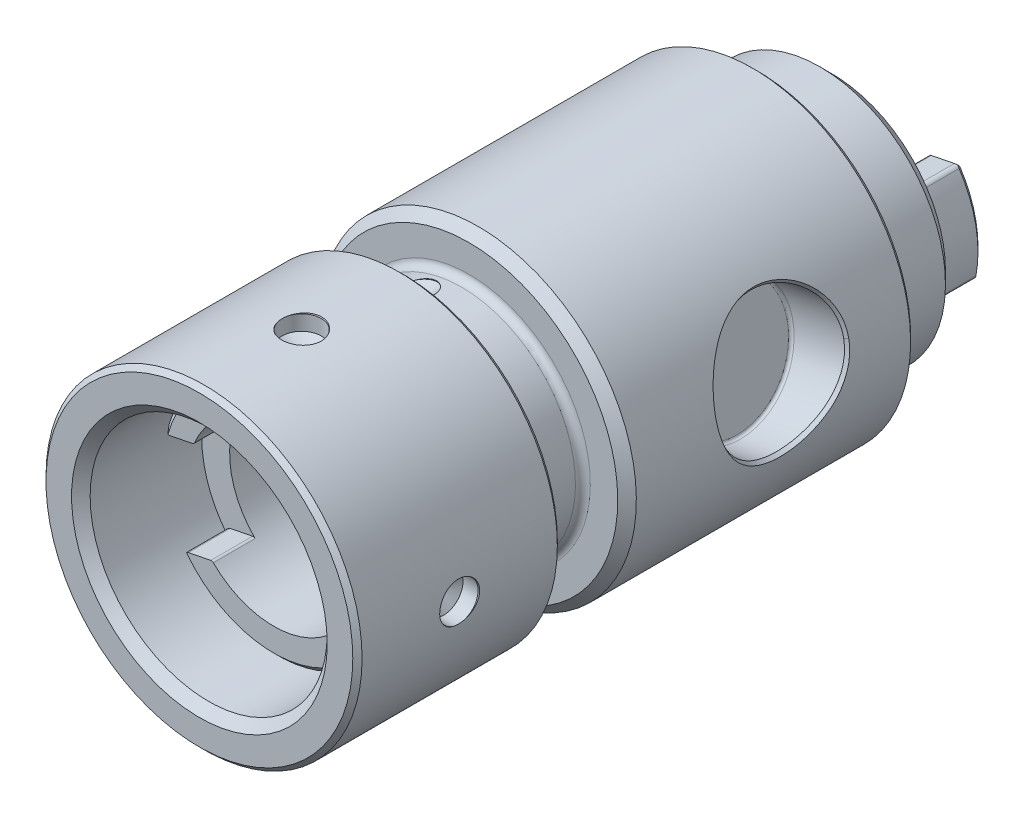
ISO-10303-21;
HEADER;
FILE_DESCRIPTION(('STEP AP214'),'2;1');
FILE_NAME('part.step','',(''),(''),'','','');
FILE_SCHEMA(('AUTOMOTIVE_DESIGN { 1 0 10303 214 1 1 1 1 }'));
ENDSEC;
DATA;
#1=APPLICATION_CONTEXT('core data for automotive mechanical design processes');
#2=APPLICATION_PROTOCOL_DEFINITION('international standard','automotive_design',2000,#1);
#3=PRODUCT_CONTEXT('',#1,'mechanical');
#4=PRODUCT('Part','Part','',(#3));
#5=PRODUCT_RELATED_PRODUCT_CATEGORY('part','',(#4));
#6=PRODUCT_DEFINITION_FORMATION('','',#4);
#7=PRODUCT_DEFINITION_CONTEXT('part definition',#1,'design');
#8=PRODUCT_DEFINITION('design','',#6,#7);
#9=PRODUCT_DEFINITION_SHAPE('','',#8);
#10=(LENGTH_UNIT() NAMED_UNIT(*) SI_UNIT(.MILLI.,.METRE.));
#11=(NAMED_UNIT(*) PLANE_ANGLE_UNIT() SI_UNIT($,.RADIAN.));
#12=(NAMED_UNIT(*) SI_UNIT($,.STERADIAN.) SOLID_ANGLE_UNIT());
#13=UNCERTAINTY_MEASURE_WITH_UNIT(LENGTH_MEASURE(1.E-05),#10,'distance_accuracy_value','');
#14=(GEOMETRIC_REPRESENTATION_CONTEXT(3) GLOBAL_UNCERTAINTY_ASSIGNED_CONTEXT((#13)) GLOBAL_UNIT_ASSIGNED_CONTEXT((#10,
#11,#12)) REPRESENTATION_CONTEXT('',''));
#15=CARTESIAN_POINT('',(0.,0.,0.));
#16=DIRECTION('',(0.,0.,1.));
#17=DIRECTION('',(1.,0.,0.));
#18=AXIS2_PLACEMENT_3D('',#15,#16,#17);
#19=CARTESIAN_POINT('',(0.,0.,0.));
#20=DIRECTION('',(0.,0.,-1.));
#21=DIRECTION('',(-1.,0.,0.));
#22=AXIS2_PLACEMENT_3D('',#19,#20,#21);
#23=CYLINDRICAL_SURFACE('',#22,12.75);
#24=CARTESIAN_POINT('',(0.,0.,-21.));
#25=DIRECTION('',(0.,0.,1.));
#26=DIRECTION('',(1.,0.,0.));
#27=AXIS2_PLACEMENT_3D('',#24,#25,#26);
#28=CIRCLE('',#27,12.75);
#29=CARTESIAN_POINT('',(12.75,0.,-21.));
#30=VERTEX_POINT('',#29);
#31=EDGE_CURVE('E621',#30,#30,#28,.F.);
#32=ORIENTED_EDGE('',*,*,#31,.T.);
#33=EDGE_LOOP('',(#32));
#34=FACE_BOUND('',#33,.T.);
#35=CARTESIAN_POINT('',(0.,0.,-20.));
#36=DIRECTION('',(0.,0.,1.));
#37=DIRECTION('',(1.,0.,0.));
#38=AXIS2_PLACEMENT_3D('',#35,#36,#37);
#39=CIRCLE('',#38,12.75);
#40=CARTESIAN_POINT('',(12.75,0.,-20.));
#41=VERTEX_POINT('',#40);
#42=EDGE_CURVE('E9',#41,#41,#39,.F.);
#43=ORIENTED_EDGE('',*,*,#42,.F.);
#44=EDGE_LOOP('',(#43));
#45=FACE_BOUND('',#44,.T.);
#46=ADVANCED_FACE('F14',(#34,#45),#23,.F.);
#47=CARTESIAN_POINT('',(0.,0.,-1.));
#48=DIRECTION('',(0.,0.,1.));
#49=DIRECTION('',(1.,0.,0.));
#50=AXIS2_PLACEMENT_3D('',#47,#48,#49);
#51=CIRCLE('',#50,12.75);
#52=CARTESIAN_POINT('',(12.75,0.,-1.));
#53=VERTEX_POINT('',#52);
#54=EDGE_CURVE('E618',#53,#53,#51,.T.);
#55=ORIENTED_EDGE('',*,*,#54,.T.);
#56=EDGE_LOOP('',(#55));
#57=FACE_BOUND('',#56,.T.);
#58=CARTESIAN_POINT('',(0.,0.,-13.5));
#59=DIRECTION('',(0.,0.,-1.));
#60=DIRECTION('',(-1.,0.,0.));
#61=AXIS2_PLACEMENT_3D('',#58,#59,#60);
#62=CIRCLE('',#61,12.75);
#63=CARTESIAN_POINT('',(-12.75,0.,-13.5));
#64=VERTEX_POINT('',#63);
#65=EDGE_CURVE('E24',#64,#64,#62,.F.);
#66=ORIENTED_EDGE('',*,*,#65,.F.);
#67=EDGE_LOOP('',(#66));
#68=FACE_BOUND('',#67,.T.);
#69=ADVANCED_FACE('F1724',(#57,#68),#23,.F.);
#70=CARTESIAN_POINT('',(0.,0.,0.));
#71=DIRECTION('',(0.,0.,1.));
#72=DIRECTION('',(1.,0.,0.));
#73=AXIS2_PLACEMENT_3D('',#70,#71,#72);
#74=PLANE('',#73);
#75=CARTESIAN_POINT('',(0.,0.,0.));
#76=DIRECTION('',(0.,0.,1.));
#77=DIRECTION('',(1.,0.,0.));
#78=AXIS2_PLACEMENT_3D('',#75,#76,#77);
#79=CIRCLE('',#78,13.75);
#80=CARTESIAN_POINT('',(13.75,0.,0.));
#81=VERTEX_POINT('',#80);
#82=EDGE_CURVE('E623',#81,#81,#79,.F.);
#83=ORIENTED_EDGE('',*,*,#82,.T.);
#84=EDGE_LOOP('',(#83));
#85=FACE_BOUND('',#84,.T.);
#86=CARTESIAN_POINT('',(0.,0.,0.));
#87=DIRECTION('',(0.,0.,1.));
#88=DIRECTION('',(1.,0.,0.));
#89=AXIS2_PLACEMENT_3D('',#86,#87,#88);
#90=CIRCLE('',#89,16.5);
#91=CARTESIAN_POINT('',(16.5,0.,0.));
#92=VERTEX_POINT('',#91);
#93=EDGE_CURVE('E598',#92,#92,#90,.T.);
#94=ORIENTED_EDGE('',*,*,#93,.T.);
#95=EDGE_LOOP('',(#94));
#96=FACE_BOUND('',#95,.T.);
#97=ADVANCED_FACE('F1731',(#85,#96),#74,.T.);
#98=CARTESIAN_POINT('',(0.,0.,-22.));
#99=DIRECTION('',(0.,0.,1.));
#100=DIRECTION('',(1.,0.,0.));
#101=AXIS2_PLACEMENT_3D('',#98,#99,#100);
#102=PLANE('',#101);
#103=CARTESIAN_POINT('',(0.,0.,-22.));
#104=DIRECTION('',(0.,0.,1.));
#105=DIRECTION('',(1.,0.,0.));
#106=AXIS2_PLACEMENT_3D('',#103,#104,#105);
#107=CIRCLE('',#106,13.75);
#108=CARTESIAN_POINT('',(13.75,0.,-22.));
#109=VERTEX_POINT('',#108);
#110=EDGE_CURVE('E615',#109,#109,#107,.T.);
#111=ORIENTED_EDGE('',*,*,#110,.T.);
#112=EDGE_LOOP('',(#111));
#113=FACE_BOUND('',#112,.T.);
#114=CARTESIAN_POINT('',(0.,0.,-22.));
#115=DIRECTION('',(0.,0.,1.));
#116=DIRECTION('',(1.,0.,0.));
#117=AXIS2_PLACEMENT_3D('',#114,#115,#116);
#118=CIRCLE('',#117,16.5);
#119=CARTESIAN_POINT('',(16.5,0.,-22.));
#120=VERTEX_POINT('',#119);
#121=EDGE_CURVE('E612',#120,#120,#118,.F.);
#122=ORIENTED_EDGE('',*,*,#121,.T.);
#123=EDGE_LOOP('',(#122));
#124=FACE_BOUND('',#123,.T.);
#125=ADVANCED_FACE('F1735',(#113,#124),#102,.F.);
#126=CARTESIAN_POINT('',(0.,0.,0.));
#127=DIRECTION('',(0.,0.,-1.));
#128=DIRECTION('',(-1.,0.,0.));
#129=AXIS2_PLACEMENT_3D('',#126,#127,#128);
#130=CYLINDRICAL_SURFACE('',#129,17.);
#131=CARTESIAN_POINT('',(0.,0.,-0.5));
#132=DIRECTION('',(0.,0.,1.));
#133=DIRECTION('',(1.,0.,0.));
#134=AXIS2_PLACEMENT_3D('',#131,#132,#133);
#135=CIRCLE('',#134,17.);
#136=CARTESIAN_POINT('',(17.,0.,-0.5));
#137=VERTEX_POINT('',#136);
#138=EDGE_CURVE('E609',#137,#137,#135,.F.);
#139=ORIENTED_EDGE('',*,*,#138,.T.);
#140=EDGE_LOOP('',(#139));
#141=FACE_BOUND('',#140,.T.);
#142=CARTESIAN_POINT('',(0.,0.,-21.5));
#143=DIRECTION('',(0.,0.,1.));
#144=DIRECTION('',(1.,0.,0.));
#145=AXIS2_PLACEMENT_3D('',#142,#143,#144);
#146=CIRCLE('',#145,17.);
#147=CARTESIAN_POINT('',(17.,0.,-21.5));
#148=VERTEX_POINT('',#147);
#149=EDGE_CURVE('E606',#148,#148,#146,.T.);
#150=ORIENTED_EDGE('',*,*,#149,.T.);
#151=EDGE_LOOP('',(#150));
#152=FACE_BOUND('',#151,.T.);
#153=CARTESIAN_POINT('',(-16.8792893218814,2.02227396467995,-11.5660459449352));
#154=CARTESIAN_POINT('',(-16.8773718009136,2.03826038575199,-11.5089571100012));
#155=CARTESIAN_POINT('',(-16.8757264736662,2.05181891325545,-11.4511796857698));
#156=CARTESIAN_POINT('',(-16.8730148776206,2.07400915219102,-11.3346592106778));
#157=CARTESIAN_POINT('',(-16.8719487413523,2.08263973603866,-11.275915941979));
#158=CARTESIAN_POINT('',(-16.870448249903,2.09475724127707,-11.159234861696));
#159=CARTESIAN_POINT('',(-16.8700001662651,2.09835595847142,-11.1013088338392));
#160=CARTESIAN_POINT('',(-16.8697021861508,2.10074932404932,-10.9853792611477));
#161=CARTESIAN_POINT('',(-16.8698520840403,2.09954562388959,-10.9273757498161));
#162=CARTESIAN_POINT('',(-16.8708660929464,2.09139032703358,-10.7964252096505));
#163=CARTESIAN_POINT('',(-16.8719078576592,2.08300881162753,-10.7235645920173));
#164=CARTESIAN_POINT('',(-16.8749097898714,2.05852439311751,-10.5780770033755));
#165=CARTESIAN_POINT('',(-16.8768831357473,2.04231061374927,-10.5054689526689));
#166=CARTESIAN_POINT('',(-16.8792893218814,2.02227396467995,-10.4339540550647));
#167=B_SPLINE_CURVE_WITH_KNOTS('',3,(#153,#154,#155,#156,#157,#158,#159,#160,#161,#162,#163,
#164,#165,#166),.UNSPECIFIED.,.F.,.F.,(4,2,2,2,2,2,4),(0.,0.177893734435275,0.355828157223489,
0.529742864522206,0.703597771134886,0.923226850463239,1.14606047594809),.UNSPECIFIED.);
#168=CARTESIAN_POINT('',(-16.8792893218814,2.02227396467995,-11.5660459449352));
#169=VERTEX_POINT('',#168);
#170=CARTESIAN_POINT('',(-16.8792893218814,2.02227396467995,-10.4339540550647));
#171=VERTEX_POINT('',#170);
#172=EDGE_CURVE('E599',#169,#171,#167,.T.);
#173=ORIENTED_EDGE('',*,*,#172,.T.);
#174=CARTESIAN_POINT('',(-16.8790893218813,2.02394260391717,-10.4402604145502));
#175=CARTESIAN_POINT('',(-16.8810571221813,2.00751215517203,-10.3777633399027));
#176=CARTESIAN_POINT('',(-16.8833375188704,1.9883105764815,-10.3160069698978));
#177=CARTESIAN_POINT('',(-16.888437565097,1.94452652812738,-10.1944502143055));
#178=CARTESIAN_POINT('',(-16.891257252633,1.9199436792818,-10.1346499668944));
#179=CARTESIAN_POINT('',(-16.8973486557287,1.86556959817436,-10.0175078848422));
#180=CARTESIAN_POINT('',(-16.9006202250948,1.83578004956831,-9.9601652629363));
#181=CARTESIAN_POINT('',(-16.907508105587,1.77122130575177,-9.84840476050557));
#182=CARTESIAN_POINT('',(-16.9111243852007,1.73645256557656,-9.79398661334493));
#183=CARTESIAN_POINT('',(-16.9219149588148,1.62904198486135,-9.64149671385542));
#184=CARTESIAN_POINT('',(-16.9293913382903,1.55023417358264,-9.54767957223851));
#185=CARTESIAN_POINT('',(-16.9442980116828,1.37776340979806,-9.37504581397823));
#186=CARTESIAN_POINT('',(-16.9517283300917,1.2841092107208,-9.29622041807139));
#187=CARTESIAN_POINT('',(-16.9655382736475,1.08634017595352,-9.15731180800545));
#188=CARTESIAN_POINT('',(-16.9719349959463,0.982454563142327,-9.09690470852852));
#189=CARTESIAN_POINT('',(-16.9830923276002,0.765721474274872,-8.99489567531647));
#190=CARTESIAN_POINT('',(-16.9878528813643,0.652873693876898,-8.95329438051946));
#191=CARTESIAN_POINT('',(-16.9950630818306,0.42482444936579,-8.89125492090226));
#192=CARTESIAN_POINT('',(-16.9975735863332,0.309776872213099,-8.87025786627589));
#193=CARTESIAN_POINT('',(-17.0002175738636,0.0777747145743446,-8.84816109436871));
#194=CARTESIAN_POINT('',(-17.0003515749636,-0.039179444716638,-8.84705704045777));
#195=CARTESIAN_POINT('',(-16.9982489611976,-0.269310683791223,-8.864603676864));
#196=CARTESIAN_POINT('',(-16.9960576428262,-0.382517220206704,-8.88287689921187));
#197=CARTESIAN_POINT('',(-16.9896198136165,-0.604259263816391,-8.93797401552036));
#198=CARTESIAN_POINT('',(-16.98537319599,-0.712794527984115,-8.97479887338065));
#199=CARTESIAN_POINT('',(-16.9752671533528,-0.922719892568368,-9.06601556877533));
#200=CARTESIAN_POINT('',(-16.9694003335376,-1.02407448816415,-9.12048815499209));
#201=CARTESIAN_POINT('',(-16.9566969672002,-1.21644374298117,-9.24526416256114));
#202=CARTESIAN_POINT('',(-16.9498603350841,-1.30745748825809,-9.31556898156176));
#203=CARTESIAN_POINT('',(-16.9357699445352,-1.47894979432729,-9.47183479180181));
#204=CARTESIAN_POINT('',(-16.928510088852,-1.55911895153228,-9.55813443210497));
#205=CARTESIAN_POINT('',(-16.9145147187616,-1.70426456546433,-9.74272255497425));
#206=CARTESIAN_POINT('',(-16.9077791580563,-1.76924236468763,-9.84100997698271));
#207=CARTESIAN_POINT('',(-16.8970164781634,-1.86888426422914,-10.0221716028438));
#208=CARTESIAN_POINT('',(-16.8927268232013,-1.907081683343,-10.1031128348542));
#209=CARTESIAN_POINT('',(-16.8851205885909,-1.97325650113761,-10.268979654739));
#210=CARTESIAN_POINT('',(-16.8818026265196,-2.00124843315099,-10.3538993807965));
#211=CARTESIAN_POINT('',(-16.8790893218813,-2.02394260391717,-10.4402604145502));
#212=B_SPLINE_CURVE_WITH_KNOTS('',3,(#174,#175,#176,#177,#178,#179,#180,#181,#182,#183,#184,
#185,#186,#187,#188,#189,#190,#191,#192,#193,#194,#195,#196,#197,#198,#199,#200,#201,#202,#203,
#204,#205,#206,#207,#208,#209,#210,#211),.UNSPECIFIED.,.F.,.F.,(4,2,2,2,2,2,2,2,2,2,2,2,2,2,2,2,
2,2,4),(0.,0.193884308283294,0.387782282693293,0.581617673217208,0.775435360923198,
1.14175700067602,1.50786345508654,1.86710120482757,2.22635115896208,2.57556237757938,
2.92469746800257,3.26715424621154,3.60962881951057,3.95369308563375,4.29778773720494,
4.65023597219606,5.0026530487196,5.27081504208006,5.53859364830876),.UNSPECIFIED.);
#213=CARTESIAN_POINT('',(-16.8792893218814,-2.02227396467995,-10.4339540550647));
#214=VERTEX_POINT('',#213);
#215=EDGE_CURVE('E591',#171,#214,#212,.T.);
#216=ORIENTED_EDGE('',*,*,#215,.T.);
#217=CARTESIAN_POINT('',(-16.8792893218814,-2.02227396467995,-10.4339540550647));
#218=CARTESIAN_POINT('',(-16.8773718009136,-2.03826038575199,-10.4910428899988));
#219=CARTESIAN_POINT('',(-16.8757264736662,-2.05181891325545,-10.5488203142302));
#220=CARTESIAN_POINT('',(-16.8730148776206,-2.07400915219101,-10.6653407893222));
#221=CARTESIAN_POINT('',(-16.8719487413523,-2.08263973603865,-10.724084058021));
#222=CARTESIAN_POINT('',(-16.870448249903,-2.09475724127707,-10.840765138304));
#223=CARTESIAN_POINT('',(-16.8700001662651,-2.09835595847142,-10.8986911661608));
#224=CARTESIAN_POINT('',(-16.8697021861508,-2.10074932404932,-11.0146207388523));
#225=CARTESIAN_POINT('',(-16.8698520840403,-2.09954562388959,-11.0726242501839));
#226=CARTESIAN_POINT('',(-16.8708660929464,-2.09139032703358,-11.2035747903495));
#227=CARTESIAN_POINT('',(-16.8719078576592,-2.08300881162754,-11.2764354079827));
#228=CARTESIAN_POINT('',(-16.8749097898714,-2.05852439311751,-11.4219229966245));
#229=CARTESIAN_POINT('',(-16.8768831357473,-2.04231061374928,-11.4945310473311));
#230=CARTESIAN_POINT('',(-16.8792893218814,-2.02227396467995,-11.5660459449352));
#231=B_SPLINE_CURVE_WITH_KNOTS('',3,(#217,#218,#219,#220,#221,#222,#223,#224,#225,#226,#227,
#228,#229,#230),.UNSPECIFIED.,.F.,.F.,(4,2,2,2,2,2,4),(0.,0.177893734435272,0.355828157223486,
0.529742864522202,0.703597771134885,0.923226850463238,1.14606047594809),.UNSPECIFIED.);
#232=CARTESIAN_POINT('',(-16.8792893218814,-2.02227396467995,-11.5660459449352));
#233=VERTEX_POINT('',#232);
#234=EDGE_CURVE('E573',#214,#233,#231,.T.);
#235=ORIENTED_EDGE('',*,*,#234,.T.);
#236=CARTESIAN_POINT('',(-16.8790893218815,-2.02394260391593,-11.5597395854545));
#237=CARTESIAN_POINT('',(-16.8810571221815,-2.00751215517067,-11.6222366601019));
#238=CARTESIAN_POINT('',(-16.8833375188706,-1.98831057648,-11.6839930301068));
#239=CARTESIAN_POINT('',(-16.8884375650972,-1.94452652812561,-11.805549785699));
#240=CARTESIAN_POINT('',(-16.8912572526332,-1.91994367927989,-11.8653500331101));
#241=CARTESIAN_POINT('',(-16.8973486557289,-1.8655695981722,-11.9824921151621));
#242=CARTESIAN_POINT('',(-16.9006202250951,-1.83578004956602,-12.039834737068));
#243=CARTESIAN_POINT('',(-16.9075081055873,-1.77122130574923,-12.1515952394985));
#244=CARTESIAN_POINT('',(-16.911124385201,-1.73645256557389,-12.2060133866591));
#245=CARTESIAN_POINT('',(-16.9219149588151,-1.62904198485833,-12.3585032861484));
#246=CARTESIAN_POINT('',(-16.9293913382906,-1.55023417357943,-12.4523204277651));
#247=CARTESIAN_POINT('',(-16.9442980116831,-1.37776340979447,-12.624954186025));
#248=CARTESIAN_POINT('',(-16.9517283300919,-1.28410921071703,-12.7037795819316));
#249=CARTESIAN_POINT('',(-16.9655382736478,-1.08634017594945,-12.8426881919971));
#250=CARTESIAN_POINT('',(-16.9719349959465,-0.982454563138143,-12.9030952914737));
#251=CARTESIAN_POINT('',(-16.9830923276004,-0.765721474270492,-13.0051043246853));
#252=CARTESIAN_POINT('',(-16.9878528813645,-0.652873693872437,-13.046705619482));
#253=CARTESIAN_POINT('',(-16.9950630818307,-0.424824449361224,-13.1087450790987));
#254=CARTESIAN_POINT('',(-16.9975735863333,-0.309776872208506,-13.1297421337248));
#255=CARTESIAN_POINT('',(-17.0002175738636,-0.0777747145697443,-13.1518389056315));
#256=CARTESIAN_POINT('',(-17.0003515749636,0.0391794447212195,-13.1529429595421));
#257=CARTESIAN_POINT('',(-16.9982489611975,0.26931068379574,-13.1353963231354));
#258=CARTESIAN_POINT('',(-16.9960576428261,0.382517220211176,-13.1171231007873));
#259=CARTESIAN_POINT('',(-16.9896198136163,0.604259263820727,-13.0620259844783));
#260=CARTESIAN_POINT('',(-16.9853731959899,0.712794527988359,-13.0252011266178));
#261=CARTESIAN_POINT('',(-16.9752671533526,0.922719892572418,-12.9339844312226));
#262=CARTESIAN_POINT('',(-16.9694003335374,1.0240744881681,-12.8795118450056));
#263=CARTESIAN_POINT('',(-16.9566969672,1.21644374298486,-12.7547358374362));
#264=CARTESIAN_POINT('',(-16.9498603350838,1.30745748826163,-12.6844310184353));
#265=CARTESIAN_POINT('',(-16.9357699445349,1.47894979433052,-12.5281652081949));
#266=CARTESIAN_POINT('',(-16.9285100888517,1.55911895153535,-12.4418655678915));
#267=CARTESIAN_POINT('',(-16.9145147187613,1.70426456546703,-12.2572774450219));
#268=CARTESIAN_POINT('',(-16.907779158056,1.76924236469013,-12.1589900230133));
#269=CARTESIAN_POINT('',(-16.8970164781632,1.86888426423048,-11.9778283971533));
#270=CARTESIAN_POINT('',(-16.8927268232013,1.90708168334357,-11.8968871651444));
#271=CARTESIAN_POINT('',(-16.885120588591,1.97325650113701,-11.7310203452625));
#272=CARTESIAN_POINT('',(-16.8818026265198,2.00124843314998,-11.6461006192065));
#273=CARTESIAN_POINT('',(-16.8790893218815,2.02394260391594,-11.5597395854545));
#274=B_SPLINE_CURVE_WITH_KNOTS('',3,(#236,#237,#238,#239,#240,#241,#242,#243,#244,#245,#246,
#247,#248,#249,#250,#251,#252,#253,#254,#255,#256,#257,#258,#259,#260,#261,#262,#263,#264,#265,
#266,#267,#268,#269,#270,#271,#272,#273),.UNSPECIFIED.,.F.,.F.,(4,2,2,2,2,2,2,2,2,2,2,2,2,2,2,2,
2,2,4),(0.,0.193884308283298,0.387782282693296,0.581617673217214,0.775435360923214,
1.14175700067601,1.50786345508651,1.86710120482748,2.22635115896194,2.57556237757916,
2.92469746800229,3.26715424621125,3.60962881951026,3.95369308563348,4.29778773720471,
4.6502359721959,5.00265304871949,5.27081504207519,5.53859364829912),.UNSPECIFIED.);
#275=EDGE_CURVE('E560',#233,#169,#274,.T.);
#276=ORIENTED_EDGE('',*,*,#275,.T.);
#277=EDGE_LOOP('',(#173,#216,#235,#276));
#278=FACE_BOUND('',#277,.T.);
#279=CARTESIAN_POINT('',(2.02227396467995,16.8792893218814,-11.5660459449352));
#280=CARTESIAN_POINT('',(2.03826038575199,16.8773718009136,-11.5089571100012));
#281=CARTESIAN_POINT('',(2.05181891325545,16.8757264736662,-11.4511796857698));
#282=CARTESIAN_POINT('',(2.07400915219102,16.8730148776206,-11.3346592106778));
#283=CARTESIAN_POINT('',(2.08263973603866,16.8719487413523,-11.275915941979));
#284=CARTESIAN_POINT('',(2.09475724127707,16.870448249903,-11.159234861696));
#285=CARTESIAN_POINT('',(2.09835595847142,16.8700001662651,-11.1013088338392));
#286=CARTESIAN_POINT('',(2.10074932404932,16.8697021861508,-10.9853792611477));
#287=CARTESIAN_POINT('',(2.09954562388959,16.8698520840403,-10.9273757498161));
#288=CARTESIAN_POINT('',(2.09139032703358,16.8708660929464,-10.7964252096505));
#289=CARTESIAN_POINT('',(2.08300881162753,16.8719078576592,-10.7235645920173));
#290=CARTESIAN_POINT('',(2.05852439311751,16.8749097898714,-10.5780770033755));
#291=CARTESIAN_POINT('',(2.04231061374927,16.8768831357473,-10.5054689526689));
#292=CARTESIAN_POINT('',(2.02227396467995,16.8792893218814,-10.4339540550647));
#293=B_SPLINE_CURVE_WITH_KNOTS('',3,(#279,#280,#281,#282,#283,#284,#285,#286,#287,#288,#289,
#290,#291,#292),.UNSPECIFIED.,.F.,.F.,(4,2,2,2,2,2,4),(0.,0.177893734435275,0.355828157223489,
0.529742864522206,0.703597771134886,0.923226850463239,1.14606047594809),.UNSPECIFIED.);
#294=CARTESIAN_POINT('',(2.02227396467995,16.8792893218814,-11.5660459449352));
#295=VERTEX_POINT('',#294);
#296=CARTESIAN_POINT('',(2.02227396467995,16.8792893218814,-10.4339540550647));
#297=VERTEX_POINT('',#296);
#298=EDGE_CURVE('E561',#295,#297,#293,.T.);
#299=ORIENTED_EDGE('',*,*,#298,.T.);
#300=CARTESIAN_POINT('',(2.02394260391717,16.8790893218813,-10.4402604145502));
#301=CARTESIAN_POINT('',(2.00751215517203,16.8810571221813,-10.3777633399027));
#302=CARTESIAN_POINT('',(1.9883105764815,16.8833375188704,-10.3160069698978));
#303=CARTESIAN_POINT('',(1.94452652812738,16.888437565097,-10.1944502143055));
#304=CARTESIAN_POINT('',(1.9199436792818,16.891257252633,-10.1346499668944));
#305=CARTESIAN_POINT('',(1.86556959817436,16.8973486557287,-10.0175078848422));
#306=CARTESIAN_POINT('',(1.83578004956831,16.9006202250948,-9.9601652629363));
#307=CARTESIAN_POINT('',(1.77122130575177,16.907508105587,-9.84840476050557));
#308=CARTESIAN_POINT('',(1.73645256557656,16.9111243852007,-9.79398661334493));
#309=CARTESIAN_POINT('',(1.62904198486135,16.9219149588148,-9.64149671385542));
#310=CARTESIAN_POINT('',(1.55023417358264,16.9293913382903,-9.54767957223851));
#311=CARTESIAN_POINT('',(1.37776340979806,16.9442980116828,-9.37504581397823));
#312=CARTESIAN_POINT('',(1.2841092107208,16.9517283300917,-9.29622041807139));
#313=CARTESIAN_POINT('',(1.08634017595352,16.9655382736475,-9.15731180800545));
#314=CARTESIAN_POINT('',(0.982454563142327,16.9719349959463,-9.09690470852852));
#315=CARTESIAN_POINT('',(0.765721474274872,16.9830923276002,-8.99489567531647));
#316=CARTESIAN_POINT('',(0.652873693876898,16.9878528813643,-8.95329438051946));
#317=CARTESIAN_POINT('',(0.42482444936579,16.9950630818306,-8.89125492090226));
#318=CARTESIAN_POINT('',(0.309776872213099,16.9975735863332,-8.87025786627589));
#319=CARTESIAN_POINT('',(0.0777747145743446,17.0002175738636,-8.84816109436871));
#320=CARTESIAN_POINT('',(-0.039179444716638,17.0003515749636,-8.84705704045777));
#321=CARTESIAN_POINT('',(-0.269310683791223,16.9982489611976,-8.864603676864));
#322=CARTESIAN_POINT('',(-0.382517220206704,16.9960576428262,-8.88287689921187));
#323=CARTESIAN_POINT('',(-0.604259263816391,16.9896198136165,-8.93797401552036));
#324=CARTESIAN_POINT('',(-0.712794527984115,16.98537319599,-8.97479887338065));
#325=CARTESIAN_POINT('',(-0.922719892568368,16.9752671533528,-9.06601556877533));
#326=CARTESIAN_POINT('',(-1.02407448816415,16.9694003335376,-9.12048815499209));
#327=CARTESIAN_POINT('',(-1.21644374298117,16.9566969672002,-9.24526416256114));
#328=CARTESIAN_POINT('',(-1.30745748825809,16.9498603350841,-9.31556898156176));
#329=CARTESIAN_POINT('',(-1.47894979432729,16.9357699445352,-9.47183479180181));
#330=CARTESIAN_POINT('',(-1.55911895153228,16.928510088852,-9.55813443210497));
#331=CARTESIAN_POINT('',(-1.70426456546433,16.9145147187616,-9.74272255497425));
#332=CARTESIAN_POINT('',(-1.76924236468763,16.9077791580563,-9.84100997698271));
#333=CARTESIAN_POINT('',(-1.86888426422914,16.8970164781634,-10.0221716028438));
#334=CARTESIAN_POINT('',(-1.907081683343,16.8927268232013,-10.1031128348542));
#335=CARTESIAN_POINT('',(-1.97325650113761,16.8851205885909,-10.268979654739));
#336=CARTESIAN_POINT('',(-2.00124843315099,16.8818026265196,-10.3538993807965));
#337=CARTESIAN_POINT('',(-2.02394260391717,16.8790893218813,-10.4402604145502));
#338=B_SPLINE_CURVE_WITH_KNOTS('',3,(#300,#301,#302,#303,#304,#305,#306,#307,#308,#309,#310,
#311,#312,#313,#314,#315,#316,#317,#318,#319,#320,#321,#322,#323,#324,#325,#326,#327,#328,#329,
#330,#331,#332,#333,#334,#335,#336,#337),.UNSPECIFIED.,.F.,.F.,(4,2,2,2,2,2,2,2,2,2,2,2,2,2,2,2,
2,2,4),(0.,0.193884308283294,0.387782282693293,0.581617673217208,0.775435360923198,
1.14175700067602,1.50786345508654,1.86710120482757,2.22635115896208,2.57556237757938,
2.92469746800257,3.26715424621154,3.60962881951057,3.95369308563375,4.29778773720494,
4.65023597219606,5.0026530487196,5.27081504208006,5.53859364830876),.UNSPECIFIED.);
#339=CARTESIAN_POINT('',(-2.02227396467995,16.8792893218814,-10.4339540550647));
#340=VERTEX_POINT('',#339);
#341=EDGE_CURVE('E553',#297,#340,#338,.T.);
#342=ORIENTED_EDGE('',*,*,#341,.T.);
#343=CARTESIAN_POINT('',(-2.02227396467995,16.8792893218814,-10.4339540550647));
#344=CARTESIAN_POINT('',(-2.03826038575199,16.8773718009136,-10.4910428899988));
#345=CARTESIAN_POINT('',(-2.05181891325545,16.8757264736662,-10.5488203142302));
#346=CARTESIAN_POINT('',(-2.07400915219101,16.8730148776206,-10.6653407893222));
#347=CARTESIAN_POINT('',(-2.08263973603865,16.8719487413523,-10.724084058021));
#348=CARTESIAN_POINT('',(-2.09475724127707,16.870448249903,-10.840765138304));
#349=CARTESIAN_POINT('',(-2.09835595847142,16.8700001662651,-10.8986911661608));
#350=CARTESIAN_POINT('',(-2.10074932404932,16.8697021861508,-11.0146207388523));
#351=CARTESIAN_POINT('',(-2.09954562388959,16.8698520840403,-11.0726242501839));
#352=CARTESIAN_POINT('',(-2.09139032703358,16.8708660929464,-11.2035747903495));
#353=CARTESIAN_POINT('',(-2.08300881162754,16.8719078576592,-11.2764354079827));
#354=CARTESIAN_POINT('',(-2.05852439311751,16.8749097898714,-11.4219229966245));
#355=CARTESIAN_POINT('',(-2.04231061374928,16.8768831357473,-11.4945310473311));
#356=CARTESIAN_POINT('',(-2.02227396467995,16.8792893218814,-11.5660459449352));
#357=B_SPLINE_CURVE_WITH_KNOTS('',3,(#343,#344,#345,#346,#347,#348,#349,#350,#351,#352,#353,
#354,#355,#356),.UNSPECIFIED.,.F.,.F.,(4,2,2,2,2,2,4),(0.,0.177893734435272,0.355828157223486,
0.529742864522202,0.703597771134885,0.923226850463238,1.14606047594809),.UNSPECIFIED.);
#358=CARTESIAN_POINT('',(-2.02227396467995,16.8792893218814,-11.5660459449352));
#359=VERTEX_POINT('',#358);
#360=EDGE_CURVE('E535',#340,#359,#357,.T.);
#361=ORIENTED_EDGE('',*,*,#360,.T.);
#362=CARTESIAN_POINT('',(-2.02394260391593,16.8790893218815,-11.5597395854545));
#363=CARTESIAN_POINT('',(-2.00751215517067,16.8810571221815,-11.6222366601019));
#364=CARTESIAN_POINT('',(-1.98831057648,16.8833375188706,-11.6839930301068));
#365=CARTESIAN_POINT('',(-1.94452652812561,16.8884375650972,-11.805549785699));
#366=CARTESIAN_POINT('',(-1.91994367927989,16.8912572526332,-11.8653500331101));
#367=CARTESIAN_POINT('',(-1.8655695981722,16.8973486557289,-11.9824921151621));
#368=CARTESIAN_POINT('',(-1.83578004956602,16.9006202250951,-12.039834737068));
#369=CARTESIAN_POINT('',(-1.77122130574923,16.9075081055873,-12.1515952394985));
#370=CARTESIAN_POINT('',(-1.73645256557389,16.911124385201,-12.2060133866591));
#371=CARTESIAN_POINT('',(-1.62904198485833,16.9219149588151,-12.3585032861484));
#372=CARTESIAN_POINT('',(-1.55023417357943,16.9293913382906,-12.4523204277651));
#373=CARTESIAN_POINT('',(-1.37776340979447,16.9442980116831,-12.624954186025));
#374=CARTESIAN_POINT('',(-1.28410921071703,16.9517283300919,-12.7037795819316));
#375=CARTESIAN_POINT('',(-1.08634017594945,16.9655382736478,-12.8426881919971));
#376=CARTESIAN_POINT('',(-0.982454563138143,16.9719349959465,-12.9030952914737));
#377=CARTESIAN_POINT('',(-0.765721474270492,16.9830923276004,-13.0051043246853));
#378=CARTESIAN_POINT('',(-0.652873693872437,16.9878528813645,-13.046705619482));
#379=CARTESIAN_POINT('',(-0.424824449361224,16.9950630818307,-13.1087450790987));
#380=CARTESIAN_POINT('',(-0.309776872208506,16.9975735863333,-13.1297421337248));
#381=CARTESIAN_POINT('',(-0.0777747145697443,17.0002175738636,-13.1518389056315));
#382=CARTESIAN_POINT('',(0.0391794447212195,17.0003515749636,-13.1529429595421));
#383=CARTESIAN_POINT('',(0.26931068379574,16.9982489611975,-13.1353963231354));
#384=CARTESIAN_POINT('',(0.382517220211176,16.9960576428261,-13.1171231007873));
#385=CARTESIAN_POINT('',(0.604259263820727,16.9896198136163,-13.0620259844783));
#386=CARTESIAN_POINT('',(0.712794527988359,16.9853731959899,-13.0252011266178));
#387=CARTESIAN_POINT('',(0.922719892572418,16.9752671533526,-12.9339844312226));
#388=CARTESIAN_POINT('',(1.0240744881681,16.9694003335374,-12.8795118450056));
#389=CARTESIAN_POINT('',(1.21644374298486,16.9566969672,-12.7547358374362));
#390=CARTESIAN_POINT('',(1.30745748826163,16.9498603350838,-12.6844310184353));
#391=CARTESIAN_POINT('',(1.47894979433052,16.9357699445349,-12.5281652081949));
#392=CARTESIAN_POINT('',(1.55911895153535,16.9285100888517,-12.4418655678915));
#393=CARTESIAN_POINT('',(1.70426456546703,16.9145147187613,-12.2572774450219));
#394=CARTESIAN_POINT('',(1.76924236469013,16.907779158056,-12.1589900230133));
#395=CARTESIAN_POINT('',(1.86888426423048,16.8970164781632,-11.9778283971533));
#396=CARTESIAN_POINT('',(1.90708168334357,16.8927268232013,-11.8968871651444));
#397=CARTESIAN_POINT('',(1.97325650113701,16.885120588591,-11.7310203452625));
#398=CARTESIAN_POINT('',(2.00124843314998,16.8818026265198,-11.6461006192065));
#399=CARTESIAN_POINT('',(2.02394260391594,16.8790893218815,-11.5597395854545));
#400=B_SPLINE_CURVE_WITH_KNOTS('',3,(#362,#363,#364,#365,#366,#367,#368,#369,#370,#371,#372,
#373,#374,#375,#376,#377,#378,#379,#380,#381,#382,#383,#384,#385,#386,#387,#388,#389,#390,#391,
#392,#393,#394,#395,#396,#397,#398,#399),.UNSPECIFIED.,.F.,.F.,(4,2,2,2,2,2,2,2,2,2,2,2,2,2,2,2,
2,2,4),(0.,0.193884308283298,0.387782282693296,0.581617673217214,0.775435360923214,
1.14175700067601,1.50786345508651,1.86710120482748,2.22635115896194,2.57556237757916,
2.92469746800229,3.26715424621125,3.60962881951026,3.95369308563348,4.29778773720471,
4.6502359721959,5.00265304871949,5.27081504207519,5.53859364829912),.UNSPECIFIED.);
#401=EDGE_CURVE('E522',#359,#295,#400,.T.);
#402=ORIENTED_EDGE('',*,*,#401,.T.);
#403=EDGE_LOOP('',(#299,#342,#361,#402));
#404=FACE_BOUND('',#403,.T.);
#405=CARTESIAN_POINT('',(2.02227396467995,-16.8792893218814,-10.4339540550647));
#406=CARTESIAN_POINT('',(2.03826038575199,-16.8773718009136,-10.4910428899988));
#407=CARTESIAN_POINT('',(2.05181891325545,-16.8757264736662,-10.5488203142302));
#408=CARTESIAN_POINT('',(2.07400915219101,-16.8730148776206,-10.6653407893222));
#409=CARTESIAN_POINT('',(2.08263973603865,-16.8719487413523,-10.724084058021));
#410=CARTESIAN_POINT('',(2.09475724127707,-16.870448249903,-10.840765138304));
#411=CARTESIAN_POINT('',(2.09835595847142,-16.8700001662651,-10.8986911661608));
#412=CARTESIAN_POINT('',(2.10074932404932,-16.8697021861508,-11.0146207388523));
#413=CARTESIAN_POINT('',(2.09954562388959,-16.8698520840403,-11.0726242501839));
#414=CARTESIAN_POINT('',(2.09139032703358,-16.8708660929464,-11.2035747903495));
#415=CARTESIAN_POINT('',(2.08300881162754,-16.8719078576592,-11.2764354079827));
#416=CARTESIAN_POINT('',(2.05852439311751,-16.8749097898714,-11.4219229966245));
#417=CARTESIAN_POINT('',(2.04231061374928,-16.8768831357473,-11.4945310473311));
#418=CARTESIAN_POINT('',(2.02227396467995,-16.8792893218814,-11.5660459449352));
#419=B_SPLINE_CURVE_WITH_KNOTS('',3,(#405,#406,#407,#408,#409,#410,#411,#412,#413,#414,#415,
#416,#417,#418),.UNSPECIFIED.,.F.,.F.,(4,2,2,2,2,2,4),(0.,0.177893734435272,0.355828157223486,
0.529742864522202,0.703597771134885,0.923226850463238,1.14606047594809),.UNSPECIFIED.);
#420=CARTESIAN_POINT('',(2.02227396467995,-16.8792893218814,-10.4339540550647));
#421=VERTEX_POINT('',#420);
#422=CARTESIAN_POINT('',(2.02227396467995,-16.8792893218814,-11.5660459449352));
#423=VERTEX_POINT('',#422);
#424=EDGE_CURVE('E497',#421,#423,#419,.T.);
#425=ORIENTED_EDGE('',*,*,#424,.T.);
#426=CARTESIAN_POINT('',(2.02394260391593,-16.8790893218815,-11.5597395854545));
#427=CARTESIAN_POINT('',(2.00751215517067,-16.8810571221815,-11.6222366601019));
#428=CARTESIAN_POINT('',(1.98831057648,-16.8833375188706,-11.6839930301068));
#429=CARTESIAN_POINT('',(1.94452652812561,-16.8884375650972,-11.805549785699));
#430=CARTESIAN_POINT('',(1.91994367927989,-16.8912572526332,-11.8653500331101));
#431=CARTESIAN_POINT('',(1.8655695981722,-16.8973486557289,-11.9824921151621));
#432=CARTESIAN_POINT('',(1.83578004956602,-16.9006202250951,-12.039834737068));
#433=CARTESIAN_POINT('',(1.77122130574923,-16.9075081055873,-12.1515952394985));
#434=CARTESIAN_POINT('',(1.73645256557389,-16.911124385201,-12.2060133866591));
#435=CARTESIAN_POINT('',(1.62904198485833,-16.9219149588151,-12.3585032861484));
#436=CARTESIAN_POINT('',(1.55023417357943,-16.9293913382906,-12.4523204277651));
#437=CARTESIAN_POINT('',(1.37776340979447,-16.9442980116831,-12.624954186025));
#438=CARTESIAN_POINT('',(1.28410921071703,-16.9517283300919,-12.7037795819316));
#439=CARTESIAN_POINT('',(1.08634017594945,-16.9655382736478,-12.8426881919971));
#440=CARTESIAN_POINT('',(0.982454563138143,-16.9719349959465,-12.9030952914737));
#441=CARTESIAN_POINT('',(0.765721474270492,-16.9830923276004,-13.0051043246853));
#442=CARTESIAN_POINT('',(0.652873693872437,-16.9878528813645,-13.046705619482));
#443=CARTESIAN_POINT('',(0.424824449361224,-16.9950630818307,-13.1087450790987));
#444=CARTESIAN_POINT('',(0.309776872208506,-16.9975735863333,-13.1297421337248));
#445=CARTESIAN_POINT('',(0.0777747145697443,-17.0002175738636,-13.1518389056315));
#446=CARTESIAN_POINT('',(-0.0391794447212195,-17.0003515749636,-13.1529429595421));
#447=CARTESIAN_POINT('',(-0.26931068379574,-16.9982489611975,-13.1353963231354));
#448=CARTESIAN_POINT('',(-0.382517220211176,-16.9960576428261,-13.1171231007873));
#449=CARTESIAN_POINT('',(-0.604259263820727,-16.9896198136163,-13.0620259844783));
#450=CARTESIAN_POINT('',(-0.712794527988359,-16.9853731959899,-13.0252011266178));
#451=CARTESIAN_POINT('',(-0.922719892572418,-16.9752671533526,-12.9339844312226));
#452=CARTESIAN_POINT('',(-1.0240744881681,-16.9694003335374,-12.8795118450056));
#453=CARTESIAN_POINT('',(-1.21644374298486,-16.9566969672,-12.7547358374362));
#454=CARTESIAN_POINT('',(-1.30745748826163,-16.9498603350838,-12.6844310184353));
#455=CARTESIAN_POINT('',(-1.47894979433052,-16.9357699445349,-12.5281652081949));
#456=CARTESIAN_POINT('',(-1.55911895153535,-16.9285100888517,-12.4418655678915));
#457=CARTESIAN_POINT('',(-1.70426456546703,-16.9145147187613,-12.2572774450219));
#458=CARTESIAN_POINT('',(-1.76924236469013,-16.907779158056,-12.1589900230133));
#459=CARTESIAN_POINT('',(-1.86888426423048,-16.8970164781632,-11.9778283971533));
#460=CARTESIAN_POINT('',(-1.90708168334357,-16.8927268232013,-11.8968871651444));
#461=CARTESIAN_POINT('',(-1.97325650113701,-16.885120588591,-11.7310203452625));
#462=CARTESIAN_POINT('',(-2.00124843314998,-16.8818026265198,-11.6461006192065));
#463=CARTESIAN_POINT('',(-2.02394260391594,-16.8790893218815,-11.5597395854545));
#464=B_SPLINE_CURVE_WITH_KNOTS('',3,(#426,#427,#428,#429,#430,#431,#432,#433,#434,#435,#436,
#437,#438,#439,#440,#441,#442,#443,#444,#445,#446,#447,#448,#449,#450,#451,#452,#453,#454,#455,
#456,#457,#458,#459,#460,#461,#462,#463),.UNSPECIFIED.,.F.,.F.,(4,2,2,2,2,2,2,2,2,2,2,2,2,2,2,2,
2,2,4),(0.,0.193884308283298,0.387782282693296,0.581617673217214,0.775435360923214,
1.14175700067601,1.50786345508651,1.86710120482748,2.22635115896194,2.57556237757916,
2.92469746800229,3.26715424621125,3.60962881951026,3.95369308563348,4.29778773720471,
4.6502359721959,5.00265304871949,5.27081504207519,5.53859364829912),.UNSPECIFIED.);
#465=CARTESIAN_POINT('',(-2.02227396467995,-16.8792893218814,-11.5660459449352));
#466=VERTEX_POINT('',#465);
#467=EDGE_CURVE('E515',#423,#466,#464,.T.);
#468=ORIENTED_EDGE('',*,*,#467,.T.);
#469=CARTESIAN_POINT('',(-2.02227396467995,-16.8792893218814,-11.5660459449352));
#470=CARTESIAN_POINT('',(-2.03826038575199,-16.8773718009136,-11.5089571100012));
#471=CARTESIAN_POINT('',(-2.05181891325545,-16.8757264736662,-11.4511796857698));
#472=CARTESIAN_POINT('',(-2.07400915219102,-16.8730148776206,-11.3346592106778));
#473=CARTESIAN_POINT('',(-2.08263973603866,-16.8719487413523,-11.275915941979));
#474=CARTESIAN_POINT('',(-2.09475724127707,-16.870448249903,-11.159234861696));
#475=CARTESIAN_POINT('',(-2.09835595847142,-16.8700001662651,-11.1013088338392));
#476=CARTESIAN_POINT('',(-2.10074932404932,-16.8697021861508,-10.9853792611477));
#477=CARTESIAN_POINT('',(-2.09954562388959,-16.8698520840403,-10.9273757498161));
#478=CARTESIAN_POINT('',(-2.09139032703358,-16.8708660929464,-10.7964252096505));
#479=CARTESIAN_POINT('',(-2.08300881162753,-16.8719078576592,-10.7235645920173));
#480=CARTESIAN_POINT('',(-2.05852439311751,-16.8749097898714,-10.5780770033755));
#481=CARTESIAN_POINT('',(-2.04231061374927,-16.8768831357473,-10.5054689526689));
#482=CARTESIAN_POINT('',(-2.02227396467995,-16.8792893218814,-10.4339540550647));
#483=B_SPLINE_CURVE_WITH_KNOTS('',3,(#469,#470,#471,#472,#473,#474,#475,#476,#477,#478,#479,
#480,#481,#482),.UNSPECIFIED.,.F.,.F.,(4,2,2,2,2,2,4),(0.,0.177893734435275,0.355828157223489,
0.529742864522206,0.703597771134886,0.923226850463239,1.14606047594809),.UNSPECIFIED.);
#484=CARTESIAN_POINT('',(-2.02227396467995,-16.8792893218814,-10.4339540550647));
#485=VERTEX_POINT('',#484);
#486=EDGE_CURVE('E523',#466,#485,#483,.T.);
#487=ORIENTED_EDGE('',*,*,#486,.T.);
#488=CARTESIAN_POINT('',(-2.02394260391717,-16.8790893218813,-10.4402604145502));
#489=CARTESIAN_POINT('',(-2.00751215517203,-16.8810571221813,-10.3777633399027));
#490=CARTESIAN_POINT('',(-1.9883105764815,-16.8833375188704,-10.3160069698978));
#491=CARTESIAN_POINT('',(-1.94452652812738,-16.888437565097,-10.1944502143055));
#492=CARTESIAN_POINT('',(-1.9199436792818,-16.891257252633,-10.1346499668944));
#493=CARTESIAN_POINT('',(-1.86556959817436,-16.8973486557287,-10.0175078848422));
#494=CARTESIAN_POINT('',(-1.83578004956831,-16.9006202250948,-9.9601652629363));
#495=CARTESIAN_POINT('',(-1.77122130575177,-16.907508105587,-9.84840476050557));
#496=CARTESIAN_POINT('',(-1.73645256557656,-16.9111243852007,-9.79398661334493));
#497=CARTESIAN_POINT('',(-1.62904198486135,-16.9219149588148,-9.64149671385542));
#498=CARTESIAN_POINT('',(-1.55023417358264,-16.9293913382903,-9.54767957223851));
#499=CARTESIAN_POINT('',(-1.37776340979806,-16.9442980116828,-9.37504581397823));
#500=CARTESIAN_POINT('',(-1.2841092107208,-16.9517283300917,-9.29622041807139));
#501=CARTESIAN_POINT('',(-1.08634017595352,-16.9655382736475,-9.15731180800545));
#502=CARTESIAN_POINT('',(-0.982454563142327,-16.9719349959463,-9.09690470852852));
#503=CARTESIAN_POINT('',(-0.765721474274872,-16.9830923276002,-8.99489567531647));
#504=CARTESIAN_POINT('',(-0.652873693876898,-16.9878528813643,-8.95329438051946));
#505=CARTESIAN_POINT('',(-0.42482444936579,-16.9950630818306,-8.89125492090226));
#506=CARTESIAN_POINT('',(-0.309776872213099,-16.9975735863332,-8.87025786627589));
#507=CARTESIAN_POINT('',(-0.0777747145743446,-17.0002175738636,-8.84816109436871));
#508=CARTESIAN_POINT('',(0.039179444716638,-17.0003515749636,-8.84705704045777));
#509=CARTESIAN_POINT('',(0.269310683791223,-16.9982489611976,-8.864603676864));
#510=CARTESIAN_POINT('',(0.382517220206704,-16.9960576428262,-8.88287689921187));
#511=CARTESIAN_POINT('',(0.604259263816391,-16.9896198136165,-8.93797401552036));
#512=CARTESIAN_POINT('',(0.712794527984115,-16.98537319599,-8.97479887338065));
#513=CARTESIAN_POINT('',(0.922719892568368,-16.9752671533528,-9.06601556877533));
#514=CARTESIAN_POINT('',(1.02407448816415,-16.9694003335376,-9.12048815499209));
#515=CARTESIAN_POINT('',(1.21644374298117,-16.9566969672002,-9.24526416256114));
#516=CARTESIAN_POINT('',(1.30745748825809,-16.9498603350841,-9.31556898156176));
#517=CARTESIAN_POINT('',(1.47894979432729,-16.9357699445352,-9.47183479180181));
#518=CARTESIAN_POINT('',(1.55911895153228,-16.928510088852,-9.55813443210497));
#519=CARTESIAN_POINT('',(1.70426456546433,-16.9145147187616,-9.74272255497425));
#520=CARTESIAN_POINT('',(1.76924236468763,-16.9077791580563,-9.84100997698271));
#521=CARTESIAN_POINT('',(1.86888426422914,-16.8970164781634,-10.0221716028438));
#522=CARTESIAN_POINT('',(1.907081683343,-16.8927268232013,-10.1031128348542));
#523=CARTESIAN_POINT('',(1.97325650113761,-16.8851205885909,-10.268979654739));
#524=CARTESIAN_POINT('',(2.00124843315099,-16.8818026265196,-10.3538993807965));
#525=CARTESIAN_POINT('',(2.02394260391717,-16.8790893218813,-10.4402604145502));
#526=B_SPLINE_CURVE_WITH_KNOTS('',3,(#488,#489,#490,#491,#492,#493,#494,#495,#496,#497,#498,
#499,#500,#501,#502,#503,#504,#505,#506,#507,#508,#509,#510,#511,#512,#513,#514,#515,#516,#517,
#518,#519,#520,#521,#522,#523,#524,#525),.UNSPECIFIED.,.F.,.F.,(4,2,2,2,2,2,2,2,2,2,2,2,2,2,2,2,
2,2,4),(0.,0.193884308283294,0.387782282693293,0.581617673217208,0.775435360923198,
1.14175700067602,1.50786345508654,1.86710120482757,2.22635115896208,2.57556237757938,
2.92469746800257,3.26715424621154,3.60962881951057,3.95369308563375,4.29778773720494,
4.65023597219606,5.0026530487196,5.27081504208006,5.53859364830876),.UNSPECIFIED.);
#527=EDGE_CURVE('E484',#485,#421,#526,.T.);
#528=ORIENTED_EDGE('',*,*,#527,.T.);
#529=EDGE_LOOP('',(#425,#468,#487,#528));
#530=FACE_BOUND('',#529,.T.);
#531=CARTESIAN_POINT('',(16.8792893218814,2.02227396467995,-10.4339540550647));
#532=CARTESIAN_POINT('',(16.8773718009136,2.03826038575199,-10.4910428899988));
#533=CARTESIAN_POINT('',(16.8757264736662,2.05181891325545,-10.5488203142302));
#534=CARTESIAN_POINT('',(16.8730148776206,2.07400915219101,-10.6653407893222));
#535=CARTESIAN_POINT('',(16.8719487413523,2.08263973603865,-10.724084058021));
#536=CARTESIAN_POINT('',(16.870448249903,2.09475724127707,-10.840765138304));
#537=CARTESIAN_POINT('',(16.8700001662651,2.09835595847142,-10.8986911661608));
#538=CARTESIAN_POINT('',(16.8697021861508,2.10074932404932,-11.0146207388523));
#539=CARTESIAN_POINT('',(16.8698520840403,2.09954562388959,-11.0726242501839));
#540=CARTESIAN_POINT('',(16.8708660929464,2.09139032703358,-11.2035747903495));
#541=CARTESIAN_POINT('',(16.8719078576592,2.08300881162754,-11.2764354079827));
#542=CARTESIAN_POINT('',(16.8749097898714,2.05852439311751,-11.4219229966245));
#543=CARTESIAN_POINT('',(16.8768831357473,2.04231061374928,-11.4945310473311));
#544=CARTESIAN_POINT('',(16.8792893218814,2.02227396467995,-11.5660459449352));
#545=B_SPLINE_CURVE_WITH_KNOTS('',3,(#531,#532,#533,#534,#535,#536,#537,#538,#539,#540,#541,
#542,#543,#544),.UNSPECIFIED.,.F.,.F.,(4,2,2,2,2,2,4),(0.,0.177893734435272,0.355828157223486,
0.529742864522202,0.703597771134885,0.923226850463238,1.14606047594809),.UNSPECIFIED.);
#546=CARTESIAN_POINT('',(16.8792893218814,2.02227396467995,-10.4339540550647));
#547=VERTEX_POINT('',#546);
#548=CARTESIAN_POINT('',(16.8792893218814,2.02227396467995,-11.5660459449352));
#549=VERTEX_POINT('',#548);
#550=EDGE_CURVE('E457',#547,#549,#545,.T.);
#551=ORIENTED_EDGE('',*,*,#550,.T.);
#552=CARTESIAN_POINT('',(16.8790893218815,2.02394260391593,-11.5597395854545));
#553=CARTESIAN_POINT('',(16.8810571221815,2.00751215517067,-11.6222366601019));
#554=CARTESIAN_POINT('',(16.8833375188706,1.98831057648,-11.6839930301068));
#555=CARTESIAN_POINT('',(16.8884375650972,1.94452652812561,-11.805549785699));
#556=CARTESIAN_POINT('',(16.8912572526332,1.91994367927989,-11.8653500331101));
#557=CARTESIAN_POINT('',(16.8973486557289,1.8655695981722,-11.9824921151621));
#558=CARTESIAN_POINT('',(16.9006202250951,1.83578004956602,-12.039834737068));
#559=CARTESIAN_POINT('',(16.9075081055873,1.77122130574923,-12.1515952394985));
#560=CARTESIAN_POINT('',(16.911124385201,1.73645256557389,-12.2060133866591));
#561=CARTESIAN_POINT('',(16.9219149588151,1.62904198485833,-12.3585032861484));
#562=CARTESIAN_POINT('',(16.9293913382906,1.55023417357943,-12.4523204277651));
#563=CARTESIAN_POINT('',(16.9442980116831,1.37776340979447,-12.624954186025));
#564=CARTESIAN_POINT('',(16.9517283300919,1.28410921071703,-12.7037795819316));
#565=CARTESIAN_POINT('',(16.9655382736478,1.08634017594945,-12.8426881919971));
#566=CARTESIAN_POINT('',(16.9719349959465,0.982454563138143,-12.9030952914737));
#567=CARTESIAN_POINT('',(16.9830923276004,0.765721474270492,-13.0051043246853));
#568=CARTESIAN_POINT('',(16.9878528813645,0.652873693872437,-13.046705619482));
#569=CARTESIAN_POINT('',(16.9950630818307,0.424824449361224,-13.1087450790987));
#570=CARTESIAN_POINT('',(16.9975735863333,0.309776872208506,-13.1297421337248));
#571=CARTESIAN_POINT('',(17.0002175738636,0.0777747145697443,-13.1518389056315));
#572=CARTESIAN_POINT('',(17.0003515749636,-0.0391794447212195,-13.1529429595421));
#573=CARTESIAN_POINT('',(16.9982489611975,-0.26931068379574,-13.1353963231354));
#574=CARTESIAN_POINT('',(16.9960576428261,-0.382517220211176,-13.1171231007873));
#575=CARTESIAN_POINT('',(16.9896198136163,-0.604259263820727,-13.0620259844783));
#576=CARTESIAN_POINT('',(16.9853731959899,-0.712794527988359,-13.0252011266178));
#577=CARTESIAN_POINT('',(16.9752671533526,-0.922719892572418,-12.9339844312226));
#578=CARTESIAN_POINT('',(16.9694003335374,-1.0240744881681,-12.8795118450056));
#579=CARTESIAN_POINT('',(16.9566969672,-1.21644374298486,-12.7547358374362));
#580=CARTESIAN_POINT('',(16.9498603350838,-1.30745748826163,-12.6844310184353));
#581=CARTESIAN_POINT('',(16.9357699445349,-1.47894979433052,-12.5281652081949));
#582=CARTESIAN_POINT('',(16.9285100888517,-1.55911895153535,-12.4418655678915));
#583=CARTESIAN_POINT('',(16.9145147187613,-1.70426456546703,-12.2572774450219));
#584=CARTESIAN_POINT('',(16.907779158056,-1.76924236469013,-12.1589900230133));
#585=CARTESIAN_POINT('',(16.8970164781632,-1.86888426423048,-11.9778283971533));
#586=CARTESIAN_POINT('',(16.8927268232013,-1.90708168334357,-11.8968871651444));
#587=CARTESIAN_POINT('',(16.885120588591,-1.97325650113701,-11.7310203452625));
#588=CARTESIAN_POINT('',(16.8818026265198,-2.00124843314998,-11.6461006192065));
#589=CARTESIAN_POINT('',(16.8790893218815,-2.02394260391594,-11.5597395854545));
#590=B_SPLINE_CURVE_WITH_KNOTS('',3,(#552,#553,#554,#555,#556,#557,#558,#559,#560,#561,#562,
#563,#564,#565,#566,#567,#568,#569,#570,#571,#572,#573,#574,#575,#576,#577,#578,#579,#580,#581,
#582,#583,#584,#585,#586,#587,#588,#589),.UNSPECIFIED.,.F.,.F.,(4,2,2,2,2,2,2,2,2,2,2,2,2,2,2,2,
2,2,4),(0.,0.193884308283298,0.387782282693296,0.581617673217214,0.775435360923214,
1.14175700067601,1.50786345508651,1.86710120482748,2.22635115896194,2.57556237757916,
2.92469746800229,3.26715424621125,3.60962881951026,3.95369308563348,4.29778773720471,
4.6502359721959,5.00265304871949,5.27081504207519,5.53859364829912),.UNSPECIFIED.);
#591=CARTESIAN_POINT('',(16.8792893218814,-2.02227396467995,-11.5660459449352));
#592=VERTEX_POINT('',#591);
#593=EDGE_CURVE('E477',#549,#592,#590,.T.);
#594=ORIENTED_EDGE('',*,*,#593,.T.);
#595=CARTESIAN_POINT('',(16.8792893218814,-2.02227396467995,-11.5660459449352));
#596=CARTESIAN_POINT('',(16.8773718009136,-2.03826038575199,-11.5089571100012));
#597=CARTESIAN_POINT('',(16.8757264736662,-2.05181891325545,-11.4511796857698));
#598=CARTESIAN_POINT('',(16.8730148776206,-2.07400915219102,-11.3346592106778));
#599=CARTESIAN_POINT('',(16.8719487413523,-2.08263973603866,-11.275915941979));
#600=CARTESIAN_POINT('',(16.870448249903,-2.09475724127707,-11.159234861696));
#601=CARTESIAN_POINT('',(16.8700001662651,-2.09835595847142,-11.1013088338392));
#602=CARTESIAN_POINT('',(16.8697021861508,-2.10074932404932,-10.9853792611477));
#603=CARTESIAN_POINT('',(16.8698520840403,-2.09954562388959,-10.9273757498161));
#604=CARTESIAN_POINT('',(16.8708660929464,-2.09139032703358,-10.7964252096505));
#605=CARTESIAN_POINT('',(16.8719078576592,-2.08300881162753,-10.7235645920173));
#606=CARTESIAN_POINT('',(16.8749097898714,-2.05852439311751,-10.5780770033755));
#607=CARTESIAN_POINT('',(16.8768831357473,-2.04231061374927,-10.5054689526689));
#608=CARTESIAN_POINT('',(16.8792893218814,-2.02227396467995,-10.4339540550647));
#609=B_SPLINE_CURVE_WITH_KNOTS('',3,(#595,#596,#597,#598,#599,#600,#601,#602,#603,#604,#605,
#606,#607,#608),.UNSPECIFIED.,.F.,.F.,(4,2,2,2,2,2,4),(0.,0.177893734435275,0.355828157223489,
0.529742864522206,0.703597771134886,0.923226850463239,1.14606047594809),.UNSPECIFIED.);
#610=CARTESIAN_POINT('',(16.8792893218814,-2.02227396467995,-10.4339540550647));
#611=VERTEX_POINT('',#610);
#612=EDGE_CURVE('E485',#592,#611,#609,.T.);
#613=ORIENTED_EDGE('',*,*,#612,.T.);
#614=CARTESIAN_POINT('',(16.8790893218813,-2.02394260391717,-10.4402604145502));
#615=CARTESIAN_POINT('',(16.8810571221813,-2.00751215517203,-10.3777633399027));
#616=CARTESIAN_POINT('',(16.8833375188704,-1.9883105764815,-10.3160069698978));
#617=CARTESIAN_POINT('',(16.888437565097,-1.94452652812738,-10.1944502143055));
#618=CARTESIAN_POINT('',(16.891257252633,-1.9199436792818,-10.1346499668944));
#619=CARTESIAN_POINT('',(16.8973486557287,-1.86556959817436,-10.0175078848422));
#620=CARTESIAN_POINT('',(16.9006202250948,-1.83578004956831,-9.9601652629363));
#621=CARTESIAN_POINT('',(16.907508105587,-1.77122130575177,-9.84840476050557));
#622=CARTESIAN_POINT('',(16.9111243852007,-1.73645256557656,-9.79398661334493));
#623=CARTESIAN_POINT('',(16.9219149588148,-1.62904198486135,-9.64149671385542));
#624=CARTESIAN_POINT('',(16.9293913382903,-1.55023417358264,-9.54767957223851));
#625=CARTESIAN_POINT('',(16.9442980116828,-1.37776340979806,-9.37504581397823));
#626=CARTESIAN_POINT('',(16.9517283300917,-1.2841092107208,-9.29622041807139));
#627=CARTESIAN_POINT('',(16.9655382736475,-1.08634017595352,-9.15731180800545));
#628=CARTESIAN_POINT('',(16.9719349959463,-0.982454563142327,-9.09690470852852));
#629=CARTESIAN_POINT('',(16.9830923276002,-0.765721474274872,-8.99489567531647));
#630=CARTESIAN_POINT('',(16.9878528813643,-0.652873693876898,-8.95329438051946));
#631=CARTESIAN_POINT('',(16.9950630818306,-0.42482444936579,-8.89125492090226));
#632=CARTESIAN_POINT('',(16.9975735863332,-0.309776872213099,-8.87025786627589));
#633=CARTESIAN_POINT('',(17.0002175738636,-0.0777747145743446,-8.84816109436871));
#634=CARTESIAN_POINT('',(17.0003515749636,0.039179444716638,-8.84705704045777));
#635=CARTESIAN_POINT('',(16.9982489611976,0.269310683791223,-8.864603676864));
#636=CARTESIAN_POINT('',(16.9960576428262,0.382517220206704,-8.88287689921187));
#637=CARTESIAN_POINT('',(16.9896198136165,0.604259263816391,-8.93797401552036));
#638=CARTESIAN_POINT('',(16.98537319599,0.712794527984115,-8.97479887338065));
#639=CARTESIAN_POINT('',(16.9752671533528,0.922719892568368,-9.06601556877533));
#640=CARTESIAN_POINT('',(16.9694003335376,1.02407448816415,-9.12048815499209));
#641=CARTESIAN_POINT('',(16.9566969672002,1.21644374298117,-9.24526416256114));
#642=CARTESIAN_POINT('',(16.9498603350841,1.30745748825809,-9.31556898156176));
#643=CARTESIAN_POINT('',(16.9357699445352,1.47894979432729,-9.47183479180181));
#644=CARTESIAN_POINT('',(16.928510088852,1.55911895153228,-9.55813443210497));
#645=CARTESIAN_POINT('',(16.9145147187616,1.70426456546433,-9.74272255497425));
#646=CARTESIAN_POINT('',(16.9077791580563,1.76924236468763,-9.84100997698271));
#647=CARTESIAN_POINT('',(16.8970164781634,1.86888426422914,-10.0221716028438));
#648=CARTESIAN_POINT('',(16.8927268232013,1.907081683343,-10.1031128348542));
#649=CARTESIAN_POINT('',(16.8851205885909,1.97325650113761,-10.268979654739));
#650=CARTESIAN_POINT('',(16.8818026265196,2.00124843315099,-10.3538993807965));
#651=CARTESIAN_POINT('',(16.8790893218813,2.02394260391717,-10.4402604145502));
#652=B_SPLINE_CURVE_WITH_KNOTS('',3,(#614,#615,#616,#617,#618,#619,#620,#621,#622,#623,#624,
#625,#626,#627,#628,#629,#630,#631,#632,#633,#634,#635,#636,#637,#638,#639,#640,#641,#642,#643,
#644,#645,#646,#647,#648,#649,#650,#651),.UNSPECIFIED.,.F.,.F.,(4,2,2,2,2,2,2,2,2,2,2,2,2,2,2,2,
2,2,4),(0.,0.193884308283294,0.387782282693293,0.581617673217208,0.775435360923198,
1.14175700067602,1.50786345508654,1.86710120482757,2.22635115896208,2.57556237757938,
2.92469746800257,3.26715424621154,3.60962881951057,3.95369308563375,4.29778773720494,
4.65023597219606,5.0026530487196,5.27081504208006,5.53859364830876),.UNSPECIFIED.);
#653=EDGE_CURVE('E449',#611,#547,#652,.T.);
#654=ORIENTED_EDGE('',*,*,#653,.T.);
#655=EDGE_LOOP('',(#551,#594,#613,#654));
#656=FACE_BOUND('',#655,.T.);
#657=ADVANCED_FACE('F16',(#141,#152,#278,#404,#530,#656),#130,.T.);
#658=CARTESIAN_POINT('',(17.,0.,-11.));
#659=DIRECTION('',(1.,0.,0.));
#660=DIRECTION('',(0.,0.,-1.));
#661=AXIS2_PLACEMENT_3D('',#658,#659,#660);
#662=CYLINDRICAL_SURFACE('',#661,2.1);
#663=CARTESIAN_POINT('',(15.25,0.,-11.));
#664=DIRECTION('',(1.,0.,0.));
#665=DIRECTION('',(0.,0.,-1.));
#666=AXIS2_PLACEMENT_3D('',#663,#664,#665);
#667=CIRCLE('',#666,2.1);
#668=CARTESIAN_POINT('',(15.25,0.,-13.1));
#669=VERTEX_POINT('',#668);
#670=EDGE_CURVE('E446',#669,#669,#667,.T.);
#671=ORIENTED_EDGE('',*,*,#670,.F.);
#672=EDGE_LOOP('',(#671));
#673=FACE_BOUND('',#672,.T.);
#674=CARTESIAN_POINT('',(16.8792893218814,0.,-11.));
#675=DIRECTION('',(1.,0.,0.));
#676=DIRECTION('',(0.,0.,-1.));
#677=AXIS2_PLACEMENT_3D('',#674,#675,#676);
#678=CIRCLE('',#677,2.1);
#679=EDGE_CURVE('E442',#592,#549,#678,.T.);
#680=ORIENTED_EDGE('',*,*,#679,.T.);
#681=ORIENTED_EDGE('',*,*,#550,.F.);
#682=EDGE_CURVE('E445',#547,#611,#678,.T.);
#683=ORIENTED_EDGE('',*,*,#682,.T.);
#684=ORIENTED_EDGE('',*,*,#612,.F.);
#685=EDGE_LOOP('',(#680,#681,#683,#684));
#686=FACE_BOUND('',#685,.T.);
#687=ADVANCED_FACE('F469',(#673,#686),#662,.F.);
#688=CARTESIAN_POINT('',(17.,0.,-11.));
#689=DIRECTION('',(1.,0.,0.));
#690=DIRECTION('',(0.,0.,-1.));
#691=AXIS2_PLACEMENT_3D('',#688,#689,#690);
#692=CONICAL_SURFACE('',#691,2.15,0.392699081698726);
#693=ORIENTED_EDGE('',*,*,#679,.F.);
#694=ORIENTED_EDGE('',*,*,#593,.F.);
#695=EDGE_LOOP('',(#693,#694));
#696=FACE_BOUND('',#695,.T.);
#697=ADVANCED_FACE('F464',(#696),#692,.F.);
#698=ORIENTED_EDGE('',*,*,#682,.F.);
#699=ORIENTED_EDGE('',*,*,#653,.F.);
#700=EDGE_LOOP('',(#698,#699));
#701=FACE_BOUND('',#700,.T.);
#702=ADVANCED_FACE('F468',(#701),#692,.F.);
#703=CARTESIAN_POINT('',(15.25,0.,-11.));
#704=DIRECTION('',(1.,0.,0.));
#705=DIRECTION('',(0.,0.,-1.));
#706=AXIS2_PLACEMENT_3D('',#703,#704,#705);
#707=CONICAL_SURFACE('',#706,2.1,1.02974425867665);
#708=CARTESIAN_POINT('',(13.9881927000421,0.,-11.));
#709=VERTEX_POINT('',#708);
#710=VERTEX_LOOP('',#709);
#711=FACE_BOUND('',#710,.T.);
#712=ORIENTED_EDGE('',*,*,#670,.T.);
#713=EDGE_LOOP('',(#712));
#714=FACE_BOUND('',#713,.T.);
#715=ADVANCED_FACE('F1734',(#711,#714),#707,.F.);
#716=CARTESIAN_POINT('',(0.,-17.,-11.));
#717=DIRECTION('',(0.,-1.,0.));
#718=DIRECTION('',(0.,0.,-1.));
#719=AXIS2_PLACEMENT_3D('',#716,#717,#718);
#720=CYLINDRICAL_SURFACE('',#719,2.1);
#721=CARTESIAN_POINT('',(0.,-15.25,-11.));
#722=DIRECTION('',(0.,-1.,0.));
#723=DIRECTION('',(0.,0.,-1.));
#724=AXIS2_PLACEMENT_3D('',#721,#722,#723);
#725=CIRCLE('',#724,2.1);
#726=CARTESIAN_POINT('',(0.,-15.25,-13.1));
#727=VERTEX_POINT('',#726);
#728=EDGE_CURVE('E439',#727,#727,#725,.T.);
#729=ORIENTED_EDGE('',*,*,#728,.F.);
#730=EDGE_LOOP('',(#729));
#731=FACE_BOUND('',#730,.T.);
#732=CARTESIAN_POINT('',(0.,-16.8792893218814,-11.));
#733=DIRECTION('',(0.,-1.,0.));
#734=DIRECTION('',(0.,0.,-1.));
#735=AXIS2_PLACEMENT_3D('',#732,#733,#734);
#736=CIRCLE('',#735,2.1);
#737=EDGE_CURVE('E435',#466,#423,#736,.T.);
#738=ORIENTED_EDGE('',*,*,#737,.T.);
#739=ORIENTED_EDGE('',*,*,#424,.F.);
#740=EDGE_CURVE('E438',#421,#485,#736,.T.);
#741=ORIENTED_EDGE('',*,*,#740,.T.);
#742=ORIENTED_EDGE('',*,*,#486,.F.);
#743=EDGE_LOOP('',(#738,#739,#741,#742));
#744=FACE_BOUND('',#743,.T.);
#745=ADVANCED_FACE('F508',(#731,#744),#720,.F.);
#746=CARTESIAN_POINT('',(0.,-17.,-11.));
#747=DIRECTION('',(0.,-1.,0.));
#748=DIRECTION('',(0.,0.,-1.));
#749=AXIS2_PLACEMENT_3D('',#746,#747,#748);
#750=CONICAL_SURFACE('',#749,2.15,0.392699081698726);
#751=ORIENTED_EDGE('',*,*,#737,.F.);
#752=ORIENTED_EDGE('',*,*,#467,.F.);
#753=EDGE_LOOP('',(#751,#752));
#754=FACE_BOUND('',#753,.T.);
#755=ADVANCED_FACE('F503',(#754),#750,.F.);
#756=ORIENTED_EDGE('',*,*,#740,.F.);
#757=ORIENTED_EDGE('',*,*,#527,.F.);
#758=EDGE_LOOP('',(#756,#757));
#759=FACE_BOUND('',#758,.T.);
#760=ADVANCED_FACE('F507',(#759),#750,.F.);
#761=CARTESIAN_POINT('',(0.,-15.25,-11.));
#762=DIRECTION('',(0.,-1.,0.));
#763=DIRECTION('',(0.,0.,-1.));
#764=AXIS2_PLACEMENT_3D('',#761,#762,#763);
#765=CONICAL_SURFACE('',#764,2.1,1.02974425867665);
#766=CARTESIAN_POINT('',(0.,-13.9881927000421,-11.));
#767=VERTEX_POINT('',#766);
#768=VERTEX_LOOP('',#767);
#769=FACE_BOUND('',#768,.T.);
#770=ORIENTED_EDGE('',*,*,#728,.T.);
#771=EDGE_LOOP('',(#770));
#772=FACE_BOUND('',#771,.T.);
#773=ADVANCED_FACE('F471',(#769,#772),#765,.F.);
#774=CARTESIAN_POINT('',(0.,17.,-11.));
#775=DIRECTION('',(0.,1.,0.));
#776=DIRECTION('',(0.,0.,1.));
#777=AXIS2_PLACEMENT_3D('',#774,#775,#776);
#778=CYLINDRICAL_SURFACE('',#777,2.1);
#779=CARTESIAN_POINT('',(0.,15.25,-11.));
#780=DIRECTION('',(0.,1.,0.));
#781=DIRECTION('',(0.,0.,1.));
#782=AXIS2_PLACEMENT_3D('',#779,#780,#781);
#783=CIRCLE('',#782,2.1);
#784=CARTESIAN_POINT('',(0.,15.25,-8.9));
#785=VERTEX_POINT('',#784);
#786=EDGE_CURVE('E432',#785,#785,#783,.T.);
#787=ORIENTED_EDGE('',*,*,#786,.F.);
#788=EDGE_LOOP('',(#787));
#789=FACE_BOUND('',#788,.T.);
#790=CARTESIAN_POINT('',(0.,16.8792893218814,-11.));
#791=DIRECTION('',(0.,1.,0.));
#792=DIRECTION('',(0.,0.,1.));
#793=AXIS2_PLACEMENT_3D('',#790,#791,#792);
#794=CIRCLE('',#793,2.1);
#795=EDGE_CURVE('E96',#295,#359,#794,.T.);
#796=ORIENTED_EDGE('',*,*,#795,.T.);
#797=ORIENTED_EDGE('',*,*,#360,.F.);
#798=EDGE_CURVE('E429',#340,#297,#794,.T.);
#799=ORIENTED_EDGE('',*,*,#798,.T.);
#800=ORIENTED_EDGE('',*,*,#298,.F.);
#801=EDGE_LOOP('',(#796,#797,#799,#800));
#802=FACE_BOUND('',#801,.T.);
#803=ADVANCED_FACE('F546',(#789,#802),#778,.F.);
#804=CARTESIAN_POINT('',(0.,17.,-11.));
#805=DIRECTION('',(0.,1.,0.));
#806=DIRECTION('',(0.,0.,1.));
#807=AXIS2_PLACEMENT_3D('',#804,#805,#806);
#808=CONICAL_SURFACE('',#807,2.15,0.392699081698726);
#809=ORIENTED_EDGE('',*,*,#798,.F.);
#810=ORIENTED_EDGE('',*,*,#341,.F.);
#811=EDGE_LOOP('',(#809,#810));
#812=FACE_BOUND('',#811,.T.);
#813=ADVANCED_FACE('F541',(#812),#808,.F.);
#814=ORIENTED_EDGE('',*,*,#795,.F.);
#815=ORIENTED_EDGE('',*,*,#401,.F.);
#816=EDGE_LOOP('',(#814,#815));
#817=FACE_BOUND('',#816,.T.);
#818=ADVANCED_FACE('F545',(#817),#808,.F.);
#819=CARTESIAN_POINT('',(0.,15.25,-11.));
#820=DIRECTION('',(0.,1.,0.));
#821=DIRECTION('',(0.,0.,1.));
#822=AXIS2_PLACEMENT_3D('',#819,#820,#821);
#823=CONICAL_SURFACE('',#822,2.1,1.02974425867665);
#824=CARTESIAN_POINT('',(0.,13.9881927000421,-11.));
#825=VERTEX_POINT('',#824);
#826=VERTEX_LOOP('',#825);
#827=FACE_BOUND('',#826,.T.);
#828=ORIENTED_EDGE('',*,*,#786,.T.);
#829=EDGE_LOOP('',(#828));
#830=FACE_BOUND('',#829,.T.);
#831=ADVANCED_FACE('F510',(#827,#830),#823,.F.);
#832=CARTESIAN_POINT('',(-17.,0.,-11.));
#833=DIRECTION('',(-1.,0.,0.));
#834=DIRECTION('',(0.,0.,1.));
#835=AXIS2_PLACEMENT_3D('',#832,#833,#834);
#836=CYLINDRICAL_SURFACE('',#835,2.1);
#837=CARTESIAN_POINT('',(-15.25,0.,-11.));
#838=DIRECTION('',(-1.,0.,0.));
#839=DIRECTION('',(0.,0.,1.));
#840=AXIS2_PLACEMENT_3D('',#837,#838,#839);
#841=CIRCLE('',#840,2.1);
#842=CARTESIAN_POINT('',(-15.25,0.,-8.9));
#843=VERTEX_POINT('',#842);
#844=EDGE_CURVE('E426',#843,#843,#841,.T.);
#845=ORIENTED_EDGE('',*,*,#844,.F.);
#846=EDGE_LOOP('',(#845));
#847=FACE_BOUND('',#846,.T.);
#848=CARTESIAN_POINT('',(-16.8792893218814,0.,-11.));
#849=DIRECTION('',(-1.,0.,0.));
#850=DIRECTION('',(0.,0.,1.));
#851=AXIS2_PLACEMENT_3D('',#848,#849,#850);
#852=CIRCLE('',#851,2.1);
#853=EDGE_CURVE('E102',#169,#233,#852,.T.);
#854=ORIENTED_EDGE('',*,*,#853,.T.);
#855=ORIENTED_EDGE('',*,*,#234,.F.);
#856=EDGE_CURVE('E423',#214,#171,#852,.T.);
#857=ORIENTED_EDGE('',*,*,#856,.T.);
#858=ORIENTED_EDGE('',*,*,#172,.F.);
#859=EDGE_LOOP('',(#854,#855,#857,#858));
#860=FACE_BOUND('',#859,.T.);
#861=ADVANCED_FACE('F584',(#847,#860),#836,.F.);
#862=CARTESIAN_POINT('',(-17.,0.,-11.));
#863=DIRECTION('',(-1.,0.,0.));
#864=DIRECTION('',(0.,0.,1.));
#865=AXIS2_PLACEMENT_3D('',#862,#863,#864);
#866=CONICAL_SURFACE('',#865,2.15,0.392699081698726);
#867=ORIENTED_EDGE('',*,*,#856,.F.);
#868=ORIENTED_EDGE('',*,*,#215,.F.);
#869=EDGE_LOOP('',(#867,#868));
#870=FACE_BOUND('',#869,.T.);
#871=ADVANCED_FACE('F579',(#870),#866,.F.);
#872=ORIENTED_EDGE('',*,*,#853,.F.);
#873=ORIENTED_EDGE('',*,*,#275,.F.);
#874=EDGE_LOOP('',(#872,#873));
#875=FACE_BOUND('',#874,.T.);
#876=ADVANCED_FACE('F583',(#875),#866,.F.);
#877=CARTESIAN_POINT('',(-15.25,0.,-11.));
#878=DIRECTION('',(-1.,0.,0.));
#879=DIRECTION('',(0.,0.,1.));
#880=AXIS2_PLACEMENT_3D('',#877,#878,#879);
#881=CONICAL_SURFACE('',#880,2.1,1.02974425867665);
#882=CARTESIAN_POINT('',(-13.9881927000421,0.,-11.));
#883=VERTEX_POINT('',#882);
#884=VERTEX_LOOP('',#883);
#885=FACE_BOUND('',#884,.T.);
#886=ORIENTED_EDGE('',*,*,#844,.T.);
#887=EDGE_LOOP('',(#886));
#888=FACE_BOUND('',#887,.T.);
#889=ADVANCED_FACE('F548',(#885,#888),#881,.F.);
#890=CARTESIAN_POINT('',(0.,0.,0.));
#891=DIRECTION('',(0.,0.,-1.));
#892=DIRECTION('',(-1.,0.,0.));
#893=AXIS2_PLACEMENT_3D('',#890,#891,#892);
#894=CONICAL_SURFACE('',#893,16.5,0.785398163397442);
#895=ORIENTED_EDGE('',*,*,#138,.F.);
#896=EDGE_LOOP('',(#895));
#897=FACE_BOUND('',#896,.T.);
#898=ORIENTED_EDGE('',*,*,#93,.F.);
#899=EDGE_LOOP('',(#898));
#900=FACE_BOUND('',#899,.T.);
#901=ADVANCED_FACE('F586',(#897,#900),#894,.T.);
#902=CARTESIAN_POINT('',(0.,0.,-21.5));
#903=DIRECTION('',(0.,0.,1.));
#904=DIRECTION('',(1.,0.,0.));
#905=AXIS2_PLACEMENT_3D('',#902,#903,#904);
#906=CONICAL_SURFACE('',#905,17.,0.785398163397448);
#907=ORIENTED_EDGE('',*,*,#121,.F.);
#908=EDGE_LOOP('',(#907));
#909=FACE_BOUND('',#908,.T.);
#910=ORIENTED_EDGE('',*,*,#149,.F.);
#911=EDGE_LOOP('',(#910));
#912=FACE_BOUND('',#911,.T.);
#913=ADVANCED_FACE('F878',(#909,#912),#906,.T.);
#914=CARTESIAN_POINT('',(0.,0.,-22.));
#915=DIRECTION('',(0.,0.,-1.));
#916=DIRECTION('',(-1.,0.,0.));
#917=AXIS2_PLACEMENT_3D('',#914,#915,#916);
#918=CONICAL_SURFACE('',#917,13.75,0.785398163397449);
#919=ORIENTED_EDGE('',*,*,#31,.F.);
#920=EDGE_LOOP('',(#919));
#921=FACE_BOUND('',#920,.T.);
#922=ORIENTED_EDGE('',*,*,#110,.F.);
#923=EDGE_LOOP('',(#922));
#924=FACE_BOUND('',#923,.T.);
#925=ADVANCED_FACE('F875',(#921,#924),#918,.F.);
#926=CARTESIAN_POINT('',(0.,0.,-1.));
#927=DIRECTION('',(0.,0.,1.));
#928=DIRECTION('',(1.,0.,0.));
#929=AXIS2_PLACEMENT_3D('',#926,#927,#928);
#930=CONICAL_SURFACE('',#929,12.75,0.785398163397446);
#931=ORIENTED_EDGE('',*,*,#82,.F.);
#932=EDGE_LOOP('',(#931));
#933=FACE_BOUND('',#932,.T.);
#934=ORIENTED_EDGE('',*,*,#54,.F.);
#935=EDGE_LOOP('',(#934));
#936=FACE_BOUND('',#935,.T.);
#937=ADVANCED_FACE('F871',(#933,#936),#930,.F.);
#938=CARTESIAN_POINT('',(-10.5441240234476,-2.09378809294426,-46.));
#939=DIRECTION('',(0.980848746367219,0.194770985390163,0.));
#940=DIRECTION('',(0.,0.,-1.));
#941=AXIS2_PLACEMENT_3D('',#938,#939,#940);
#942=PLANE('',#941);
#943=CARTESIAN_POINT('',(-10.5441240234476,-2.09378809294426,-46.));
#944=DIRECTION('',(0.980848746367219,0.194770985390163,0.));
#945=DIRECTION('',(0.,0.,-1.));
#946=AXIS2_PLACEMENT_3D('',#943,#944,#945);
#947=CIRCLE('',#946,6.7);
#948=CARTESIAN_POINT('',(-10.5441240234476,-2.09378809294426,-52.7));
#949=VERTEX_POINT('',#948);
#950=EDGE_CURVE('E703',#949,#949,#947,.F.);
#951=ORIENTED_EDGE('',*,*,#950,.T.);
#952=EDGE_LOOP('',(#951));
#953=FACE_BOUND('',#952,.T.);
#954=ADVANCED_FACE('F874',(#953),#942,.F.);
#955=CARTESIAN_POINT('',(10.5441240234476,2.09378809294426,-46.));
#956=DIRECTION('',(-0.980848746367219,-0.194770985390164,0.));
#957=DIRECTION('',(0.194770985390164,-0.980848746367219,0.));
#958=AXIS2_PLACEMENT_3D('',#955,#956,#957);
#959=PLANE('',#958);
#960=CARTESIAN_POINT('',(10.5441240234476,2.09378809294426,-46.));
#961=DIRECTION('',(-0.980848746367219,-0.194770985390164,0.));
#962=DIRECTION('',(0.194770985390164,-0.980848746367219,0.));
#963=AXIS2_PLACEMENT_3D('',#960,#961,#962);
#964=CIRCLE('',#963,6.7);
#965=CARTESIAN_POINT('',(11.8490896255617,-4.47789850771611,-46.));
#966=VERTEX_POINT('',#965);
#967=EDGE_CURVE('E709',#966,#966,#964,.F.);
#968=ORIENTED_EDGE('',*,*,#967,.T.);
#969=EDGE_LOOP('',(#968));
#970=FACE_BOUND('',#969,.T.);
#971=ADVANCED_FACE('F891',(#970),#959,.F.);
#972=CARTESIAN_POINT('',(0.,0.,-60.3));
#973=DIRECTION('',(0.,0.,1.));
#974=DIRECTION('',(0.980848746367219,0.194770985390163,0.));
#975=AXIS2_PLACEMENT_3D('',#972,#973,#974);
#976=TOROIDAL_SURFACE('',#975,12.65,0.300000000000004);
#977=CARTESIAN_POINT('',(0.,0.,-60.));
#978=DIRECTION('',(0.,0.,1.));
#979=DIRECTION('',(0.980848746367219,0.194770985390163,0.));
#980=AXIS2_PLACEMENT_3D('',#977,#978,#979);
#981=CIRCLE('',#980,12.65);
#982=CARTESIAN_POINT('',(12.4077366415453,2.46385296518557,-60.));
#983=VERTEX_POINT('',#982);
#984=EDGE_CURVE('E643',#983,#983,#981,.T.);
#985=ORIENTED_EDGE('',*,*,#984,.F.);
#986=EDGE_LOOP('',(#985));
#987=FACE_BOUND('',#986,.T.);
#988=CARTESIAN_POINT('',(0.,0.,-60.3));
#989=DIRECTION('',(0.,0.,1.));
#990=DIRECTION('',(0.980848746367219,0.194770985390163,0.));
#991=AXIS2_PLACEMENT_3D('',#988,#989,#990);
#992=CIRCLE('',#991,12.35);
#993=CARTESIAN_POINT('',(12.1134820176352,2.40542166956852,-60.3));
#994=VERTEX_POINT('',#993);
#995=EDGE_CURVE('E655',#994,#994,#992,.T.);
#996=ORIENTED_EDGE('',*,*,#995,.T.);
#997=EDGE_LOOP('',(#996));
#998=FACE_BOUND('',#997,.T.);
#999=ADVANCED_FACE('F898',(#987,#998),#976,.F.);
#1000=CARTESIAN_POINT('',(-10.8383786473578,-2.15221938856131,-46.));
#1001=DIRECTION('',(0.980848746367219,0.194770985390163,0.));
#1002=DIRECTION('',(0.,0.,-1.));
#1003=AXIS2_PLACEMENT_3D('',#1000,#1001,#1002);
#1004=TOROIDAL_SURFACE('',#1003,6.7,0.3);
#1005=CARTESIAN_POINT('',(-10.8383786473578,-2.15221938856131,-46.));
#1006=DIRECTION('',(0.980848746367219,0.194770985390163,0.));
#1007=DIRECTION('',(0.,0.,-1.));
#1008=AXIS2_PLACEMENT_3D('',#1005,#1006,#1007);
#1009=CIRCLE('',#1008,7.);
#1010=CARTESIAN_POINT('',(-10.8383786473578,-2.15221938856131,-53.));
#1011=VERTEX_POINT('',#1010);
#1012=EDGE_CURVE('E706',#1011,#1011,#1009,.T.);
#1013=ORIENTED_EDGE('',*,*,#1012,.F.);
#1014=EDGE_LOOP('',(#1013));
#1015=FACE_BOUND('',#1014,.T.);
#1016=ORIENTED_EDGE('',*,*,#950,.F.);
#1017=EDGE_LOOP('',(#1016));
#1018=FACE_BOUND('',#1017,.T.);
#1019=ADVANCED_FACE('F990',(#1015,#1018),#1004,.F.);
#1020=CARTESIAN_POINT('',(10.8383786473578,2.15221938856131,-46.));
#1021=DIRECTION('',(-0.980848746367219,-0.194770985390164,0.));
#1022=DIRECTION('',(0.194770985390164,-0.980848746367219,0.));
#1023=AXIS2_PLACEMENT_3D('',#1020,#1021,#1022);
#1024=TOROIDAL_SURFACE('',#1023,6.7,0.3);
#1025=CARTESIAN_POINT('',(10.8383786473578,2.15221938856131,-46.));
#1026=DIRECTION('',(-0.980848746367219,-0.194770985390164,0.));
#1027=DIRECTION('',(0.194770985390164,-0.980848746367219,0.));
#1028=AXIS2_PLACEMENT_3D('',#1025,#1026,#1027);
#1029=CIRCLE('',#1028,7.);
#1030=CARTESIAN_POINT('',(12.2017755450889,-4.71372183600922,-46.));
#1031=VERTEX_POINT('',#1030);
#1032=EDGE_CURVE('E712',#1031,#1031,#1029,.T.);
#1033=ORIENTED_EDGE('',*,*,#1032,.F.);
#1034=EDGE_LOOP('',(#1033));
#1035=FACE_BOUND('',#1034,.T.);
#1036=ORIENTED_EDGE('',*,*,#967,.F.);
#1037=EDGE_LOOP('',(#1036));
#1038=FACE_BOUND('',#1037,.T.);
#1039=ADVANCED_FACE('F1033',(#1035,#1038),#1024,.F.);
#1040=CARTESIAN_POINT('',(0.,0.,-60.));
#1041=DIRECTION('',(0.,0.,-1.));
#1042=DIRECTION('',(-0.980848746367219,-0.194770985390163,0.));
#1043=AXIS2_PLACEMENT_3D('',#1040,#1041,#1042);
#1044=PLANE('',#1043);
#1045=CARTESIAN_POINT('',(0.,0.,-60.));
#1046=DIRECTION('',(0.,0.,-1.));
#1047=DIRECTION('',(-0.980848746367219,-0.194770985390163,0.));
#1048=AXIS2_PLACEMENT_3D('',#1045,#1046,#1047);
#1049=CIRCLE('',#1048,16.5);
#1050=CARTESIAN_POINT('',(-16.1840043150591,-3.2137212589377,-60.));
#1051=VERTEX_POINT('',#1050);
#1052=EDGE_CURVE('E749',#1051,#1051,#1049,.T.);
#1053=ORIENTED_EDGE('',*,*,#1052,.T.);
#1054=EDGE_LOOP('',(#1053));
#1055=FACE_BOUND('',#1054,.T.);
#1056=ORIENTED_EDGE('',*,*,#984,.T.);
#1057=EDGE_LOOP('',(#1056));
#1058=FACE_BOUND('',#1057,.T.);
#1059=ADVANCED_FACE('F909',(#1055,#1058),#1044,.T.);
#1060=CARTESIAN_POINT('',(-16.6744286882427,-3.31110675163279,-46.));
#1061=DIRECTION('',(-0.980848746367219,-0.194770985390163,0.));
#1062=DIRECTION('',(0.,0.,1.));
#1063=AXIS2_PLACEMENT_3D('',#1060,#1061,#1062);
#1064=CYLINDRICAL_SURFACE('',#1063,7.);
#1065=CARTESIAN_POINT('',(-16.303339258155,-3.23741806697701,-39.));
#1066=CARTESIAN_POINT('',(-15.9499977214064,-5.06723940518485,-38.9929259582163));
#1067=CARTESIAN_POINT('',(-15.2268779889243,-6.77091108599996,-39.7753326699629));
#1068=CARTESIAN_POINT('',(-13.8922916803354,-9.10818148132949,-42.3290976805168));
#1069=CARTESIAN_POINT('',(-13.3428819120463,-9.78417112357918,-44.1251216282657));
#1070=CARTESIAN_POINT('',(-13.3399721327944,-9.78768565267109,-47.8546649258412));
#1071=CARTESIAN_POINT('',(-13.8908288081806,-9.11170355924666,-49.66640316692));
#1072=CARTESIAN_POINT('',(-15.2262152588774,-6.77115450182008,-52.2250541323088));
#1073=CARTESIAN_POINT('',(-15.9453070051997,-5.08513711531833,-53.0048377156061));
#1074=CARTESIAN_POINT('',(-16.303339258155,-3.23741806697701,-53.));
#1075=B_SPLINE_CURVE_WITH_KNOTS('',3,(#1065,#1066,#1067,#1068,#1069,#1070,#1071,#1072,#1073,
#1074),.UNSPECIFIED.,.F.,.F.,(4,2,2,2,4),(0.,0.00567842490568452,0.011356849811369,
0.0170352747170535,0.0227136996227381),.UNSPECIFIED.);
#1076=CARTESIAN_POINT('',(-16.303339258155,-3.23741806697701,-53.));
#1077=VERTEX_POINT('',#1076);
#1078=CARTESIAN_POINT('',(-16.303339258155,-3.23741806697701,-39.));
#1079=VERTEX_POINT('',#1078);
#1080=EDGE_CURVE('E933',#1077,#1079,#1075,.F.);
#1081=ORIENTED_EDGE('',*,*,#1080,.T.);
#1082=CARTESIAN_POINT('',(-16.303339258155,-3.23741806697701,-53.));
#1083=CARTESIAN_POINT('',(-16.6759476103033,-1.4114226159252,-53.0070740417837));
#1084=CARTESIAN_POINT('',(-16.6586339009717,0.4392798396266,-52.2246673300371));
#1085=CARTESIAN_POINT('',(-16.3183329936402,3.10913916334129,-49.6709023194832));
#1086=CARTESIAN_POINT('',(-16.0688910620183,3.94375992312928,-47.8748783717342));
#1087=CARTESIAN_POINT('',(-16.0675448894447,3.94811957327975,-44.1453350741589));
#1088=CARTESIAN_POINT('',(-16.3183268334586,3.11295295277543,-42.33359683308));
#1089=CARTESIAN_POINT('',(-16.6581144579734,0.439758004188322,-39.7749458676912));
#1090=CARTESIAN_POINT('',(-16.678451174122,-1.39309059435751,-38.9951622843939));
#1091=CARTESIAN_POINT('',(-16.303339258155,-3.23741806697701,-39.));
#1092=B_SPLINE_CURVE_WITH_KNOTS('',3,(#1082,#1083,#1084,#1085,#1086,#1087,#1088,#1089,#1090,
#1091),.UNSPECIFIED.,.F.,.F.,(4,2,2,2,4),(0.,0.00567842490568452,0.011356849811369,
0.0170352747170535,0.0227136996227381),.UNSPECIFIED.);
#1093=EDGE_CURVE('E930',#1079,#1077,#1092,.F.);
#1094=ORIENTED_EDGE('',*,*,#1093,.T.);
#1095=EDGE_LOOP('',(#1081,#1094));
#1096=FACE_BOUND('',#1095,.T.);
#1097=ORIENTED_EDGE('',*,*,#1012,.T.);
#1098=EDGE_LOOP('',(#1097));
#1099=FACE_BOUND('',#1098,.T.);
#1100=ADVANCED_FACE('F905',(#1096,#1099),#1064,.F.);
#1101=CARTESIAN_POINT('',(16.6744286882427,3.31110675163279,-46.));
#1102=DIRECTION('',(0.980848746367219,0.194770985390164,0.));
#1103=DIRECTION('',(-0.194770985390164,0.980848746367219,0.));
#1104=AXIS2_PLACEMENT_3D('',#1101,#1102,#1103);
#1105=CYLINDRICAL_SURFACE('',#1104,7.);
#1106=CARTESIAN_POINT('',(16.3033392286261,3.23741806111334,-39.));
#1107=CARTESIAN_POINT('',(15.9499976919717,5.0672394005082,-38.9929259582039));
#1108=CARTESIAN_POINT('',(15.2268779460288,6.77091107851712,-39.7753326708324));
#1109=CARTESIAN_POINT('',(13.8922916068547,9.10818146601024,-42.3290976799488));
#1110=CARTESIAN_POINT('',(13.3428818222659,9.78417110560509,-44.1251216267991));
#1111=CARTESIAN_POINT('',(13.3399720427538,9.78768563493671,-47.8546649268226));
#1112=CARTESIAN_POINT('',(13.8908287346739,9.11170354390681,-49.6664031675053));
#1113=CARTESIAN_POINT('',(15.2262152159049,6.77115449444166,-52.2250541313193));
#1114=CARTESIAN_POINT('',(15.9453069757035,5.08513711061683,-53.004837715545));
#1115=CARTESIAN_POINT('',(16.3033392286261,3.23741806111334,-53.));
#1116=B_SPLINE_CURVE_WITH_KNOTS('',3,(#1106,#1107,#1108,#1109,#1110,#1111,#1112,#1113,#1114,
#1115),.UNSPECIFIED.,.F.,.F.,(4,2,2,2,4),(0.,0.00567842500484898,0.011356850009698,
0.0170352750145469,0.0227137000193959),.UNSPECIFIED.);
#1117=CARTESIAN_POINT('',(16.3033392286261,3.23741806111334,-53.));
#1118=VERTEX_POINT('',#1117);
#1119=CARTESIAN_POINT('',(16.3033392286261,3.23741806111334,-39.));
#1120=VERTEX_POINT('',#1119);
#1121=EDGE_CURVE('E944',#1118,#1120,#1116,.F.);
#1122=ORIENTED_EDGE('',*,*,#1121,.T.);
#1123=CARTESIAN_POINT('',(16.3033392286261,3.23741806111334,-53.));
#1124=CARTESIAN_POINT('',(16.675947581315,1.41142260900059,-53.0070740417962));
#1125=CARTESIAN_POINT('',(16.6586338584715,-0.439279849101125,-52.2246673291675));
#1126=CARTESIAN_POINT('',(16.3183329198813,-3.10913917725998,-49.6709023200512));
#1127=CARTESIAN_POINT('',(16.0688909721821,-3.94375994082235,-47.8748783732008));
#1128=CARTESIAN_POINT('',(16.0675447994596,-3.94811959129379,-44.1453350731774));
#1129=CARTESIAN_POINT('',(16.3183267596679,-3.112952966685,-42.3335968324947));
#1130=CARTESIAN_POINT('',(16.6581144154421,-0.439758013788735,-39.7749458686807));
#1131=CARTESIAN_POINT('',(16.6784511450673,1.39309058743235,-38.995162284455));
#1132=CARTESIAN_POINT('',(16.3033392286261,3.23741806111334,-39.));
#1133=B_SPLINE_CURVE_WITH_KNOTS('',3,(#1123,#1124,#1125,#1126,#1127,#1128,#1129,#1130,#1131,
#1132),.UNSPECIFIED.,.F.,.F.,(4,2,2,2,4),(0.,0.00567842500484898,0.011356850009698,
0.0170352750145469,0.0227137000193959),.UNSPECIFIED.);
#1134=EDGE_CURVE('E942',#1120,#1118,#1133,.F.);
#1135=ORIENTED_EDGE('',*,*,#1134,.T.);
#1136=EDGE_LOOP('',(#1122,#1135));
#1137=FACE_BOUND('',#1136,.T.);
#1138=ORIENTED_EDGE('',*,*,#1032,.T.);
#1139=EDGE_LOOP('',(#1138));
#1140=FACE_BOUND('',#1139,.T.);
#1141=ADVANCED_FACE('F903',(#1137,#1140),#1105,.F.);
#1142=CARTESIAN_POINT('',(0.,0.,-60.));
#1143=DIRECTION('',(0.,0.,1.));
#1144=DIRECTION('',(0.980848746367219,0.194770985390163,0.));
#1145=AXIS2_PLACEMENT_3D('',#1142,#1143,#1144);
#1146=CONICAL_SURFACE('',#1145,16.5,0.785398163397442);
#1147=CARTESIAN_POINT('',(0.,0.,-59.5));
#1148=DIRECTION('',(0.,0.,-1.));
#1149=DIRECTION('',(-0.980848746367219,-0.194770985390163,0.));
#1150=AXIS2_PLACEMENT_3D('',#1147,#1148,#1149);
#1151=CIRCLE('',#1150,17.);
#1152=CARTESIAN_POINT('',(-16.6744286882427,-3.31110675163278,-59.5));
#1153=VERTEX_POINT('',#1152);
#1154=EDGE_CURVE('E752',#1153,#1153,#1151,.F.);
#1155=ORIENTED_EDGE('',*,*,#1154,.F.);
#1156=EDGE_LOOP('',(#1155));
#1157=FACE_BOUND('',#1156,.T.);
#1158=ORIENTED_EDGE('',*,*,#1052,.F.);
#1159=EDGE_LOOP('',(#1158));
#1160=FACE_BOUND('',#1159,.T.);
#1161=ADVANCED_FACE('F1048',(#1157,#1160),#1146,.T.);
#1162=CARTESIAN_POINT('',(-16.6744286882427,-3.31110675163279,-53.1778605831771));
#1163=CARTESIAN_POINT('',(-17.0649508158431,-1.39604694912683,-53.1851143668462));
#1164=CARTESIAN_POINT('',(-17.0564139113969,0.542964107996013,-52.3828277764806));
#1165=CARTESIAN_POINT('',(-16.7212864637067,3.3386537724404,-49.7641749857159));
#1166=CARTESIAN_POINT('',(-16.470064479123,4.21189989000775,-47.9225167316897));
#1167=CARTESIAN_POINT('',(-16.4687079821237,4.21646108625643,-44.0982103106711));
#1168=CARTESIAN_POINT('',(-16.7212990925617,3.34264967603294,-42.2404384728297));
#1169=CARTESIAN_POINT('',(-17.0558845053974,0.543462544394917,-39.616775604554));
#1170=CARTESIAN_POINT('',(-17.06760484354,-1.37682691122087,-38.8171787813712));
#1171=CARTESIAN_POINT('',(-16.6744286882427,-3.31110675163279,-38.8221394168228));
#1172=CARTESIAN_POINT('',(-16.303339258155,-3.23741806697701,-53.));
#1173=CARTESIAN_POINT('',(-16.6759476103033,-1.4114226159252,-53.0070740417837));
#1174=CARTESIAN_POINT('',(-16.6586339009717,0.4392798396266,-52.2246673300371));
#1175=CARTESIAN_POINT('',(-16.3183329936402,3.10913916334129,-49.6709023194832));
#1176=CARTESIAN_POINT('',(-16.0688910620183,3.94375992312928,-47.8748783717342));
#1177=CARTESIAN_POINT('',(-16.0675448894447,3.94811957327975,-44.1453350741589));
#1178=CARTESIAN_POINT('',(-16.3183268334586,3.11295295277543,-42.33359683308));
#1179=CARTESIAN_POINT('',(-16.6581144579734,0.439758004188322,-39.7749458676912));
#1180=CARTESIAN_POINT('',(-16.678451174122,-1.39309059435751,-38.9951622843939));
#1181=CARTESIAN_POINT('',(-16.303339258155,-3.23741806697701,-39.));
#1182=B_SPLINE_SURFACE_WITH_KNOTS('',1,3,((#1162,#1163,#1164,#1165,#1166,#1167,#1168,#1169,
#1170,#1171),(#1172,#1173,#1174,#1175,#1176,#1177,#1178,#1179,#1180,#1181)),.UNSPECIFIED.,.F.,
.F.,.F.,(2,2),(4,2,2,2,4),(0.,1.),(0.,0.00567842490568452,0.011356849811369,0.0170352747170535,
0.0227136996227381),.UNSPECIFIED.);
#1183=CARTESIAN_POINT('',(-16.6744286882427,-3.31110675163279,-53.1778605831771));
#1184=CARTESIAN_POINT('',(-16.6589666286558,-3.30803638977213,-53.1704497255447));
#1185=CARTESIAN_POINT('',(-16.6435045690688,-3.30496602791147,-53.1630388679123));
#1186=CARTESIAN_POINT('',(-16.6125804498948,-3.29882530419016,-53.1482171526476));
#1187=CARTESIAN_POINT('',(-16.5971183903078,-3.2957549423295,-53.1408062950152));
#1188=CARTESIAN_POINT('',(-16.5661942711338,-3.28961421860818,-53.1259845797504));
#1189=CARTESIAN_POINT('',(-16.5507322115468,-3.28654385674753,-53.1185737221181));
#1190=CARTESIAN_POINT('',(-16.5198080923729,-3.28040313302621,-53.1037520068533));
#1191=CARTESIAN_POINT('',(-16.5043460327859,-3.27733277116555,-53.0963411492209));
#1192=CARTESIAN_POINT('',(-16.4734219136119,-3.27119204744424,-53.0815194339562));
#1193=CARTESIAN_POINT('',(-16.4579598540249,-3.26812168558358,-53.0741085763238));
#1194=CARTESIAN_POINT('',(-16.4270357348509,-3.26198096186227,-53.059286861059));
#1195=CARTESIAN_POINT('',(-16.4115736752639,-3.25891060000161,-53.0518760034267));
#1196=CARTESIAN_POINT('',(-16.3806495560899,-3.2527698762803,-53.0370542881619));
#1197=CARTESIAN_POINT('',(-16.365187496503,-3.24969951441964,-53.0296434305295));
#1198=CARTESIAN_POINT('',(-16.334263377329,-3.24355879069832,-53.0148217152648));
#1199=CARTESIAN_POINT('',(-16.318801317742,-3.24048842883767,-53.0074108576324));
#1200=CARTESIAN_POINT('',(-16.303339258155,-3.23741806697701,-53.));
#1201=B_SPLINE_CURVE_WITH_KNOTS('',3,(#1183,#1184,#1185,#1186,#1187,#1188,#1189,#1190,#1191,
#1192,#1193,#1194,#1195,#1196,#1197,#1198,#1199,#1200),.UNSPECIFIED.,.F.,.F.,(4,2,2,2,2,2,2,2,
4),(0.,0.0522571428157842,0.104514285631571,0.156771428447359,0.209028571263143,
0.26128571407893,0.313542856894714,0.365799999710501,0.418057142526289),.UNSPECIFIED.);
#1202=CARTESIAN_POINT('',(-16.6744286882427,-3.31110675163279,-53.1778605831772));
#1203=VERTEX_POINT('',#1202);
#1204=EDGE_CURVE('E1181',#1203,#1077,#1201,.T.);
#1205=CARTESIAN_POINT('',(-16.303339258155,-3.23741806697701,-39.));
#1206=CARTESIAN_POINT('',(-16.6744286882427,-3.31110675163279,-38.8221394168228));
#1207=B_SPLINE_CURVE_WITH_KNOTS('',1,(#1205,#1206),.UNSPECIFIED.,.F.,.F.,(2,2),(0.,1.),.UNSPECIFIED.);
#1208=CARTESIAN_POINT('',(-16.6744286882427,-3.31110675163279,-38.8221394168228));
#1209=VERTEX_POINT('',#1208);
#1210=EDGE_CURVE('E635',#1079,#1209,#1207,.T.);
#1211=CARTESIAN_POINT('',(-16.6744286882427,-3.31110675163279,-38.8221394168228));
#1212=CARTESIAN_POINT('',(-17.06760484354,-1.37682691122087,-38.8171787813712));
#1213=CARTESIAN_POINT('',(-17.0558845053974,0.543462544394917,-39.616775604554));
#1214=CARTESIAN_POINT('',(-16.7212990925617,3.34264967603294,-42.2404384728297));
#1215=CARTESIAN_POINT('',(-16.4687079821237,4.21646108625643,-44.0982103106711));
#1216=CARTESIAN_POINT('',(-16.470064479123,4.21189989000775,-47.9225167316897));
#1217=CARTESIAN_POINT('',(-16.7212864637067,3.3386537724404,-49.7641749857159));
#1218=CARTESIAN_POINT('',(-17.0564139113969,0.542964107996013,-52.3828277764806));
#1219=CARTESIAN_POINT('',(-17.0649508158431,-1.39604694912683,-53.1851143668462));
#1220=CARTESIAN_POINT('',(-16.6744286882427,-3.31110675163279,-53.1778605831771));
#1221=B_SPLINE_CURVE_WITH_KNOTS('',3,(#1211,#1212,#1213,#1214,#1215,#1216,#1217,#1218,#1219,
#1220),.UNSPECIFIED.,.F.,.F.,(4,2,2,2,4),(0.,0.0056784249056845,0.011356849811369,
0.0170352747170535,0.0227136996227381),.UNSPECIFIED.);
#1222=EDGE_CURVE('E956',#1203,#1209,#1221,.F.);
#1223=ORIENTED_EDGE('',*,*,#1204,.T.);
#1224=ORIENTED_EDGE('',*,*,#1093,.F.);
#1225=ORIENTED_EDGE('',*,*,#1210,.T.);
#1226=ORIENTED_EDGE('',*,*,#1222,.F.);
#1227=EDGE_LOOP('',(#1223,#1224,#1225,#1226));
#1228=FACE_BOUND('',#1227,.T.);
#1229=ADVANCED_FACE('F1053',(#1228),#1182,.T.);
#1230=CARTESIAN_POINT('',(-16.6744286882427,-3.31110675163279,-38.8221394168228));
#1231=CARTESIAN_POINT('',(-16.3036119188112,-5.23007952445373,-38.8148856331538));
#1232=CARTESIAN_POINT('',(-15.5548619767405,-7.01871316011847,-39.6171722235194));
#1233=CARTESIAN_POINT('',(-14.1769791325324,-9.47424364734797,-42.2358250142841));
#1234=CARTESIAN_POINT('',(-13.6111663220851,-10.1852479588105,-44.0774832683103));
#1235=CARTESIAN_POINT('',(-13.6081699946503,-10.1889447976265,-47.9017896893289));
#1236=CARTESIAN_POINT('',(-14.1754640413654,-9.47794120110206,-49.7595615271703));
#1237=CARTESIAN_POINT('',(-15.5541822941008,-7.01897150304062,-52.383224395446));
#1238=CARTESIAN_POINT('',(-16.2987209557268,-5.24885536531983,-53.1828212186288));
#1239=CARTESIAN_POINT('',(-16.6744286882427,-3.31110675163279,-53.1778605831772));
#1240=CARTESIAN_POINT('',(-16.303339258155,-3.23741806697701,-39.));
#1241=CARTESIAN_POINT('',(-15.9499977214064,-5.06723940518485,-38.9929259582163));
#1242=CARTESIAN_POINT('',(-15.2268779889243,-6.77091108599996,-39.7753326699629));
#1243=CARTESIAN_POINT('',(-13.8922916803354,-9.10818148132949,-42.3290976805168));
#1244=CARTESIAN_POINT('',(-13.3428819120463,-9.78417112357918,-44.1251216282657));
#1245=CARTESIAN_POINT('',(-13.3399721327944,-9.78768565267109,-47.8546649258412));
#1246=CARTESIAN_POINT('',(-13.8908288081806,-9.11170355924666,-49.66640316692));
#1247=CARTESIAN_POINT('',(-15.2262152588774,-6.77115450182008,-52.2250541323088));
#1248=CARTESIAN_POINT('',(-15.9453070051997,-5.08513711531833,-53.0048377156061));
#1249=CARTESIAN_POINT('',(-16.303339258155,-3.23741806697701,-53.));
#1250=B_SPLINE_SURFACE_WITH_KNOTS('',1,3,((#1230,#1231,#1232,#1233,#1234,#1235,#1236,#1237,
#1238,#1239),(#1240,#1241,#1242,#1243,#1244,#1245,#1246,#1247,#1248,#1249)),.UNSPECIFIED.,.F.,
.F.,.F.,(2,2),(4,2,2,2,4),(0.,1.),(0.,0.00567842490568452,0.011356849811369,0.0170352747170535,
0.0227136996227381),.UNSPECIFIED.);
#1251=CARTESIAN_POINT('',(-16.6744286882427,-3.31110675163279,-53.1778605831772));
#1252=CARTESIAN_POINT('',(-16.2987209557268,-5.24885536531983,-53.1828212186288));
#1253=CARTESIAN_POINT('',(-15.5541822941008,-7.01897150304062,-52.383224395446));
#1254=CARTESIAN_POINT('',(-14.1754640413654,-9.47794120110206,-49.7595615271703));
#1255=CARTESIAN_POINT('',(-13.6081699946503,-10.1889447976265,-47.9017896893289));
#1256=CARTESIAN_POINT('',(-13.6111663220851,-10.1852479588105,-44.0774832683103));
#1257=CARTESIAN_POINT('',(-14.1769791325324,-9.47424364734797,-42.2358250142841));
#1258=CARTESIAN_POINT('',(-15.5548619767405,-7.01871316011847,-39.6171722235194));
#1259=CARTESIAN_POINT('',(-16.3036119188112,-5.23007952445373,-38.8148856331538));
#1260=CARTESIAN_POINT('',(-16.6744286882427,-3.31110675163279,-38.8221394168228));
#1261=B_SPLINE_CURVE_WITH_KNOTS('',3,(#1251,#1252,#1253,#1254,#1255,#1256,#1257,#1258,#1259,
#1260),.UNSPECIFIED.,.F.,.F.,(4,2,2,2,4),(0.,0.00567842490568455,0.0113568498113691,
0.0170352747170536,0.0227136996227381),.UNSPECIFIED.);
#1262=EDGE_CURVE('E961',#1209,#1203,#1261,.F.);
#1263=ORIENTED_EDGE('',*,*,#1210,.F.);
#1264=ORIENTED_EDGE('',*,*,#1080,.F.);
#1265=ORIENTED_EDGE('',*,*,#1204,.F.);
#1266=ORIENTED_EDGE('',*,*,#1262,.F.);
#1267=EDGE_LOOP('',(#1263,#1264,#1265,#1266));
#1268=FACE_BOUND('',#1267,.T.);
#1269=ADVANCED_FACE('F1059',(#1268),#1250,.T.);
#1270=CARTESIAN_POINT('',(16.6744286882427,3.31110675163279,-53.17786070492));
#1271=CARTESIAN_POINT('',(17.0649508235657,1.39604691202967,-53.1851144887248));
#1272=CARTESIAN_POINT('',(17.0564139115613,-0.542964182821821,-52.3828278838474));
#1273=CARTESIAN_POINT('',(16.7212864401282,-3.33865390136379,-49.7641750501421));
#1274=CARTESIAN_POINT('',(16.4700644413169,-4.21190003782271,-47.9225167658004));
#1275=CARTESIAN_POINT('',(16.4687079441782,-4.21646123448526,-44.0982102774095));
#1276=CARTESIAN_POINT('',(16.7212990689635,-3.34264980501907,-42.2404384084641));
#1277=CARTESIAN_POINT('',(17.0558845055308,-0.543462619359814,-39.6167754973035));
#1278=CARTESIAN_POINT('',(17.0676048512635,1.37682687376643,-38.8171786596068));
#1279=CARTESIAN_POINT('',(16.6744286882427,3.31110675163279,-38.82213929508));
#1280=CARTESIAN_POINT('',(16.3033392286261,3.23741806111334,-53.));
#1281=CARTESIAN_POINT('',(16.675947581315,1.41142260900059,-53.0070740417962));
#1282=CARTESIAN_POINT('',(16.6586338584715,-0.439279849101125,-52.2246673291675));
#1283=CARTESIAN_POINT('',(16.3183329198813,-3.10913917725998,-49.6709023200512));
#1284=CARTESIAN_POINT('',(16.0688909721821,-3.94375994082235,-47.8748783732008));
#1285=CARTESIAN_POINT('',(16.0675447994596,-3.94811959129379,-44.1453350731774));
#1286=CARTESIAN_POINT('',(16.3183267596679,-3.112952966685,-42.3335968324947));
#1287=CARTESIAN_POINT('',(16.6581144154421,-0.439758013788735,-39.7749458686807));
#1288=CARTESIAN_POINT('',(16.6784511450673,1.39309058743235,-38.995162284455));
#1289=CARTESIAN_POINT('',(16.3033392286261,3.23741806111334,-39.));
#1290=B_SPLINE_SURFACE_WITH_KNOTS('',1,3,((#1270,#1271,#1272,#1273,#1274,#1275,#1276,#1277,
#1278,#1279),(#1280,#1281,#1282,#1283,#1284,#1285,#1286,#1287,#1288,#1289)),.UNSPECIFIED.,.F.,
.F.,.F.,(2,2),(4,2,2,2,4),(0.,1.),(0.,0.00567842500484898,0.011356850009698,0.0170352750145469,
0.0227137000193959),.UNSPECIFIED.);
#1291=CARTESIAN_POINT('',(16.6744286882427,3.31110675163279,-53.17786070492));
#1292=CARTESIAN_POINT('',(16.6589666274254,3.30803638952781,-53.170449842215));
#1293=CARTESIAN_POINT('',(16.643504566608,3.30496602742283,-53.16303897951));
#1294=CARTESIAN_POINT('',(16.6125804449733,3.29882530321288,-53.1482172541));
#1295=CARTESIAN_POINT('',(16.5971183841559,3.2957549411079,-53.140806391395));
#1296=CARTESIAN_POINT('',(16.5661942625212,3.28961421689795,-53.125984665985));
#1297=CARTESIAN_POINT('',(16.5507322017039,3.28654385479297,-53.11857380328));
#1298=CARTESIAN_POINT('',(16.5198080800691,3.28040313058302,-53.10375207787));
#1299=CARTESIAN_POINT('',(16.5043460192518,3.27733276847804,-53.096341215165));
#1300=CARTESIAN_POINT('',(16.473421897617,3.27119204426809,-53.081519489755));
#1301=CARTESIAN_POINT('',(16.4579598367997,3.26812168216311,-53.07410862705));
#1302=CARTESIAN_POINT('',(16.427035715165,3.26198095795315,-53.05928690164));
#1303=CARTESIAN_POINT('',(16.4115736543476,3.25891059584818,-53.051876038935));
#1304=CARTESIAN_POINT('',(16.3806495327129,3.25276987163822,-53.037054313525));
#1305=CARTESIAN_POINT('',(16.3651874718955,3.24969950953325,-53.02964345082));
#1306=CARTESIAN_POINT('',(16.3342633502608,3.24355878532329,-53.01482172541));
#1307=CARTESIAN_POINT('',(16.3188012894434,3.24048842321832,-53.007410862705));
#1308=CARTESIAN_POINT('',(16.3033392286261,3.23741806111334,-53.));
#1309=B_SPLINE_CURVE_WITH_KNOTS('',3,(#1291,#1292,#1293,#1294,#1295,#1296,#1297,#1298,#1299,
#1300,#1301,#1302,#1303,#1304,#1305,#1306,#1307,#1308),.UNSPECIFIED.,.F.,.F.,(4,2,2,2,2,2,2,2,
4),(0.,0.0522571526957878,0.104514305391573,0.156771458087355,0.209028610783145,
0.26128576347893,0.313542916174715,0.3658000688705,0.418057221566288),.UNSPECIFIED.);
#1310=CARTESIAN_POINT('',(16.6744286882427,3.31110675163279,-53.17786070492));
#1311=VERTEX_POINT('',#1310);
#1312=EDGE_CURVE('E641',#1311,#1118,#1309,.T.);
#1313=CARTESIAN_POINT('',(16.3033392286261,3.23741806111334,-39.));
#1314=CARTESIAN_POINT('',(16.6744286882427,3.31110675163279,-38.82213929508));
#1315=B_SPLINE_CURVE_WITH_KNOTS('',1,(#1313,#1314),.UNSPECIFIED.,.F.,.F.,(2,2),(0.,1.),.UNSPECIFIED.);
#1316=CARTESIAN_POINT('',(16.6744286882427,3.31110675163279,-38.82213929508));
#1317=VERTEX_POINT('',#1316);
#1318=EDGE_CURVE('E2316',#1120,#1317,#1315,.T.);
#1319=CARTESIAN_POINT('',(16.6744286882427,3.31110675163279,-38.82213929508));
#1320=CARTESIAN_POINT('',(17.0676048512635,1.37682687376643,-38.8171786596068));
#1321=CARTESIAN_POINT('',(17.0558845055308,-0.543462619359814,-39.6167754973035));
#1322=CARTESIAN_POINT('',(16.7212990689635,-3.34264980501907,-42.2404384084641));
#1323=CARTESIAN_POINT('',(16.4687079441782,-4.21646123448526,-44.0982102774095));
#1324=CARTESIAN_POINT('',(16.4700644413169,-4.21190003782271,-47.9225167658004));
#1325=CARTESIAN_POINT('',(16.7212864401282,-3.33865390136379,-49.7641750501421));
#1326=CARTESIAN_POINT('',(17.0564139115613,-0.542964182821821,-52.3828278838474));
#1327=CARTESIAN_POINT('',(17.0649508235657,1.39604691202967,-53.1851144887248));
#1328=CARTESIAN_POINT('',(16.6744286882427,3.31110675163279,-53.17786070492));
#1329=B_SPLINE_CURVE_WITH_KNOTS('',3,(#1319,#1320,#1321,#1322,#1323,#1324,#1325,#1326,#1327,
#1328),.UNSPECIFIED.,.F.,.F.,(4,2,2,2,4),(0.,0.005678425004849,0.011356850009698,
0.017035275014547,0.0227137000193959),.UNSPECIFIED.);
#1330=EDGE_CURVE('E948',#1311,#1317,#1329,.F.);
#1331=ORIENTED_EDGE('',*,*,#1312,.T.);
#1332=ORIENTED_EDGE('',*,*,#1134,.F.);
#1333=ORIENTED_EDGE('',*,*,#1318,.T.);
#1334=ORIENTED_EDGE('',*,*,#1330,.F.);
#1335=EDGE_LOOP('',(#1331,#1332,#1333,#1334));
#1336=FACE_BOUND('',#1335,.T.);
#1337=ADVANCED_FACE('F1064',(#1336),#1290,.T.);
#1338=CARTESIAN_POINT('',(16.6744286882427,3.31110675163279,-38.82213929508));
#1339=CARTESIAN_POINT('',(16.3036119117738,5.23007956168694,-38.8148855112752));
#1340=CARTESIAN_POINT('',(15.5548619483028,7.01871322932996,-39.6171721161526));
#1341=CARTESIAN_POINT('',(14.1769790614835,9.4742437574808,-42.235824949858));
#1342=CARTESIAN_POINT('',(13.61116623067,10.1852480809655,-44.0774832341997));
#1343=CARTESIAN_POINT('',(13.6081699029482,10.1889449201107,-47.9017897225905));
#1344=CARTESIAN_POINT('',(14.1754639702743,9.47794131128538,-49.7595615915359));
#1345=CARTESIAN_POINT('',(15.5541822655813,7.01897157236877,-52.3832245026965));
#1346=CARTESIAN_POINT('',(16.2987209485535,5.24885540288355,-53.1828213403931));
#1347=CARTESIAN_POINT('',(16.6744286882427,3.31110675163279,-53.17786070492));
#1348=CARTESIAN_POINT('',(16.3033392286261,3.23741806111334,-39.));
#1349=CARTESIAN_POINT('',(15.9499976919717,5.0672394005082,-38.9929259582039));
#1350=CARTESIAN_POINT('',(15.2268779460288,6.77091107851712,-39.7753326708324));
#1351=CARTESIAN_POINT('',(13.8922916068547,9.10818146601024,-42.3290976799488));
#1352=CARTESIAN_POINT('',(13.3428818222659,9.78417110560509,-44.1251216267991));
#1353=CARTESIAN_POINT('',(13.3399720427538,9.78768563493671,-47.8546649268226));
#1354=CARTESIAN_POINT('',(13.8908287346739,9.11170354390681,-49.6664031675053));
#1355=CARTESIAN_POINT('',(15.2262152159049,6.77115449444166,-52.2250541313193));
#1356=CARTESIAN_POINT('',(15.9453069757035,5.08513711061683,-53.004837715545));
#1357=CARTESIAN_POINT('',(16.3033392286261,3.23741806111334,-53.));
#1358=B_SPLINE_SURFACE_WITH_KNOTS('',1,3,((#1338,#1339,#1340,#1341,#1342,#1343,#1344,#1345,
#1346,#1347),(#1348,#1349,#1350,#1351,#1352,#1353,#1354,#1355,#1356,#1357)),.UNSPECIFIED.,.F.,
.F.,.F.,(2,2),(4,2,2,2,4),(0.,1.),(0.,0.00567842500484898,0.011356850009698,0.0170352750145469,
0.0227137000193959),.UNSPECIFIED.);
#1359=CARTESIAN_POINT('',(16.6744286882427,3.31110675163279,-53.17786070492));
#1360=CARTESIAN_POINT('',(16.2987209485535,5.24885540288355,-53.1828213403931));
#1361=CARTESIAN_POINT('',(15.5541822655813,7.01897157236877,-52.3832245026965));
#1362=CARTESIAN_POINT('',(14.1754639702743,9.47794131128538,-49.7595615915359));
#1363=CARTESIAN_POINT('',(13.6081699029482,10.1889449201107,-47.9017897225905));
#1364=CARTESIAN_POINT('',(13.61116623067,10.1852480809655,-44.0774832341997));
#1365=CARTESIAN_POINT('',(14.1769790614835,9.4742437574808,-42.235824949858));
#1366=CARTESIAN_POINT('',(15.5548619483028,7.01871322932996,-39.6171721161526));
#1367=CARTESIAN_POINT('',(16.3036119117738,5.23007956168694,-38.8148855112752));
#1368=CARTESIAN_POINT('',(16.6744286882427,3.31110675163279,-38.82213929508));
#1369=B_SPLINE_CURVE_WITH_KNOTS('',3,(#1359,#1360,#1361,#1362,#1363,#1364,#1365,#1366,#1367,
#1368),.UNSPECIFIED.,.F.,.F.,(4,2,2,2,4),(0.,0.00567842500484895,0.0113568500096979,
0.0170352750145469,0.0227137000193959),.UNSPECIFIED.);
#1370=EDGE_CURVE('E952',#1317,#1311,#1369,.F.);
#1371=ORIENTED_EDGE('',*,*,#1318,.F.);
#1372=ORIENTED_EDGE('',*,*,#1121,.F.);
#1373=ORIENTED_EDGE('',*,*,#1312,.F.);
#1374=ORIENTED_EDGE('',*,*,#1370,.F.);
#1375=EDGE_LOOP('',(#1371,#1372,#1373,#1374));
#1376=FACE_BOUND('',#1375,.T.);
#1377=ADVANCED_FACE('F987',(#1376),#1358,.T.);
#1378=CARTESIAN_POINT('',(0.,0.,-8.));
#1379=DIRECTION('',(0.,0.,-1.));
#1380=DIRECTION('',(-0.980848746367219,-0.194770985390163,0.));
#1381=AXIS2_PLACEMENT_3D('',#1378,#1379,#1380);
#1382=CYLINDRICAL_SURFACE('',#1381,17.);
#1383=CARTESIAN_POINT('',(0.,0.,-30.));
#1384=DIRECTION('',(0.,0.,1.));
#1385=DIRECTION('',(0.980848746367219,0.194770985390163,0.));
#1386=AXIS2_PLACEMENT_3D('',#1383,#1384,#1385);
#1387=CIRCLE('',#1386,17.);
#1388=CARTESIAN_POINT('',(16.6744286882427,3.31110675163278,-30.));
#1389=VERTEX_POINT('',#1388);
#1390=EDGE_CURVE('E1508',#1389,#1389,#1387,.F.);
#1391=ORIENTED_EDGE('',*,*,#1390,.T.);
#1392=EDGE_LOOP('',(#1391));
#1393=FACE_BOUND('',#1392,.T.);
#1394=ORIENTED_EDGE('',*,*,#1370,.T.);
#1395=ORIENTED_EDGE('',*,*,#1330,.T.);
#1396=EDGE_LOOP('',(#1394,#1395));
#1397=FACE_BOUND('',#1396,.T.);
#1398=ORIENTED_EDGE('',*,*,#1262,.T.);
#1399=ORIENTED_EDGE('',*,*,#1222,.T.);
#1400=EDGE_LOOP('',(#1398,#1399));
#1401=FACE_BOUND('',#1400,.T.);
#1402=ORIENTED_EDGE('',*,*,#1154,.T.);
#1403=EDGE_LOOP('',(#1402));
#1404=FACE_BOUND('',#1403,.T.);
#1405=ADVANCED_FACE('F832',(#1393,#1397,#1401,#1404),#1382,.T.);
#1406=CARTESIAN_POINT('',(0.,0.,-29.));
#1407=DIRECTION('',(0.,0.,-1.));
#1408=DIRECTION('',(-0.980848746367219,-0.194770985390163,0.));
#1409=AXIS2_PLACEMENT_3D('',#1406,#1407,#1408);
#1410=CONICAL_SURFACE('',#1409,16.,0.785398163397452);
#1411=ORIENTED_EDGE('',*,*,#1390,.F.);
#1412=EDGE_LOOP('',(#1411));
#1413=FACE_BOUND('',#1412,.T.);
#1414=CARTESIAN_POINT('',(0.,0.,-29.));
#1415=DIRECTION('',(0.,0.,1.));
#1416=DIRECTION('',(0.980848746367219,0.194770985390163,0.));
#1417=AXIS2_PLACEMENT_3D('',#1414,#1415,#1416);
#1418=CIRCLE('',#1417,16.);
#1419=CARTESIAN_POINT('',(15.6935799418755,3.11633576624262,-29.));
#1420=VERTEX_POINT('',#1419);
#1421=EDGE_CURVE('E1505',#1420,#1420,#1418,.T.);
#1422=ORIENTED_EDGE('',*,*,#1421,.F.);
#1423=EDGE_LOOP('',(#1422));
#1424=FACE_BOUND('',#1423,.T.);
#1425=ADVANCED_FACE('F828',(#1413,#1424),#1410,.T.);
#1426=CARTESIAN_POINT('',(0.,0.,-29.));
#1427=DIRECTION('',(0.,0.,1.));
#1428=DIRECTION('',(0.980848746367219,0.194770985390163,0.));
#1429=AXIS2_PLACEMENT_3D('',#1426,#1427,#1428);
#1430=PLANE('',#1429);
#1431=ORIENTED_EDGE('',*,*,#1421,.T.);
#1432=EDGE_LOOP('',(#1431));
#1433=FACE_BOUND('',#1432,.T.);
#1434=CARTESIAN_POINT('',(0.,0.,-29.));
#1435=DIRECTION('',(0.,0.,1.));
#1436=DIRECTION('',(0.980848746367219,0.194770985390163,0.));
#1437=AXIS2_PLACEMENT_3D('',#1434,#1435,#1436);
#1438=CIRCLE('',#1437,13.05);
#1439=CARTESIAN_POINT('',(12.8000761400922,2.54176135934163,-29.));
#1440=VERTEX_POINT('',#1439);
#1441=EDGE_CURVE('E658',#1440,#1440,#1438,.T.);
#1442=ORIENTED_EDGE('',*,*,#1441,.F.);
#1443=EDGE_LOOP('',(#1442));
#1444=FACE_BOUND('',#1443,.T.);
#1445=ADVANCED_FACE('F831',(#1433,#1444),#1430,.T.);
#1446=CARTESIAN_POINT('',(0.,0.,-28.2));
#1447=DIRECTION('',(0.,0.,1.));
#1448=DIRECTION('',(0.980848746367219,0.194770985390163,0.));
#1449=AXIS2_PLACEMENT_3D('',#1446,#1447,#1448);
#1450=TOROIDAL_SURFACE('',#1449,13.05,0.8);
#1451=CARTESIAN_POINT('',(0.,0.,-28.2));
#1452=DIRECTION('',(0.,0.,1.));
#1453=DIRECTION('',(0.980848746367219,0.194770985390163,0.));
#1454=AXIS2_PLACEMENT_3D('',#1451,#1452,#1453);
#1455=CIRCLE('',#1454,12.25);
#1456=CARTESIAN_POINT('',(12.0153971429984,2.3859445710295,-28.2));
#1457=VERTEX_POINT('',#1456);
#1458=EDGE_CURVE('E661',#1457,#1457,#1455,.T.);
#1459=ORIENTED_EDGE('',*,*,#1458,.F.);
#1460=EDGE_LOOP('',(#1459));
#1461=FACE_BOUND('',#1460,.T.);
#1462=ORIENTED_EDGE('',*,*,#1441,.T.);
#1463=EDGE_LOOP('',(#1462));
#1464=FACE_BOUND('',#1463,.T.);
#1465=ADVANCED_FACE('F1262',(#1461,#1464),#1450,.F.);
#1466=CARTESIAN_POINT('',(-2.3859445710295,12.0153971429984,-26.));
#1467=DIRECTION('',(-0.194770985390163,0.980848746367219,0.));
#1468=DIRECTION('',(-0.980848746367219,-0.194770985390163,0.));
#1469=AXIS2_PLACEMENT_3D('',#1466,#1467,#1468);
#1470=CYLINDRICAL_SURFACE('',#1469,1.65);
#1471=CARTESIAN_POINT('',(-2.37133674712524,11.9418334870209,-26.));
#1472=DIRECTION('',(-0.194770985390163,0.980848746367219,0.));
#1473=DIRECTION('',(-0.980848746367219,-0.194770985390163,0.));
#1474=AXIS2_PLACEMENT_3D('',#1471,#1472,#1473);
#1475=CIRCLE('',#1474,1.65);
#1476=CARTESIAN_POINT('',(-3.69888391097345,11.6782172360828,-25.0562706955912));
#1477=VERTEX_POINT('',#1476);
#1478=CARTESIAN_POINT('',(-1.04378958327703,12.205449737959,-25.0562706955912));
#1479=VERTEX_POINT('',#1478);
#1480=EDGE_CURVE('E628',#1477,#1479,#1475,.T.);
#1481=ORIENTED_EDGE('',*,*,#1480,.F.);
#1482=CARTESIAN_POINT('',(-1.04378958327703,12.205449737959,-25.0562706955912));
#1483=CARTESIAN_POINT('',(-1.07043945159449,12.203170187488,-25.0181464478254));
#1484=CARTESIAN_POINT('',(-1.09867098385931,12.2006683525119,-24.9811687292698));
#1485=CARTESIAN_POINT('',(-1.15810532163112,12.1951706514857,-24.9097258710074));
#1486=CARTESIAN_POINT('',(-1.18930799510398,12.1921748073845,-24.8752606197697));
#1487=CARTESIAN_POINT('',(-1.28700348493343,12.182380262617,-24.7760441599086));
#1488=CARTESIAN_POINT('',(-1.35765423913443,12.1747688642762,-24.7153717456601));
#1489=CARTESIAN_POINT('',(-1.50787770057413,12.1570770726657,-24.6067655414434));
#1490=CARTESIAN_POINT('',(-1.58745493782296,12.1469954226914,-24.558838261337));
#1491=CARTESIAN_POINT('',(-1.75319587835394,12.1241819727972,-24.4771070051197));
#1492=CARTESIAN_POINT('',(-1.83935756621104,12.1114509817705,-24.4432987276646));
#1493=CARTESIAN_POINT('',(-2.0154248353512,12.0833966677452,-24.3908971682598));
#1494=CARTESIAN_POINT('',(-2.10531507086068,12.0680833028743,-24.3722469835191));
#1495=CARTESIAN_POINT('',(-2.2865425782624,12.0350614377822,-24.3505055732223));
#1496=CARTESIAN_POINT('',(-2.37788004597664,12.0173526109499,-24.3474164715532));
#1497=CARTESIAN_POINT('',(-2.55865912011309,11.9801593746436,-24.3568615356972));
#1498=CARTESIAN_POINT('',(-2.64810980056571,11.9606892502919,-24.3692789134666));
#1499=CARTESIAN_POINT('',(-2.82330370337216,11.920550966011,-24.4091673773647));
#1500=CARTESIAN_POINT('',(-2.90904710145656,11.8998828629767,-24.4366377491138));
#1501=CARTESIAN_POINT('',(-3.07460283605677,11.8581880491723,-24.5058716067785));
#1502=CARTESIAN_POINT('',(-3.15440643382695,11.8371608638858,-24.5476556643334));
#1503=CARTESIAN_POINT('',(-3.30582544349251,11.7957696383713,-24.6443248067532));
#1504=CARTESIAN_POINT('',(-3.37744320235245,11.7754054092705,-24.6992061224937));
#1505=CARTESIAN_POINT('',(-3.49217096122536,11.7417959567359,-24.8037008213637));
#1506=CARTESIAN_POINT('',(-3.53768787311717,11.728139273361,-24.8505746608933));
#1507=CARTESIAN_POINT('',(-3.62282256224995,11.7021208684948,-24.9496132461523));
#1508=CARTESIAN_POINT('',(-3.66244812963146,11.6897574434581,-25.0017708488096));
#1509=CARTESIAN_POINT('',(-3.69888391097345,11.6782172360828,-25.0562706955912));
#1510=B_SPLINE_CURVE_WITH_KNOTS('',3,(#1482,#1483,#1484,#1485,#1486,#1487,#1488,#1489,#1490,
#1491,#1492,#1493,#1494,#1495,#1496,#1497,#1498,#1499,#1500,#1501,#1502,#1503,#1504,#1505,#1506,
#1507,#1508,#1509),.UNSPECIFIED.,.F.,.F.,(4,2,2,2,2,2,2,2,2,2,2,2,2,4),(0.,0.13962713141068,
0.2792480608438,0.558125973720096,0.837146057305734,1.11608107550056,1.39396408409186,
1.67188501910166,1.94772534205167,2.22355257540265,2.49977790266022,2.77592383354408,
2.97571181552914,3.17523322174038),.UNSPECIFIED.);
#1511=EDGE_CURVE('E939',#1479,#1477,#1510,.T.);
#1512=ORIENTED_EDGE('',*,*,#1511,.F.);
#1513=EDGE_LOOP('',(#1481,#1512));
#1514=FACE_BOUND('',#1513,.T.);
#1515=ADVANCED_FACE('F1235',(#1514),#1470,.F.);
#1516=CARTESIAN_POINT('',(-2.37133674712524,11.9418334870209,-26.));
#1517=DIRECTION('',(-0.194770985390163,0.980848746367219,0.));
#1518=DIRECTION('',(-0.980848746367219,-0.194770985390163,0.));
#1519=AXIS2_PLACEMENT_3D('',#1516,#1517,#1518);
#1520=CONICAL_SURFACE('',#1519,1.65,1.02974425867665);
#1521=CARTESIAN_POINT('',(-2.17823689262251,10.9694004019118,-26.));
#1522=VERTEX_POINT('',#1521);
#1523=VERTEX_LOOP('',#1522);
#1524=FACE_BOUND('',#1523,.T.);
#1525=CARTESIAN_POINT('',(-1.04378958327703,12.205449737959,-26.9437293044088));
#1526=VERTEX_POINT('',#1525);
#1527=CARTESIAN_POINT('',(-3.69888391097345,11.6782172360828,-26.9437293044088));
#1528=VERTEX_POINT('',#1527);
#1529=EDGE_CURVE('E625',#1526,#1528,#1475,.T.);
#1530=ORIENTED_EDGE('',*,*,#1529,.T.);
#1531=CARTESIAN_POINT('',(-1.43100494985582,12.1661303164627,-27.4126150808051));
#1532=CARTESIAN_POINT('',(-1.35771429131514,12.1747508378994,-27.3505687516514));
#1533=CARTESIAN_POINT('',(-1.28968834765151,12.1820794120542,-27.2819803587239));
#1534=CARTESIAN_POINT('',(-1.1657025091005,12.1945703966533,-27.1343519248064));
#1535=CARTESIAN_POINT('',(-1.10976948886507,12.1997280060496,-27.0552892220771));
#1536=CARTESIAN_POINT('',(-1.01078943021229,12.2083286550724,-26.8888069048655));
#1537=CARTESIAN_POINT('',(-0.967815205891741,12.2117620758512,-26.8013435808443));
#1538=CARTESIAN_POINT('',(-0.895866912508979,12.2172511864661,-26.6208629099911));
#1539=CARTESIAN_POINT('',(-0.866888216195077,12.219307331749,-26.527847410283));
#1540=CARTESIAN_POINT('',(-0.821548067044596,12.2224435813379,-26.3307538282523));
#1541=CARTESIAN_POINT('',(-0.806407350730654,12.223430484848,-26.2263919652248));
#1542=CARTESIAN_POINT('',(-0.793223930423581,12.2242929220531,-26.016564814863));
#1543=CARTESIAN_POINT('',(-0.795187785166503,12.2241680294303,-25.9110991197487));
#1544=CARTESIAN_POINT('',(-0.816531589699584,12.2227614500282,-25.6985269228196));
#1545=CARTESIAN_POINT('',(-0.83646593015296,12.2214429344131,-25.5914756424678));
#1546=CARTESIAN_POINT('',(-0.894176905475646,12.2173556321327,-25.3822946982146));
#1547=CARTESIAN_POINT('',(-0.931955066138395,12.2145867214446,-25.2801654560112));
#1548=CARTESIAN_POINT('',(-1.02407225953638,12.207205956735,-25.0852748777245));
#1549=CARTESIAN_POINT('',(-1.07819804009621,12.2026176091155,-24.992412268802));
#1550=CARTESIAN_POINT('',(-1.20209981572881,12.191034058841,-24.8179066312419));
#1551=CARTESIAN_POINT('',(-1.27187155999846,12.1840395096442,-24.7362605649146));
#1552=CARTESIAN_POINT('',(-1.42045384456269,12.1675807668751,-24.5924694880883));
#1553=CARTESIAN_POINT('',(-1.49839582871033,12.1583040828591,-24.5294086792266));
#1554=CARTESIAN_POINT('',(-1.66444172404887,12.136684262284,-24.419182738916));
#1555=CARTESIAN_POINT('',(-1.75253623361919,12.1243439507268,-24.3720030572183));
#1556=CARTESIAN_POINT('',(-1.9261090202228,12.0979116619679,-24.3002939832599));
#1557=CARTESIAN_POINT('',(-2.01085992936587,12.0841480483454,-24.2738821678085));
#1558=CARTESIAN_POINT('',(-2.18337269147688,12.0541703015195,-24.237328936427));
#1559=CARTESIAN_POINT('',(-2.27113246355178,12.0379578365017,-24.2271764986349));
#1560=CARTESIAN_POINT('',(-2.43876952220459,12.0050636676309,-24.2238688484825));
#1561=CARTESIAN_POINT('',(-2.51865532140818,11.9885512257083,-24.2292854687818));
#1562=CARTESIAN_POINT('',(-2.67603493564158,11.9544058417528,-24.2538164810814));
#1563=CARTESIAN_POINT('',(-2.75352896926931,11.9367730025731,-24.2729296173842));
#1564=CARTESIAN_POINT('',(-2.90326775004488,11.9012355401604,-24.3236884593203));
#1565=CARTESIAN_POINT('',(-2.97555811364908,11.8833355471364,-24.3552038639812));
#1566=CARTESIAN_POINT('',(-3.11415819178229,11.8477696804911,-24.4294733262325));
#1567=CARTESIAN_POINT('',(-3.18046654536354,11.8301038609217,-24.4722299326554));
#1568=CARTESIAN_POINT('',(-3.31011060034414,11.7945110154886,-24.5706850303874));
#1569=CARTESIAN_POINT('',(-3.37294923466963,11.7766458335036,-24.6270588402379));
#1570=CARTESIAN_POINT('',(-3.48945597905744,11.7426525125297,-24.7490341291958));
#1571=CARTESIAN_POINT('',(-3.54312044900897,11.72652506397,-24.8146392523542));
#1572=CARTESIAN_POINT('',(-3.64554648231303,11.6951122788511,-24.9603017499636));
#1573=CARTESIAN_POINT('',(-3.69326076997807,11.6800777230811,-25.0411499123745));
#1574=CARTESIAN_POINT('',(-3.77616515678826,11.6535391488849,-25.2095629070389));
#1575=CARTESIAN_POINT('',(-3.81135033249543,11.6420365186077,-25.2971303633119));
#1576=CARTESIAN_POINT('',(-3.8713417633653,11.6222333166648,-25.4847162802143));
#1577=CARTESIAN_POINT('',(-3.8949663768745,11.6143022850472,-25.5851530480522));
#1578=CARTESIAN_POINT('',(-3.92666878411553,11.6036223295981,-25.7887240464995));
#1579=CARTESIAN_POINT('',(-3.93474234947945,11.6008748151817,-25.8918590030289));
#1580=CARTESIAN_POINT('',(-3.93525453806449,11.6007016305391,-26.1029596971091));
#1581=CARTESIAN_POINT('',(-3.92695324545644,11.6035278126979,-26.210928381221));
#1582=CARTESIAN_POINT('',(-3.89331725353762,11.6148564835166,-26.4238960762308));
#1583=CARTESIAN_POINT('',(-3.86798003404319,11.623359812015,-26.5288946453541));
#1584=CARTESIAN_POINT('',(-3.80053680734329,11.6455862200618,-26.7329838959));
#1585=CARTESIAN_POINT('',(-3.75840531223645,11.659317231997,-26.8320653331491));
#1586=CARTESIAN_POINT('',(-3.65794285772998,11.6912240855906,-27.0209099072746));
#1587=CARTESIAN_POINT('',(-3.59961339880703,11.7093995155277,-27.1106739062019));
#1588=CARTESIAN_POINT('',(-3.47086162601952,11.7481876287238,-27.273473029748));
#1589=CARTESIAN_POINT('',(-3.401141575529,11.7686444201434,-27.3470984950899));
#1590=CARTESIAN_POINT('',(-3.24929462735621,11.8114679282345,-27.479538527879));
#1591=CARTESIAN_POINT('',(-3.16717724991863,11.8338331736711,-27.5383643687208));
#1592=CARTESIAN_POINT('',(-3.00133969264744,11.8769128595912,-27.633174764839));
#1593=CARTESIAN_POINT('',(-2.91856334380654,11.8975745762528,-27.6708315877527));
#1594=CARTESIAN_POINT('',(-2.7471859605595,11.9383077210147,-27.7295013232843));
#1595=CARTESIAN_POINT('',(-2.65859023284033,11.9583796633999,-27.7505291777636));
#1596=CARTESIAN_POINT('',(-2.48793893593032,11.9949775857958,-27.7734543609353));
#1597=CARTESIAN_POINT('',(-2.40614679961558,12.0116559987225,-27.7770954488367));
#1598=CARTESIAN_POINT('',(-2.24285398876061,12.0432144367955,-27.769804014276));
#1599=CARTESIAN_POINT('',(-2.1613533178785,12.0580944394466,-27.7588713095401));
#1600=CARTESIAN_POINT('',(-2.00413776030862,12.0852005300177,-27.7236711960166));
#1601=CARTESIAN_POINT('',(-1.92832040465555,12.0975046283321,-27.6999138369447));
#1602=CARTESIAN_POINT('',(-1.78126785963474,12.1200294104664,-27.6404772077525));
#1603=CARTESIAN_POINT('',(-1.71002816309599,12.1302521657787,-27.6048098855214));
#1604=CARTESIAN_POINT('',(-1.60479162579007,12.1444865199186,-27.5416387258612));
#1605=CARTESIAN_POINT('',(-1.56861830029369,12.1492055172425,-27.5178226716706));
#1606=CARTESIAN_POINT('',(-1.49827397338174,12.1580808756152,-27.4673204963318));
#1607=CARTESIAN_POINT('',(-1.46410262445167,12.1622373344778,-27.4406348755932));
#1608=CARTESIAN_POINT('',(-1.43100494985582,12.1661303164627,-27.4126150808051));
#1609=B_SPLINE_CURVE_WITH_KNOTS('',3,(#1531,#1532,#1533,#1534,#1535,#1536,#1537,#1538,#1539,
#1540,#1541,#1542,#1543,#1544,#1545,#1546,#1547,#1548,#1549,#1550,#1551,#1552,#1553,#1554,#1555,
#1556,#1557,#1558,#1559,#1560,#1561,#1562,#1563,#1564,#1565,#1566,#1567,#1568,#1569,#1570,#1571,
#1572,#1573,#1574,#1575,#1576,#1577,#1578,#1579,#1580,#1581,#1582,#1583,#1584,#1585,#1586,#1587,
#1588,#1589,#1590,#1591,#1592,#1593,#1594,#1595,#1596,#1597,#1598,#1599,#1600,#1601,#1602,#1603,
#1604,#1605,#1606,#1607,#1608),.UNSPECIFIED.,.T.,.F.,(4,2,2,2,2,2,2,2,2,2,2,2,2,2,2,2,2,2,2,2,2,
2,2,2,2,2,2,2,2,2,2,2,2,2,2,2,2,2,4),(0.,0.289077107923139,0.578790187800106,0.870102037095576,
1.16131750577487,1.47626615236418,1.79133557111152,2.11647056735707,2.44163337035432,
2.76272535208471,3.0837302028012,3.3841142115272,3.68422225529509,3.95224257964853,
4.22008114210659,4.46415555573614,4.708207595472,4.94976123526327,5.19136969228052,
5.44917082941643,5.70707402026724,5.99110154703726,6.2752405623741,6.5843121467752,
6.89346775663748,7.21691294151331,7.54040598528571,7.86439186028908,8.18834773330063,
8.49698469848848,8.80538584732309,9.08359679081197,9.3615574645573,9.61095579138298,
9.86035723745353,10.1005008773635,10.3404043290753,10.4709727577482,10.6015184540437),.UNSPECIFIED.);
#1610=EDGE_CURVE('E937',#1477,#1528,#1609,.T.);
#1611=ORIENTED_EDGE('',*,*,#1610,.F.);
#1612=ORIENTED_EDGE('',*,*,#1480,.T.);
#1613=EDGE_CURVE('E941',#1526,#1479,#1609,.T.);
#1614=ORIENTED_EDGE('',*,*,#1613,.F.);
#1615=EDGE_LOOP('',(#1530,#1611,#1612,#1614));
#1616=FACE_BOUND('',#1615,.T.);
#1617=ADVANCED_FACE('F1230',(#1524,#1616),#1520,.F.);
#1618=ORIENTED_EDGE('',*,*,#1529,.F.);
#1619=CARTESIAN_POINT('',(-3.69888391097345,11.6782172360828,-26.9437293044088));
#1620=CARTESIAN_POINT('',(-3.67338503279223,11.6862930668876,-26.9818535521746));
#1621=CARTESIAN_POINT('',(-3.64633956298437,11.6947678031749,-27.0188312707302));
#1622=CARTESIAN_POINT('',(-3.5893140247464,11.7123959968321,-27.0902741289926));
#1623=CARTESIAN_POINT('',(-3.55933408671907,11.7215494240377,-27.1247393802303));
#1624=CARTESIAN_POINT('',(-3.46530858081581,11.7498256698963,-27.2239558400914));
#1625=CARTESIAN_POINT('',(-3.39711002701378,11.7697861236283,-27.2846282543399));
#1626=CARTESIAN_POINT('',(-3.25152453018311,11.8108342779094,-27.3932344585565));
#1627=CARTESIAN_POINT('',(-3.17413292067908,11.8319225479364,-27.441161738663));
#1628=CARTESIAN_POINT('',(-3.01225038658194,11.8741665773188,-27.5228929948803));
#1629=CARTESIAN_POINT('',(-2.92776163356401,11.8953223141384,-27.5567012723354));
#1630=CARTESIAN_POINT('',(-2.75433380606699,11.9366686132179,-27.6091028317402));
#1631=CARTESIAN_POINT('',(-2.665412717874,11.9568625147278,-27.6277530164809));
#1632=CARTESIAN_POINT('',(-2.48531815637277,11.9955897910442,-27.6494944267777));
#1633=CARTESIAN_POINT('',(-2.39414437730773,12.0141229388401,-27.6525835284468));
#1634=CARTESIAN_POINT('',(-2.21287042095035,12.0488239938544,-27.6431384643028));
#1635=CARTESIAN_POINT('',(-2.1227673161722,12.0650085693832,-27.6307210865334));
#1636=CARTESIAN_POINT('',(-1.9455295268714,12.0948540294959,-27.5908326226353));
#1637=CARTESIAN_POINT('',(-1.85839470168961,12.1085150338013,-27.5633622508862));
#1638=CARTESIAN_POINT('',(-1.68946909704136,12.1332394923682,-27.4941283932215));
#1639=CARTESIAN_POINT('',(-1.60768621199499,12.1442991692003,-27.4523443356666));
#1640=CARTESIAN_POINT('',(-1.45194075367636,12.1639027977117,-27.3556751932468));
#1641=CARTESIAN_POINT('',(-1.37797593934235,12.1724474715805,-27.3007938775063));
#1642=CARTESIAN_POINT('',(-1.25911118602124,12.1852234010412,-27.1962991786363));
#1643=CARTESIAN_POINT('',(-1.21182973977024,12.1899940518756,-27.1494253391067));
#1644=CARTESIAN_POINT('',(-1.12321318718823,12.198478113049,-27.0503867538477));
#1645=CARTESIAN_POINT('',(-1.08187023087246,12.2021929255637,-26.9982291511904));
#1646=CARTESIAN_POINT('',(-1.04378958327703,12.205449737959,-26.9437293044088));
#1647=B_SPLINE_CURVE_WITH_KNOTS('',3,(#1619,#1620,#1621,#1622,#1623,#1624,#1625,#1626,#1627,
#1628,#1629,#1630,#1631,#1632,#1633,#1634,#1635,#1636,#1637,#1638,#1639,#1640,#1641,#1642,#1643,
#1644,#1645,#1646),.UNSPECIFIED.,.F.,.F.,(4,2,2,2,2,2,2,2,2,2,2,2,2,4),(0.,0.139627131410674,
0.27924806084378,0.558125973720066,0.837146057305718,1.11608107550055,1.39396408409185,
1.67188501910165,1.94772534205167,2.22355257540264,2.49977790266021,2.77592383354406,
2.97571181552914,3.17523322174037),.UNSPECIFIED.);
#1648=EDGE_CURVE('E1290',#1528,#1526,#1647,.T.);
#1649=ORIENTED_EDGE('',*,*,#1648,.F.);
#1650=EDGE_LOOP('',(#1618,#1649));
#1651=FACE_BOUND('',#1650,.T.);
#1652=ADVANCED_FACE('F1234',(#1651),#1470,.F.);
#1653=CARTESIAN_POINT('',(0.,0.,-29.));
#1654=DIRECTION('',(0.,0.,1.));
#1655=DIRECTION('',(0.980848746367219,0.194770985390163,0.));
#1656=AXIS2_PLACEMENT_3D('',#1653,#1654,#1655);
#1657=CYLINDRICAL_SURFACE('',#1656,12.25);
#1658=ORIENTED_EDGE('',*,*,#1648,.T.);
#1659=ORIENTED_EDGE('',*,*,#1613,.T.);
#1660=ORIENTED_EDGE('',*,*,#1511,.T.);
#1661=ORIENTED_EDGE('',*,*,#1610,.T.);
#1662=EDGE_LOOP('',(#1658,#1659,#1660,#1661));
#1663=FACE_BOUND('',#1662,.T.);
#1664=CARTESIAN_POINT('',(0.,0.,-20.8313708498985));
#1665=DIRECTION('',(0.,0.,1.));
#1666=DIRECTION('',(0.980848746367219,0.194770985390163,0.));
#1667=AXIS2_PLACEMENT_3D('',#1664,#1665,#1666);
#1668=CIRCLE('',#1667,12.25);
#1669=CARTESIAN_POINT('',(12.0153971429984,2.3859445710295,-20.8313708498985));
#1670=VERTEX_POINT('',#1669);
#1671=EDGE_CURVE('E664',#1670,#1670,#1668,.T.);
#1672=ORIENTED_EDGE('',*,*,#1671,.F.);
#1673=EDGE_LOOP('',(#1672));
#1674=FACE_BOUND('',#1673,.T.);
#1675=ORIENTED_EDGE('',*,*,#1458,.T.);
#1676=EDGE_LOOP('',(#1675));
#1677=FACE_BOUND('',#1676,.T.);
#1678=ADVANCED_FACE('F1226',(#1663,#1674,#1677),#1657,.T.);
#1679=CARTESIAN_POINT('',(0.,0.,-20.8313708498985));
#1680=DIRECTION('',(0.,0.,1.));
#1681=DIRECTION('',(0.980848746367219,0.194770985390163,0.));
#1682=AXIS2_PLACEMENT_3D('',#1679,#1680,#1681);
#1683=TOROIDAL_SURFACE('',#1682,13.05,0.8);
#1684=CARTESIAN_POINT('',(0.,0.,-20.2656854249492));
#1685=DIRECTION('',(0.,0.,1.));
#1686=DIRECTION('',(0.980848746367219,0.194770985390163,0.));
#1687=AXIS2_PLACEMENT_3D('',#1684,#1685,#1686);
#1688=CIRCLE('',#1687,12.4843145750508);
#1689=CARTESIAN_POINT('',(12.2452243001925,2.43158225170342,-20.2656854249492));
#1690=VERTEX_POINT('',#1689);
#1691=EDGE_CURVE('E667',#1690,#1690,#1688,.T.);
#1692=ORIENTED_EDGE('',*,*,#1691,.F.);
#1693=EDGE_LOOP('',(#1692));
#1694=FACE_BOUND('',#1693,.T.);
#1695=ORIENTED_EDGE('',*,*,#1671,.T.);
#1696=EDGE_LOOP('',(#1695));
#1697=FACE_BOUND('',#1696,.T.);
#1698=ADVANCED_FACE('F1279',(#1694,#1697),#1683,.F.);
#1699=CARTESIAN_POINT('',(0.,0.,-20.2656854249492));
#1700=DIRECTION('',(0.,0.,1.));
#1701=DIRECTION('',(0.980848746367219,0.194770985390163,0.));
#1702=AXIS2_PLACEMENT_3D('',#1699,#1700,#1701);
#1703=CONICAL_SURFACE('',#1702,12.4843145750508,0.785398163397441);
#1704=ORIENTED_EDGE('',*,*,#42,.T.);
#1705=EDGE_LOOP('',(#1704));
#1706=FACE_BOUND('',#1705,.T.);
#1707=ORIENTED_EDGE('',*,*,#1691,.T.);
#1708=EDGE_LOOP('',(#1707));
#1709=FACE_BOUND('',#1708,.T.);
#1710=ADVANCED_FACE('F1258',(#1706,#1709),#1703,.T.);
#1711=CARTESIAN_POINT('',(0.,0.,-29.));
#1712=DIRECTION('',(0.,0.,1.));
#1713=DIRECTION('',(0.980848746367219,0.194770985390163,0.));
#1714=AXIS2_PLACEMENT_3D('',#1711,#1712,#1713);
#1715=CYLINDRICAL_SURFACE('',#1714,12.35);
#1716=ORIENTED_EDGE('',*,*,#995,.F.);
#1717=EDGE_LOOP('',(#1716));
#1718=FACE_BOUND('',#1717,.T.);
#1719=CARTESIAN_POINT('',(0.,0.,-60.3928932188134));
#1720=DIRECTION('',(0.,0.,1.));
#1721=DIRECTION('',(0.980848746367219,0.194770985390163,0.));
#1722=AXIS2_PLACEMENT_3D('',#1719,#1720,#1721);
#1723=CIRCLE('',#1722,12.35);
#1724=CARTESIAN_POINT('',(12.1134820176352,2.40542166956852,-60.3928932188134));
#1725=VERTEX_POINT('',#1724);
#1726=EDGE_CURVE('E652',#1725,#1725,#1723,.T.);
#1727=ORIENTED_EDGE('',*,*,#1726,.T.);
#1728=EDGE_LOOP('',(#1727));
#1729=FACE_BOUND('',#1728,.T.);
#1730=ADVANCED_FACE('F1254',(#1718,#1729),#1715,.T.);
#1731=CARTESIAN_POINT('',(0.,0.,-60.3928932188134));
#1732=DIRECTION('',(0.,0.,1.));
#1733=DIRECTION('',(0.980848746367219,0.194770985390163,0.));
#1734=AXIS2_PLACEMENT_3D('',#1731,#1732,#1733);
#1735=TOROIDAL_SURFACE('',#1734,12.85,0.500000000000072);
#1736=ORIENTED_EDGE('',*,*,#1726,.F.);
#1737=EDGE_LOOP('',(#1736));
#1738=FACE_BOUND('',#1737,.T.);
#1739=CARTESIAN_POINT('',(0.,0.,-60.7464466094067));
#1740=DIRECTION('',(0.,0.,1.));
#1741=DIRECTION('',(0.980848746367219,0.194770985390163,0.));
#1742=AXIS2_PLACEMENT_3D('',#1739,#1740,#1741);
#1743=CIRCLE('',#1742,12.4964466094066);
#1744=CARTESIAN_POINT('',(12.2571239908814,2.4339452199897,-60.7464466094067));
#1745=VERTEX_POINT('',#1744);
#1746=EDGE_CURVE('E649',#1745,#1745,#1743,.T.);
#1747=ORIENTED_EDGE('',*,*,#1746,.T.);
#1748=EDGE_LOOP('',(#1747));
#1749=FACE_BOUND('',#1748,.T.);
#1750=ADVANCED_FACE('F1250',(#1738,#1749),#1735,.F.);
#1751=CARTESIAN_POINT('',(0.,0.,-61.75));
#1752=DIRECTION('',(0.,0.,-1.));
#1753=DIRECTION('',(-0.980848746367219,-0.194770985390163,0.));
#1754=AXIS2_PLACEMENT_3D('',#1751,#1752,#1753);
#1755=CONICAL_SURFACE('',#1754,13.5,0.785398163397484);
#1756=ORIENTED_EDGE('',*,*,#1746,.F.);
#1757=EDGE_LOOP('',(#1756));
#1758=FACE_BOUND('',#1757,.T.);
#1759=CARTESIAN_POINT('',(0.,0.,-61.75));
#1760=DIRECTION('',(0.,0.,1.));
#1761=DIRECTION('',(0.980848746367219,0.194770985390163,0.));
#1762=AXIS2_PLACEMENT_3D('',#1759,#1760,#1761);
#1763=CIRCLE('',#1762,13.5);
#1764=CARTESIAN_POINT('',(13.2414580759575,2.62940830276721,-61.75));
#1765=VERTEX_POINT('',#1764);
#1766=EDGE_CURVE('E646',#1765,#1765,#1763,.T.);
#1767=ORIENTED_EDGE('',*,*,#1766,.T.);
#1768=EDGE_LOOP('',(#1767));
#1769=FACE_BOUND('',#1768,.T.);
#1770=ADVANCED_FACE('F1246',(#1758,#1769),#1755,.T.);
#1771=CARTESIAN_POINT('',(0.,0.,-68.));
#1772=DIRECTION('',(0.,0.,-1.));
#1773=DIRECTION('',(-0.980848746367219,-0.194770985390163,0.));
#1774=AXIS2_PLACEMENT_3D('',#1771,#1772,#1773);
#1775=CYLINDRICAL_SURFACE('',#1774,12.25);
#1776=CARTESIAN_POINT('',(0.,0.,-71.5));
#1777=DIRECTION('',(0.,0.,1.));
#1778=DIRECTION('',(0.980848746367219,0.194770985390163,0.));
#1779=AXIS2_PLACEMENT_3D('',#1776,#1777,#1778);
#1780=CIRCLE('',#1779,12.25);
#1781=CARTESIAN_POINT('',(-12.0249084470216,2.33753648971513,-71.5));
#1782=VERTEX_POINT('',#1781);
#1783=CARTESIAN_POINT('',(-10.2140791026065,-6.76277221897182,-71.5));
#1784=VERTEX_POINT('',#1783);
#1785=EDGE_CURVE('E746',#1782,#1784,#1780,.T.);
#1786=ORIENTED_EDGE('',*,*,#1785,.T.);
#1787=DIRECTION('',(0.,0.,-1.));
#1788=VECTOR('',#1787,1.);
#1789=CARTESIAN_POINT('',(-10.2140791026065,-6.76277221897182,-68.));
#1790=LINE('',#1789,#1788);
#1791=CARTESIAN_POINT('',(-10.2140791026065,-6.76277221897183,-68.));
#1792=VERTEX_POINT('',#1791);
#1793=EDGE_CURVE('E1461',#1784,#1792,#1790,.F.);
#1794=ORIENTED_EDGE('',*,*,#1793,.T.);
#1795=CARTESIAN_POINT('',(0.,0.,-68.));
#1796=DIRECTION('',(0.,0.,-1.));
#1797=DIRECTION('',(-0.980848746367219,-0.194770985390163,0.));
#1798=AXIS2_PLACEMENT_3D('',#1795,#1796,#1797);
#1799=CIRCLE('',#1798,12.25);
#1800=CARTESIAN_POINT('',(-12.0249084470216,2.33753648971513,-68.));
#1801=VERTEX_POINT('',#1800);
#1802=EDGE_CURVE('E686',#1792,#1801,#1799,.T.);
#1803=ORIENTED_EDGE('',*,*,#1802,.T.);
#1804=DIRECTION('',(0.,0.,-1.));
#1805=VECTOR('',#1804,1.);
#1806=CARTESIAN_POINT('',(-12.0249084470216,2.33753648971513,-68.));
#1807=LINE('',#1806,#1805);
#1808=EDGE_CURVE('E1458',#1801,#1782,#1807,.T.);
#1809=ORIENTED_EDGE('',*,*,#1808,.T.);
#1810=EDGE_LOOP('',(#1786,#1794,#1803,#1809));
#1811=FACE_BOUND('',#1810,.T.);
#1812=ADVANCED_FACE('F1249',(#1811),#1775,.T.);
#1813=CARTESIAN_POINT('',(0.,0.,-60.));
#1814=DIRECTION('',(0.,0.,-1.));
#1815=DIRECTION('',(-0.980848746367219,-0.194770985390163,0.));
#1816=AXIS2_PLACEMENT_3D('',#1813,#1814,#1815);
#1817=CYLINDRICAL_SURFACE('',#1816,13.5);
#1818=CARTESIAN_POINT('',(0.,0.,-66.75));
#1819=DIRECTION('',(0.,0.,-1.));
#1820=DIRECTION('',(-0.980848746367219,-0.194770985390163,0.));
#1821=AXIS2_PLACEMENT_3D('',#1818,#1819,#1820);
#1822=CIRCLE('',#1821,13.5);
#1823=CARTESIAN_POINT('',(-13.2414580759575,-2.62940830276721,-66.75));
#1824=VERTEX_POINT('',#1823);
#1825=EDGE_CURVE('E1320',#1824,#1824,#1822,.F.);
#1826=ORIENTED_EDGE('',*,*,#1825,.T.);
#1827=EDGE_LOOP('',(#1826));
#1828=FACE_BOUND('',#1827,.T.);
#1829=ORIENTED_EDGE('',*,*,#1766,.F.);
#1830=EDGE_LOOP('',(#1829));
#1831=FACE_BOUND('',#1830,.T.);
#1832=ADVANCED_FACE('F1706',(#1828,#1831),#1817,.T.);
#1833=CARTESIAN_POINT('',(10.2194308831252,6.7546822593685,-68.));
#1834=VERTEX_POINT('',#1833);
#1835=CARTESIAN_POINT('',(12.0230537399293,-2.34705746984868,-68.));
#1836=VERTEX_POINT('',#1835);
#1837=EDGE_CURVE('E401',#1834,#1836,#1799,.T.);
#1838=ORIENTED_EDGE('',*,*,#1837,.T.);
#1839=DIRECTION('',(0.,0.,-1.));
#1840=VECTOR('',#1839,1.);
#1841=CARTESIAN_POINT('',(12.0230537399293,-2.34705746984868,-68.));
#1842=LINE('',#1841,#1840);
#1843=CARTESIAN_POINT('',(12.0230537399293,-2.34705746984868,-71.5));
#1844=VERTEX_POINT('',#1843);
#1845=EDGE_CURVE('E1424',#1836,#1844,#1842,.T.);
#1846=ORIENTED_EDGE('',*,*,#1845,.T.);
#1847=CARTESIAN_POINT('',(0.,0.,-71.5));
#1848=DIRECTION('',(0.,0.,1.));
#1849=DIRECTION('',(0.980848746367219,0.194770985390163,0.));
#1850=AXIS2_PLACEMENT_3D('',#1847,#1848,#1849);
#1851=CIRCLE('',#1850,12.25);
#1852=CARTESIAN_POINT('',(10.2194308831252,6.7546822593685,-71.5));
#1853=VERTEX_POINT('',#1852);
#1854=EDGE_CURVE('E740',#1844,#1853,#1851,.T.);
#1855=ORIENTED_EDGE('',*,*,#1854,.T.);
#1856=DIRECTION('',(0.,0.,-1.));
#1857=VECTOR('',#1856,1.);
#1858=CARTESIAN_POINT('',(10.2194308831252,6.7546822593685,-68.));
#1859=LINE('',#1858,#1857);
#1860=EDGE_CURVE('E1421',#1853,#1834,#1859,.F.);
#1861=ORIENTED_EDGE('',*,*,#1860,.T.);
#1862=EDGE_LOOP('',(#1838,#1846,#1855,#1861));
#1863=FACE_BOUND('',#1862,.T.);
#1864=ADVANCED_FACE('F1593',(#1863),#1775,.T.);
#1865=CARTESIAN_POINT('',(0.,0.,-71.5));
#1866=DIRECTION('',(0.,0.,1.));
#1867=DIRECTION('',(0.980848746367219,0.194770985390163,0.));
#1868=AXIS2_PLACEMENT_3D('',#1865,#1866,#1867);
#1869=CONICAL_SURFACE('',#1868,12.25,0.785398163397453);
#1870=ORIENTED_EDGE('',*,*,#1854,.F.);
#1871=CARTESIAN_POINT('',(12.0230537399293,-2.34705746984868,-71.5));
#1872=CARTESIAN_POINT('',(12.0187489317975,-2.36930659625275,-71.4999646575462));
#1873=CARTESIAN_POINT('',(12.0128705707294,-2.39119500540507,-71.5014751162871));
#1874=CARTESIAN_POINT('',(11.9984387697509,-2.43351189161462,-71.5072861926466));
#1875=CARTESIAN_POINT('',(11.9899048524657,-2.45394972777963,-71.5115666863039));
#1876=CARTESIAN_POINT('',(11.970583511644,-2.49291586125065,-71.522610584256));
#1877=CARTESIAN_POINT('',(11.9598016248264,-2.51144868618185,-71.529367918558));
#1878=CARTESIAN_POINT('',(11.936460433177,-2.54640231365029,-71.544965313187));
#1879=CARTESIAN_POINT('',(11.9238992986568,-2.56282090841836,-71.553807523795));
#1880=CARTESIAN_POINT('',(11.9021657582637,-2.58798221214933,-71.5697261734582));
#1881=CARTESIAN_POINT('',(11.8933793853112,-2.5973763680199,-71.5763102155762));
#1882=CARTESIAN_POINT('',(11.8843796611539,-2.60629692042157,-71.5831900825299));
#1883=B_SPLINE_CURVE_WITH_KNOTS('',3,(#1871,#1872,#1873,#1874,#1875,#1876,#1877,#1878,#1879,
#1880,#1881,#1882),.UNSPECIFIED.,.F.,.F.,(4,2,2,2,2,4),(0.,0.0677971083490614,0.135107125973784,
0.202253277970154,0.269468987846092,0.312750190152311),.UNSPECIFIED.);
#1884=CARTESIAN_POINT('',(11.8843796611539,-2.60629692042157,-71.5831900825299));
#1885=VERTEX_POINT('',#1884);
#1886=EDGE_CURVE('E1433',#1844,#1885,#1883,.T.);
#1887=ORIENTED_EDGE('',*,*,#1886,.T.);
#1888=CARTESIAN_POINT('',(11.9538477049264,-2.67731676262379,-71.5));
#1889=CARTESIAN_POINT('',(11.88421273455,-2.60595604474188,-71.5835569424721));
#1890=CARTESIAN_POINT('',(11.814267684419,-2.53477089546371,-71.6670020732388));
#1891=CARTESIAN_POINT('',(11.6737574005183,-2.39275170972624,-71.8336687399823));
#1892=CARTESIAN_POINT('',(11.6031921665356,-2.32191767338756,-71.9168902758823));
#1893=CARTESIAN_POINT('',(11.5323168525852,-2.2512592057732,-72.));
#1894=B_SPLINE_CURVE_WITH_KNOTS('',3,(#1888,#1889,#1890,#1891,#1892,#1893),.UNSPECIFIED.,.F.,
.F.,(4,2,4),(0.,0.390262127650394,0.780524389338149),.UNSPECIFIED.);
#1895=CARTESIAN_POINT('',(11.5323168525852,-2.2512592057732,-72.));
#1896=VERTEX_POINT('',#1895);
#1897=EDGE_CURVE('E756',#1896,#1885,#1894,.F.);
#1898=ORIENTED_EDGE('',*,*,#1897,.F.);
#1899=CARTESIAN_POINT('',(0.,0.,-72.));
#1900=DIRECTION('',(0.,0.,1.));
#1901=DIRECTION('',(0.980848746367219,0.194770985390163,0.));
#1902=AXIS2_PLACEMENT_3D('',#1899,#1900,#1901);
#1903=CIRCLE('',#1902,11.75);
#1904=CARTESIAN_POINT('',(9.8023112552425,6.47898094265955,-72.));
#1905=VERTEX_POINT('',#1904);
#1906=EDGE_CURVE('E734',#1905,#1896,#1903,.F.);
#1907=ORIENTED_EDGE('',*,*,#1906,.F.);
#1908=CARTESIAN_POINT('',(10.0293460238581,7.03382672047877,-71.5));
#1909=CARTESIAN_POINT('',(9.99221495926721,6.94126461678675,-71.5835573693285));
#1910=CARTESIAN_POINT('',(9.95472986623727,6.8487464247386,-71.6670027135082));
#1911=CARTESIAN_POINT('',(9.87905161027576,6.66379783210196,-71.833669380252));
#1912=CARTESIAN_POINT('',(9.84085844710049,6.57136743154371,-71.9168907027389));
#1913=CARTESIAN_POINT('',(9.8023112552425,6.47898094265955,-72.));
#1914=B_SPLINE_CURVE_WITH_KNOTS('',3,(#1908,#1909,#1910,#1911,#1912,#1913),.UNSPECIFIED.,.F.,
.F.,(4,2,4),(0.,0.390321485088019,0.780643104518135),.UNSPECIFIED.);
#1915=CARTESIAN_POINT('',(9.99219064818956,6.94152371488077,-71.5832984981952));
#1916=VERTEX_POINT('',#1915);
#1917=EDGE_CURVE('E1482',#1905,#1916,#1914,.F.);
#1918=ORIENTED_EDGE('',*,*,#1917,.T.);
#1919=CARTESIAN_POINT('',(9.99219064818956,6.94152371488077,-71.5832984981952));
#1920=CARTESIAN_POINT('',(10.01151208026,6.93360793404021,-71.5719469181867));
#1921=CARTESIAN_POINT('',(10.0308045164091,6.92425761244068,-71.5613990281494));
#1922=CARTESIAN_POINT('',(10.0689305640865,6.90253309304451,-71.542300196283));
#1923=CARTESIAN_POINT('',(10.0877582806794,6.89013172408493,-71.5337686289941));
#1924=CARTESIAN_POINT('',(10.1242882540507,6.86220795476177,-71.5192750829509));
#1925=CARTESIAN_POINT('',(10.1419827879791,6.8466666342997,-71.5133294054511));
#1926=CARTESIAN_POINT('',(10.1752594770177,6.81284578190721,-71.5045830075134));
#1927=CARTESIAN_POINT('',(10.1908535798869,6.79458310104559,-71.5017637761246));
#1928=CARTESIAN_POINT('',(10.2100342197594,6.76852194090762,-71.5001993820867));
#1929=CARTESIAN_POINT('',(10.214823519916,6.76165961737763,-71.4999965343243));
#1930=CARTESIAN_POINT('',(10.2194308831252,6.7546822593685,-71.5));
#1931=B_SPLINE_CURVE_WITH_KNOTS('',3,(#1919,#1920,#1921,#1922,#1923,#1924,#1925,#1926,#1927,
#1928,#1929,#1930),.UNSPECIFIED.,.F.,.F.,(4,2,2,2,2,4),(0.,0.0713524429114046,0.143364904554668,
0.215824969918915,0.287853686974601,0.312945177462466),.UNSPECIFIED.);
#1932=EDGE_CURVE('E1427',#1916,#1853,#1931,.T.);
#1933=ORIENTED_EDGE('',*,*,#1932,.T.);
#1934=EDGE_LOOP('',(#1870,#1887,#1898,#1907,#1918,#1933));
#1935=FACE_BOUND('',#1934,.T.);
#1936=ADVANCED_FACE('F772',(#1935),#1869,.T.);
#1937=CARTESIAN_POINT('',(14.9599047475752,8.01290711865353,-68.));
#1938=DIRECTION('',(0.19477098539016,-0.98084874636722,0.));
#1939=DIRECTION('',(0.98084874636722,0.19477098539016,0.));
#1940=AXIS2_PLACEMENT_3D('',#1937,#1938,#1939);
#1941=PLANE('',#1940);
#1942=DIRECTION('',(-0.98084874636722,-0.19477098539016,0.));
#1943=VECTOR('',#1942,1.);
#1944=CARTESIAN_POINT('',(14.9599047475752,8.01290711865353,-71.5));
#1945=LINE('',#1944,#1943);
#1946=CARTESIAN_POINT('',(9.70492576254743,6.96940531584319,-71.5));
#1947=VERTEX_POINT('',#1946);
#1948=CARTESIAN_POINT('',(7.22078816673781,6.47612036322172,-71.5));
#1949=VERTEX_POINT('',#1948);
#1950=EDGE_CURVE('E744',#1947,#1949,#1945,.T.);
#1951=ORIENTED_EDGE('',*,*,#1950,.T.);
#1952=DIRECTION('',(0.,0.,1.));
#1953=VECTOR('',#1952,1.);
#1954=CARTESIAN_POINT('',(7.22078816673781,6.47612036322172,-68.));
#1955=LINE('',#1954,#1953);
#1956=CARTESIAN_POINT('',(7.22078816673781,6.47612036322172,-68.));
#1957=VERTEX_POINT('',#1956);
#1958=EDGE_CURVE('E407',#1949,#1957,#1955,.T.);
#1959=ORIENTED_EDGE('',*,*,#1958,.T.);
#1960=DIRECTION('',(-0.98084874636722,-0.19477098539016,0.));
#1961=VECTOR('',#1960,1.);
#1962=CARTESIAN_POINT('',(14.9599047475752,8.01290711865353,-68.));
#1963=LINE('',#1962,#1961);
#1964=CARTESIAN_POINT('',(9.70492576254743,6.96940531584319,-68.));
#1965=VERTEX_POINT('',#1964);
#1966=EDGE_CURVE('E692',#1965,#1957,#1963,.T.);
#1967=ORIENTED_EDGE('',*,*,#1966,.F.);
#1968=DIRECTION('',(0.,0.,1.));
#1969=VECTOR('',#1968,1.);
#1970=CARTESIAN_POINT('',(9.70492576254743,6.96940531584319,-71.5));
#1971=LINE('',#1970,#1969);
#1972=EDGE_CURVE('E1454',#1965,#1947,#1971,.F.);
#1973=ORIENTED_EDGE('',*,*,#1972,.T.);
#1974=EDGE_LOOP('',(#1951,#1959,#1967,#1973));
#1975=FACE_BOUND('',#1974,.T.);
#1976=ADVANCED_FACE('F1441',(#1975),#1941,.F.);
#1977=CARTESIAN_POINT('',(9.80231125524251,6.47898094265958,-68.));
#1978=DIRECTION('',(0.,0.,-1.));
#1979=DIRECTION('',(-0.980848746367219,-0.194770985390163,0.));
#1980=AXIS2_PLACEMENT_3D('',#1977,#1978,#1979);
#1981=CYLINDRICAL_SURFACE('',#1980,0.5);
#1982=CARTESIAN_POINT('',(9.80231125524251,6.47898094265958,-72.));
#1983=DIRECTION('',(0.137723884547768,-0.693564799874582,0.707106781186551));
#1984=DIRECTION('',(0.137723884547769,-0.693564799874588,-0.707106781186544));
#1985=AXIS2_PLACEMENT_3D('',#1982,#1983,#1984);
#1986=ELLIPSE('',#1985,0.707106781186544,0.5);
#1987=EDGE_CURVE('E1452',#1947,#1916,#1986,.F.);
#1988=ORIENTED_EDGE('',*,*,#1987,.F.);
#1989=ORIENTED_EDGE('',*,*,#1972,.F.);
#1990=CARTESIAN_POINT('',(9.80231125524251,6.47898094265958,-68.));
#1991=DIRECTION('',(0.,0.,-1.));
#1992=DIRECTION('',(-0.980848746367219,-0.194770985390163,0.));
#1993=AXIS2_PLACEMENT_3D('',#1990,#1991,#1992);
#1994=CIRCLE('',#1993,0.5);
#1995=EDGE_CURVE('E1498',#1834,#1965,#1994,.F.);
#1996=ORIENTED_EDGE('',*,*,#1995,.F.);
#1997=ORIENTED_EDGE('',*,*,#1860,.F.);
#1998=ORIENTED_EDGE('',*,*,#1932,.F.);
#1999=EDGE_LOOP('',(#1988,#1989,#1996,#1997,#1998));
#2000=FACE_BOUND('',#1999,.T.);
#2001=ADVANCED_FACE('F823',(#2000),#1981,.T.);
#2002=CARTESIAN_POINT('',(-11.5340958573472,2.24212683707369,-68.));
#2003=DIRECTION('',(0.,0.,-1.));
#2004=DIRECTION('',(-0.980848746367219,-0.194770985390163,0.));
#2005=AXIS2_PLACEMENT_3D('',#2002,#2003,#2004);
#2006=CYLINDRICAL_SURFACE('',#2005,0.5);
#2007=CARTESIAN_POINT('',(-11.5340958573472,2.24212683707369,-68.));
#2008=DIRECTION('',(0.,0.,-1.));
#2009=DIRECTION('',(-0.980848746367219,-0.194770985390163,0.));
#2010=AXIS2_PLACEMENT_3D('',#2007,#2008,#2009);
#2011=CIRCLE('',#2010,0.5);
#2012=CARTESIAN_POINT('',(-11.6314813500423,2.73255121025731,-68.));
#2013=VERTEX_POINT('',#2012);
#2014=EDGE_CURVE('E1502',#2013,#1801,#2011,.F.);
#2015=ORIENTED_EDGE('',*,*,#2014,.F.);
#2016=DIRECTION('',(0.,0.,1.));
#2017=VECTOR('',#2016,1.);
#2018=CARTESIAN_POINT('',(-11.6314813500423,2.73255121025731,-68.));
#2019=LINE('',#2018,#2017);
#2020=CARTESIAN_POINT('',(-11.6314813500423,2.73255121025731,-71.5));
#2021=VERTEX_POINT('',#2020);
#2022=EDGE_CURVE('E1487',#2021,#2013,#2019,.T.);
#2023=ORIENTED_EDGE('',*,*,#2022,.F.);
#2024=CARTESIAN_POINT('',(-11.5340958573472,2.24212683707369,-72.));
#2025=DIRECTION('',(0.137723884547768,-0.693564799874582,0.707106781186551));
#2026=DIRECTION('',(0.137723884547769,-0.693564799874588,-0.707106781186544));
#2027=AXIS2_PLACEMENT_3D('',#2024,#2025,#2026);
#2028=ELLIPSE('',#2027,0.707106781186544,0.5);
#2029=CARTESIAN_POINT('',(-11.8862979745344,2.59702635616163,-71.5832984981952));
#2030=VERTEX_POINT('',#2029);
#2031=EDGE_CURVE('E1485',#2030,#2021,#2028,.F.);
#2032=ORIENTED_EDGE('',*,*,#2031,.F.);
#2033=CARTESIAN_POINT('',(-12.0249084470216,2.33753648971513,-71.5));
#2034=CARTESIAN_POINT('',(-12.0206212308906,2.35978914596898,-71.4999646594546));
#2035=CARTESIAN_POINT('',(-12.0147601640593,2.38168231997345,-71.501475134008));
#2036=CARTESIAN_POINT('',(-12.000361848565,2.4240106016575,-71.5072862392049));
#2037=CARTESIAN_POINT('',(-11.9918441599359,2.44445506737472,-71.5115667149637));
#2038=CARTESIAN_POINT('',(-11.9725537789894,2.48343628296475,-71.5226105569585));
#2039=CARTESIAN_POINT('',(-11.9617866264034,2.50197755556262,-71.5293678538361));
#2040=CARTESIAN_POINT('',(-11.9384731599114,2.53694964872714,-71.5449652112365));
#2041=CARTESIAN_POINT('',(-11.9259249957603,2.55337824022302,-71.5538074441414));
#2042=CARTESIAN_POINT('',(-11.9041666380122,2.57860864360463,-71.5697588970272));
#2043=CARTESIAN_POINT('',(-11.8953401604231,2.58805670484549,-71.5763793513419));
#2044=CARTESIAN_POINT('',(-11.8862979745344,2.59702635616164,-71.5832984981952));
#2045=B_SPLINE_CURVE_WITH_KNOTS('',3,(#2033,#2034,#2035,#2036,#2037,#2038,#2039,#2040,#2041,
#2042,#2043,#2044),.UNSPECIFIED.,.F.,.F.,(4,2,2,2,2,4),(0.,0.0677974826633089,0.135107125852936,
0.202252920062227,0.269468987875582,0.312977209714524),.UNSPECIFIED.);
#2046=EDGE_CURVE('E803',#1782,#2030,#2045,.T.);
#2047=ORIENTED_EDGE('',*,*,#2046,.F.);
#2048=ORIENTED_EDGE('',*,*,#1808,.F.);
#2049=EDGE_LOOP('',(#2015,#2023,#2032,#2047,#2048));
#2050=FACE_BOUND('',#2049,.T.);
#2051=ADVANCED_FACE('F819',(#2050),#2006,.T.);
#2052=CARTESIAN_POINT('',(-9.14734375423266,3.22583616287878,-68.));
#2053=VERTEX_POINT('',#2052);
#2054=EDGE_CURVE('E691',#2053,#2013,#1963,.T.);
#2055=ORIENTED_EDGE('',*,*,#2054,.F.);
#2056=DIRECTION('',(0.,0.,1.));
#2057=VECTOR('',#2056,1.);
#2058=CARTESIAN_POINT('',(-9.14734375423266,3.22583616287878,-68.));
#2059=LINE('',#2058,#2057);
#2060=CARTESIAN_POINT('',(-9.14734375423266,3.22583616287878,-71.5));
#2061=VERTEX_POINT('',#2060);
#2062=EDGE_CURVE('E409',#2053,#2061,#2059,.F.);
#2063=ORIENTED_EDGE('',*,*,#2062,.T.);
#2064=EDGE_CURVE('E743',#2061,#2021,#1945,.T.);
#2065=ORIENTED_EDGE('',*,*,#2064,.T.);
#2066=ORIENTED_EDGE('',*,*,#2022,.T.);
#2067=EDGE_LOOP('',(#2055,#2063,#2065,#2066));
#2068=FACE_BOUND('',#2067,.T.);
#2069=ADVANCED_FACE('F787',(#2068),#1941,.F.);
#2070=CARTESIAN_POINT('',(0.,0.,-71.5));
#2071=DIRECTION('',(0.,0.,1.));
#2072=DIRECTION('',(0.980848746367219,0.194770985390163,0.));
#2073=AXIS2_PLACEMENT_3D('',#2070,#2071,#2072);
#2074=CONICAL_SURFACE('',#2073,12.25,0.785398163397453);
#2075=CARTESIAN_POINT('',(-9.797177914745,-6.48674069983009,-72.));
#2076=CARTESIAN_POINT('',(-9.83567850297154,-6.57911836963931,-71.9168902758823));
#2077=CARTESIAN_POINT('',(-9.8738254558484,-6.67153981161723,-71.8336687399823));
#2078=CARTESIAN_POINT('',(-9.94941207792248,-6.85647020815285,-71.6670020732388));
#2079=CARTESIAN_POINT('',(-9.98685174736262,-6.9489791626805,-71.5835569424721));
#2080=CARTESIAN_POINT('',(-10.023937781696,-7.04153188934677,-71.5));
#2081=B_SPLINE_CURVE_WITH_KNOTS('',3,(#2075,#2076,#2077,#2078,#2079,#2080),.UNSPECIFIED.,.F.,
.F.,(4,2,4),(0.,0.39026226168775,0.780524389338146),.UNSPECIFIED.);
#2082=CARTESIAN_POINT('',(-9.98687576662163,-6.94935795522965,-71.5831900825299));
#2083=VERTEX_POINT('',#2082);
#2084=CARTESIAN_POINT('',(-9.797177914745,-6.48674069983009,-72.));
#2085=VERTEX_POINT('',#2084);
#2086=EDGE_CURVE('E765',#2083,#2085,#2081,.F.);
#2087=ORIENTED_EDGE('',*,*,#2086,.F.);
#2088=CARTESIAN_POINT('',(-9.98687576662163,-6.94935795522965,-71.5831900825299));
#2089=CARTESIAN_POINT('',(-10.0061969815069,-6.94145114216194,-71.571847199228));
#2090=CARTESIAN_POINT('',(-10.0254897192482,-6.9321102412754,-71.5613082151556));
#2091=CARTESIAN_POINT('',(-10.063617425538,-6.91040574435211,-71.5422273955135));
#2092=CARTESIAN_POINT('',(-10.0824465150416,-6.8980150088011,-71.5337049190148));
#2093=CARTESIAN_POINT('',(-10.1189805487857,-6.87011382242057,-71.519229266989));
#2094=CARTESIAN_POINT('',(-10.1366777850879,-6.85458447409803,-71.5132923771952));
#2095=CARTESIAN_POINT('',(-10.1699617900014,-6.82078860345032,-71.5045623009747));
#2096=CARTESIAN_POINT('',(-10.1855604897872,-6.80253891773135,-71.5017506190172));
#2097=CARTESIAN_POINT('',(-10.2047234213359,-6.77653008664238,-71.5001972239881));
#2098=CARTESIAN_POINT('',(-10.209491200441,-6.7697081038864,-71.4999965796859));
#2099=CARTESIAN_POINT('',(-10.2140791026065,-6.76277221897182,-71.5));
#2100=B_SPLINE_CURVE_WITH_KNOTS('',3,(#2088,#2089,#2090,#2091,#2092,#2093,#2094,#2095,#2096,
#2097,#2098,#2099),.UNSPECIFIED.,.F.,.F.,(4,2,2,2,2,4),(0.,0.0713304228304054,0.143320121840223,
0.215756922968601,0.287762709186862,0.312718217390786),.UNSPECIFIED.);
#2101=EDGE_CURVE('E810',#2083,#1784,#2100,.T.);
#2102=ORIENTED_EDGE('',*,*,#2101,.T.);
#2103=ORIENTED_EDGE('',*,*,#1785,.F.);
#2104=ORIENTED_EDGE('',*,*,#2046,.T.);
#2105=CARTESIAN_POINT('',(-11.955901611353,2.66812980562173,-71.5));
#2106=CARTESIAN_POINT('',(-11.8862214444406,2.59677762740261,-71.5835573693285));
#2107=CARTESIAN_POINT('',(-11.8162308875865,2.52560129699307,-71.6670027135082));
#2108=CARTESIAN_POINT('',(-11.6756289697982,2.383600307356,-71.8336693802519));
#2109=CARTESIAN_POINT('',(-11.6050176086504,2.31277564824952,-71.9168907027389));
#2110=CARTESIAN_POINT('',(-11.5340958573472,2.24212683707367,-72.));
#2111=B_SPLINE_CURVE_WITH_KNOTS('',3,(#2105,#2106,#2107,#2108,#2109,#2110),.UNSPECIFIED.,.F.,
.F.,(4,2,4),(0.,0.39032148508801,0.780643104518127),.UNSPECIFIED.);
#2112=CARTESIAN_POINT('',(-11.5340958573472,2.24212683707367,-72.));
#2113=VERTEX_POINT('',#2112);
#2114=EDGE_CURVE('E688',#2030,#2113,#2111,.T.);
#2115=ORIENTED_EDGE('',*,*,#2114,.T.);
#2116=CARTESIAN_POINT('',(0.,0.,-72.));
#2117=DIRECTION('',(0.,0.,1.));
#2118=DIRECTION('',(0.980848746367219,0.194770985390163,0.));
#2119=AXIS2_PLACEMENT_3D('',#2116,#2117,#2118);
#2120=CIRCLE('',#2119,11.75);
#2121=EDGE_CURVE('E727',#2085,#2113,#2120,.F.);
#2122=ORIENTED_EDGE('',*,*,#2121,.F.);
#2123=EDGE_LOOP('',(#2087,#2102,#2103,#2104,#2115,#2122));
#2124=FACE_BOUND('',#2123,.T.);
#2125=ADVANCED_FACE('F781',(#2124),#2074,.T.);
#2126=CARTESIAN_POINT('',(16.8881375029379,-1.69749547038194,-68.));
#2127=DIRECTION('',(-0.194770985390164,0.980848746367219,0.));
#2128=DIRECTION('',(-0.980848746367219,-0.194770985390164,0.));
#2129=AXIS2_PLACEMENT_3D('',#2126,#2127,#2128);
#2130=PLANE('',#2129);
#2131=DIRECTION('',(0.980848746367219,0.194770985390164,0.));
#2132=VECTOR('',#2131,1.);
#2133=CARTESIAN_POINT('',(16.8881375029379,-1.69749547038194,-71.5));
#2134=LINE('',#2133,#2132);
#2135=CARTESIAN_POINT('',(-9.69979242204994,-6.97716507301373,-71.5));
#2136=VERTEX_POINT('',#2135);
#2137=CARTESIAN_POINT('',(-7.21440268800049,-6.48363147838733,-71.5));
#2138=VERTEX_POINT('',#2137);
#2139=EDGE_CURVE('E724',#2136,#2138,#2134,.T.);
#2140=ORIENTED_EDGE('',*,*,#2139,.T.);
#2141=DIRECTION('',(0.,0.,1.));
#2142=VECTOR('',#2141,1.);
#2143=CARTESIAN_POINT('',(-7.21440268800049,-6.48363147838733,-68.));
#2144=LINE('',#2143,#2142);
#2145=CARTESIAN_POINT('',(-7.21440268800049,-6.48363147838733,-68.));
#2146=VERTEX_POINT('',#2145);
#2147=EDGE_CURVE('E1551',#2138,#2146,#2144,.T.);
#2148=ORIENTED_EDGE('',*,*,#2147,.T.);
#2149=DIRECTION('',(0.980848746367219,0.194770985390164,0.));
#2150=VECTOR('',#2149,1.);
#2151=CARTESIAN_POINT('',(16.8881375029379,-1.69749547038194,-68.));
#2152=LINE('',#2151,#2150);
#2153=CARTESIAN_POINT('',(-9.69979242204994,-6.97716507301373,-68.));
#2154=VERTEX_POINT('',#2153);
#2155=EDGE_CURVE('E400',#2154,#2146,#2152,.T.);
#2156=ORIENTED_EDGE('',*,*,#2155,.F.);
#2157=DIRECTION('',(0.,0.,1.));
#2158=VECTOR('',#2157,1.);
#2159=CARTESIAN_POINT('',(-9.69979242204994,-6.97716507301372,-71.5));
#2160=LINE('',#2159,#2158);
#2161=EDGE_CURVE('E1467',#2154,#2136,#2160,.F.);
#2162=ORIENTED_EDGE('',*,*,#2161,.T.);
#2163=EDGE_LOOP('',(#2140,#2148,#2156,#2162));
#2164=FACE_BOUND('',#2163,.T.);
#2165=ADVANCED_FACE('F786',(#2164),#2130,.F.);
#2166=CARTESIAN_POINT('',(-9.79717791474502,-6.48674069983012,-68.));
#2167=DIRECTION('',(0.,0.,-1.));
#2168=DIRECTION('',(-0.980848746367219,-0.194770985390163,0.));
#2169=AXIS2_PLACEMENT_3D('',#2166,#2167,#2168);
#2170=CYLINDRICAL_SURFACE('',#2169,0.5);
#2171=CARTESIAN_POINT('',(-9.79717791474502,-6.48674069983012,-72.));
#2172=DIRECTION('',(-0.13772388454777,0.693564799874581,0.707106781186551));
#2173=DIRECTION('',(-0.137723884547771,0.693564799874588,-0.707106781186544));
#2174=AXIS2_PLACEMENT_3D('',#2171,#2172,#2173);
#2175=ELLIPSE('',#2174,0.707106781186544,0.5);
#2176=EDGE_CURVE('E811',#2136,#2083,#2175,.F.);
#2177=ORIENTED_EDGE('',*,*,#2176,.F.);
#2178=ORIENTED_EDGE('',*,*,#2161,.F.);
#2179=CARTESIAN_POINT('',(-9.79717791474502,-6.48674069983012,-68.));
#2180=DIRECTION('',(0.,0.,-1.));
#2181=DIRECTION('',(-0.980848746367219,-0.194770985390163,0.));
#2182=AXIS2_PLACEMENT_3D('',#2179,#2180,#2181);
#2183=CIRCLE('',#2182,0.5);
#2184=EDGE_CURVE('E1500',#1792,#2154,#2183,.F.);
#2185=ORIENTED_EDGE('',*,*,#2184,.F.);
#2186=ORIENTED_EDGE('',*,*,#1793,.F.);
#2187=ORIENTED_EDGE('',*,*,#2101,.F.);
#2188=EDGE_LOOP('',(#2177,#2178,#2185,#2186,#2187));
#2189=FACE_BOUND('',#2188,.T.);
#2190=ADVANCED_FACE('F825',(#2189),#2170,.T.);
#2191=CARTESIAN_POINT('',(0.,0.,-68.));
#2192=DIRECTION('',(0.,0.,1.));
#2193=DIRECTION('',(0.980848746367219,0.194770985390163,0.));
#2194=AXIS2_PLACEMENT_3D('',#2191,#2192,#2193);
#2195=CONICAL_SURFACE('',#2194,12.25,0.785398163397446);
#2196=ORIENTED_EDGE('',*,*,#1825,.F.);
#2197=EDGE_LOOP('',(#2196));
#2198=FACE_BOUND('',#2197,.T.);
#2199=ORIENTED_EDGE('',*,*,#1837,.F.);
#2200=CARTESIAN_POINT('',(0.,0.,-68.));
#2201=DIRECTION('',(0.,0.,-1.));
#2202=DIRECTION('',(-0.980848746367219,-0.194770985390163,0.));
#2203=AXIS2_PLACEMENT_3D('',#2200,#2201,#2202);
#2204=CIRCLE('',#2203,12.25);
#2205=EDGE_CURVE('E1318',#1801,#1834,#2204,.T.);
#2206=ORIENTED_EDGE('',*,*,#2205,.F.);
#2207=ORIENTED_EDGE('',*,*,#1802,.F.);
#2208=CARTESIAN_POINT('',(0.,0.,-68.));
#2209=DIRECTION('',(0.,0.,-1.));
#2210=DIRECTION('',(-0.980848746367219,-0.194770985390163,0.));
#2211=AXIS2_PLACEMENT_3D('',#2208,#2209,#2210);
#2212=CIRCLE('',#2211,12.25);
#2213=EDGE_CURVE('E1316',#1836,#1792,#2212,.T.);
#2214=ORIENTED_EDGE('',*,*,#2213,.F.);
#2215=EDGE_LOOP('',(#2199,#2206,#2207,#2214));
#2216=FACE_BOUND('',#2215,.T.);
#2217=ADVANCED_FACE('F1587',(#2198,#2216),#2195,.T.);
#2218=CARTESIAN_POINT('',(11.5323168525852,-2.25125920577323,-68.));
#2219=DIRECTION('',(0.,0.,-1.));
#2220=DIRECTION('',(-0.980848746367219,-0.194770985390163,0.));
#2221=AXIS2_PLACEMENT_3D('',#2218,#2219,#2220);
#2222=CYLINDRICAL_SURFACE('',#2221,0.5);
#2223=CARTESIAN_POINT('',(11.5323168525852,-2.25125920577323,-68.));
#2224=DIRECTION('',(0.,0.,-1.));
#2225=DIRECTION('',(-0.980848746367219,-0.194770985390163,0.));
#2226=AXIS2_PLACEMENT_3D('',#2223,#2224,#2225);
#2227=CIRCLE('',#2226,0.5);
#2228=CARTESIAN_POINT('',(11.6297023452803,-2.74168357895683,-68.));
#2229=VERTEX_POINT('',#2228);
#2230=EDGE_CURVE('E1494',#2229,#1836,#2227,.F.);
#2231=ORIENTED_EDGE('',*,*,#2230,.F.);
#2232=DIRECTION('',(0.,0.,1.));
#2233=VECTOR('',#2232,1.);
#2234=CARTESIAN_POINT('',(11.6297023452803,-2.74168357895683,-68.));
#2235=LINE('',#2234,#2233);
#2236=CARTESIAN_POINT('',(11.6297023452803,-2.74168357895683,-71.5));
#2237=VERTEX_POINT('',#2236);
#2238=EDGE_CURVE('E398',#2237,#2229,#2235,.T.);
#2239=ORIENTED_EDGE('',*,*,#2238,.F.);
#2240=CARTESIAN_POINT('',(11.5323168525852,-2.25125920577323,-72.));
#2241=DIRECTION('',(-0.13772388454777,0.693564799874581,0.707106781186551));
#2242=DIRECTION('',(-0.137723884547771,0.693564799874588,-0.707106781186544));
#2243=AXIS2_PLACEMENT_3D('',#2240,#2241,#2242);
#2244=ELLIPSE('',#2243,0.707106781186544,0.5);
#2245=EDGE_CURVE('E1610',#1885,#2237,#2244,.F.);
#2246=ORIENTED_EDGE('',*,*,#2245,.F.);
#2247=ORIENTED_EDGE('',*,*,#1886,.F.);
#2248=ORIENTED_EDGE('',*,*,#1845,.F.);
#2249=EDGE_LOOP('',(#2231,#2239,#2246,#2247,#2248));
#2250=FACE_BOUND('',#2249,.T.);
#2251=ADVANCED_FACE('F1364',(#2250),#2222,.T.);
#2252=CARTESIAN_POINT('',(9.14431261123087,-3.23521717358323,-68.));
#2253=VERTEX_POINT('',#2252);
#2254=EDGE_CURVE('E381',#2253,#2229,#2152,.T.);
#2255=ORIENTED_EDGE('',*,*,#2254,.F.);
#2256=DIRECTION('',(0.,0.,1.));
#2257=VECTOR('',#2256,1.);
#2258=CARTESIAN_POINT('',(9.14431261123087,-3.23521717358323,-68.));
#2259=LINE('',#2258,#2257);
#2260=CARTESIAN_POINT('',(9.14431261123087,-3.23521717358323,-71.5));
#2261=VERTEX_POINT('',#2260);
#2262=EDGE_CURVE('E395',#2253,#2261,#2259,.F.);
#2263=ORIENTED_EDGE('',*,*,#2262,.T.);
#2264=EDGE_CURVE('E723',#2261,#2237,#2134,.T.);
#2265=ORIENTED_EDGE('',*,*,#2264,.T.);
#2266=ORIENTED_EDGE('',*,*,#2238,.T.);
#2267=EDGE_LOOP('',(#2255,#2263,#2265,#2266));
#2268=FACE_BOUND('',#2267,.T.);
#2269=ADVANCED_FACE('F394',(#2268),#2130,.F.);
#2270=CARTESIAN_POINT('',(9.08588131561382,-2.94096254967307,-8.));
#2271=DIRECTION('',(0.,0.,1.));
#2272=DIRECTION('',(0.980848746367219,0.194770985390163,0.));
#2273=AXIS2_PLACEMENT_3D('',#2270,#2271,#2272);
#2274=CYLINDRICAL_SURFACE('',#2273,0.3);
#2275=CARTESIAN_POINT('',(9.08588131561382,-2.94096254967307,-68.));
#2276=DIRECTION('',(0.,0.,-1.));
#2277=DIRECTION('',(-0.980848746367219,-0.194770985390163,0.));
#2278=AXIS2_PLACEMENT_3D('',#2275,#2276,#2277);
#2279=CIRCLE('',#2278,0.3);
#2280=CARTESIAN_POINT('',(8.80046096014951,-2.84857629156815,-68.));
#2281=VERTEX_POINT('',#2280);
#2282=EDGE_CURVE('E377',#2281,#2253,#2279,.F.);
#2283=ORIENTED_EDGE('',*,*,#2282,.F.);
#2284=DIRECTION('',(0.,0.,1.));
#2285=VECTOR('',#2284,1.);
#2286=CARTESIAN_POINT('',(8.80046096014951,-2.84857629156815,-8.));
#2287=LINE('',#2286,#2285);
#2288=CARTESIAN_POINT('',(8.80046096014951,-2.84857629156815,-71.9462085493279));
#2289=VERTEX_POINT('',#2288);
#2290=EDGE_CURVE('E1556',#2289,#2281,#2287,.T.);
#2291=ORIENTED_EDGE('',*,*,#2290,.F.);
#2292=CARTESIAN_POINT('',(9.08588131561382,-2.94096254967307,-71.8));
#2293=DIRECTION('',(-0.13772388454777,0.693564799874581,0.707106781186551));
#2294=DIRECTION('',(0.137723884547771,-0.693564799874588,0.707106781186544));
#2295=AXIS2_PLACEMENT_3D('',#2292,#2293,#2294);
#2296=ELLIPSE('',#2295,0.424264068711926,0.3);
#2297=EDGE_CURVE('E404',#2261,#2289,#2296,.F.);
#2298=ORIENTED_EDGE('',*,*,#2297,.F.);
#2299=ORIENTED_EDGE('',*,*,#2262,.F.);
#2300=EDGE_LOOP('',(#2283,#2291,#2298,#2299));
#2301=FACE_BOUND('',#2300,.T.);
#2302=ADVANCED_FACE('F403',(#2301),#2274,.T.);
#2303=CARTESIAN_POINT('',(16.8881375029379,-1.69749547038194,-71.5));
#2304=DIRECTION('',(-0.13772388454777,0.693564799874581,0.707106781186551));
#2305=DIRECTION('',(-0.137723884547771,0.693564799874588,-0.707106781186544));
#2306=AXIS2_PLACEMENT_3D('',#2303,#2304,#2305);
#2307=PLANE('',#2306);
#2308=ORIENTED_EDGE('',*,*,#2264,.F.);
#2309=ORIENTED_EDGE('',*,*,#2297,.T.);
#2310=CARTESIAN_POINT('',(0.,0.,-76.4543054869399));
#2311=DIRECTION('',(-0.13772388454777,0.693564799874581,0.707106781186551));
#2312=DIRECTION('',(0.137723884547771,-0.693564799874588,0.707106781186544));
#2313=AXIS2_PLACEMENT_3D('',#2310,#2311,#2312);
#2314=ELLIPSE('',#2313,13.081475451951,9.25);
#2315=CARTESIAN_POINT('',(8.8192021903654,-2.79001303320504,-72.));
#2316=VERTEX_POINT('',#2315);
#2317=EDGE_CURVE('E755',#2316,#2289,#2314,.F.);
#2318=ORIENTED_EDGE('',*,*,#2317,.F.);
#2319=DIRECTION('',(-0.980848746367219,-0.194770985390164,0.));
#2320=VECTOR('',#2319,1.);
#2321=CARTESIAN_POINT('',(0.867569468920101,-4.36899995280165,-72.));
#2322=LINE('',#2321,#2320);
#2323=EDGE_CURVE('E737',#1896,#2316,#2322,.T.);
#2324=ORIENTED_EDGE('',*,*,#2323,.F.);
#2325=ORIENTED_EDGE('',*,*,#1897,.T.);
#2326=ORIENTED_EDGE('',*,*,#2245,.T.);
#2327=EDGE_LOOP('',(#2308,#2309,#2318,#2324,#2325,#2326));
#2328=FACE_BOUND('',#2327,.T.);
#2329=ADVANCED_FACE('F775',(#2328),#2307,.F.);
#2330=CARTESIAN_POINT('',(0.,0.,-72.));
#2331=DIRECTION('',(0.,0.,1.));
#2332=DIRECTION('',(0.980848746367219,0.194770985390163,0.));
#2333=AXIS2_PLACEMENT_3D('',#2330,#2331,#2332);
#2334=PLANE('',#2333);
#2335=ORIENTED_EDGE('',*,*,#2323,.T.);
#2336=CARTESIAN_POINT('',(0.,0.,-72.));
#2337=DIRECTION('',(0.,0.,1.));
#2338=DIRECTION('',(0.980848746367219,0.194770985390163,0.));
#2339=AXIS2_PLACEMENT_3D('',#2336,#2337,#2338);
#2340=CIRCLE('',#2339,9.25);
#2341=CARTESIAN_POINT('',(7.09037524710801,5.94046116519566,-72.));
#2342=VERTEX_POINT('',#2341);
#2343=EDGE_CURVE('E674',#2316,#2342,#2340,.T.);
#2344=ORIENTED_EDGE('',*,*,#2343,.T.);
#2345=DIRECTION('',(0.98084874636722,0.19477098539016,0.));
#2346=VECTOR('',#2345,1.);
#2347=CARTESIAN_POINT('',(-0.865892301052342,4.36055388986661,-72.));
#2348=LINE('',#2347,#2346);
#2349=EDGE_CURVE('E730',#2342,#1905,#2348,.T.);
#2350=ORIENTED_EDGE('',*,*,#2349,.T.);
#2351=ORIENTED_EDGE('',*,*,#1906,.T.);
#2352=EDGE_LOOP('',(#2335,#2344,#2350,#2351));
#2353=FACE_BOUND('',#2352,.T.);
#2354=ADVANCED_FACE('F778',(#2353),#2334,.F.);
#2355=CARTESIAN_POINT('',(14.9599047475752,8.01290711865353,-71.5));
#2356=DIRECTION('',(0.137723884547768,-0.693564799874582,0.707106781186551));
#2357=DIRECTION('',(-0.137723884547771,0.693564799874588,0.707106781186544));
#2358=AXIS2_PLACEMENT_3D('',#2355,#2356,#2357);
#2359=PLANE('',#2358);
#2360=CARTESIAN_POINT('',(0.,0.,-76.44569451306));
#2361=DIRECTION('',(0.137723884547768,-0.693564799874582,0.707106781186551));
#2362=DIRECTION('',(-0.137723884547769,0.693564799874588,0.707106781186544));
#2363=AXIS2_PLACEMENT_3D('',#2360,#2361,#2362);
#2364=ELLIPSE('',#2363,13.081475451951,9.25);
#2365=CARTESIAN_POINT('',(7.0505528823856,5.98767100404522,-71.9459380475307));
#2366=VERTEX_POINT('',#2365);
#2367=EDGE_CURVE('E677',#2366,#2342,#2364,.F.);
#2368=ORIENTED_EDGE('',*,*,#2367,.F.);
#2369=CARTESIAN_POINT('',(7.27921946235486,6.18186573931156,-71.8));
#2370=DIRECTION('',(0.137723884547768,-0.693564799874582,0.707106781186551));
#2371=DIRECTION('',(-0.137723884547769,0.693564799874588,0.707106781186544));
#2372=AXIS2_PLACEMENT_3D('',#2369,#2370,#2371);
#2373=ELLIPSE('',#2372,0.424264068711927,0.3);
#2374=EDGE_CURVE('E32',#2366,#1949,#2373,.F.);
#2375=ORIENTED_EDGE('',*,*,#2374,.T.);
#2376=ORIENTED_EDGE('',*,*,#1950,.F.);
#2377=ORIENTED_EDGE('',*,*,#1987,.T.);
#2378=ORIENTED_EDGE('',*,*,#1917,.F.);
#2379=ORIENTED_EDGE('',*,*,#2349,.F.);
#2380=EDGE_LOOP('',(#2368,#2375,#2376,#2377,#2378,#2379));
#2381=FACE_BOUND('',#2380,.T.);
#2382=ADVANCED_FACE('F869',(#2381),#2359,.F.);
#2383=CARTESIAN_POINT('',(7.27921946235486,6.18186573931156,-8.));
#2384=DIRECTION('',(0.,0.,1.));
#2385=DIRECTION('',(0.980848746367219,0.194770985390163,0.));
#2386=AXIS2_PLACEMENT_3D('',#2383,#2384,#2385);
#2387=CYLINDRICAL_SURFACE('',#2386,0.3);
#2388=ORIENTED_EDGE('',*,*,#2374,.F.);
#2389=DIRECTION('',(0.,0.,1.));
#2390=VECTOR('',#2389,1.);
#2391=CARTESIAN_POINT('',(7.0505528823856,5.98767100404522,-8.));
#2392=LINE('',#2391,#2390);
#2393=CARTESIAN_POINT('',(7.0505528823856,5.98767100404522,-68.));
#2394=VERTEX_POINT('',#2393);
#2395=EDGE_CURVE('E1554',#2394,#2366,#2392,.F.);
#2396=ORIENTED_EDGE('',*,*,#2395,.F.);
#2397=CARTESIAN_POINT('',(7.27921946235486,6.18186573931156,-68.));
#2398=DIRECTION('',(0.,0.,-1.));
#2399=DIRECTION('',(-0.980848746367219,-0.194770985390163,0.));
#2400=AXIS2_PLACEMENT_3D('',#2397,#2398,#2399);
#2401=CIRCLE('',#2400,0.3);
#2402=EDGE_CURVE('E389',#1957,#2394,#2401,.F.);
#2403=ORIENTED_EDGE('',*,*,#2402,.F.);
#2404=ORIENTED_EDGE('',*,*,#1958,.F.);
#2405=EDGE_LOOP('',(#2388,#2396,#2403,#2404));
#2406=FACE_BOUND('',#2405,.T.);
#2407=ADVANCED_FACE('F866',(#2406),#2387,.T.);
#2408=CARTESIAN_POINT('',(0.00083858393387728,-0.00422303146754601,-68.));
#2409=DIRECTION('',(0.,0.,-1.));
#2410=DIRECTION('',(-0.980848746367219,-0.194770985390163,0.));
#2411=AXIS2_PLACEMENT_3D('',#2408,#2409,#2410);
#2412=PLANE('',#2411);
#2413=CARTESIAN_POINT('',(0.,0.,-68.));
#2414=DIRECTION('',(0.,0.,-1.));
#2415=DIRECTION('',(-0.980848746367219,-0.194770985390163,0.));
#2416=AXIS2_PLACEMENT_3D('',#2413,#2414,#2415);
#2417=CIRCLE('',#2416,9.25);
#2418=CARTESIAN_POINT('',(-8.80339688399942,2.83948997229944,-68.));
#2419=VERTEX_POINT('',#2418);
#2420=EDGE_CURVE('E682',#2419,#2394,#2417,.T.);
#2421=ORIENTED_EDGE('',*,*,#2420,.F.);
#2422=CARTESIAN_POINT('',(-9.08891245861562,2.93158153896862,-68.));
#2423=DIRECTION('',(0.,0.,-1.));
#2424=DIRECTION('',(-0.980848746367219,-0.194770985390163,0.));
#2425=AXIS2_PLACEMENT_3D('',#2422,#2423,#2424);
#2426=CIRCLE('',#2425,0.3);
#2427=EDGE_CURVE('E390',#2419,#2053,#2426,.F.);
#2428=ORIENTED_EDGE('',*,*,#2427,.T.);
#2429=ORIENTED_EDGE('',*,*,#2054,.T.);
#2430=ORIENTED_EDGE('',*,*,#2014,.T.);
#2431=ORIENTED_EDGE('',*,*,#2205,.T.);
#2432=ORIENTED_EDGE('',*,*,#1995,.T.);
#2433=ORIENTED_EDGE('',*,*,#1966,.T.);
#2434=ORIENTED_EDGE('',*,*,#2402,.T.);
#2435=EDGE_LOOP('',(#2421,#2428,#2429,#2430,#2431,#2432,#2433,#2434));
#2436=FACE_BOUND('',#2435,.T.);
#2437=ADVANCED_FACE('F862',(#2436),#2412,.T.);
#2438=CARTESIAN_POINT('',(-9.08891245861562,2.93158153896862,-8.));
#2439=DIRECTION('',(0.,0.,1.));
#2440=DIRECTION('',(0.980848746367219,0.194770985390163,0.));
#2441=AXIS2_PLACEMENT_3D('',#2438,#2439,#2440);
#2442=CYLINDRICAL_SURFACE('',#2441,0.3);
#2443=ORIENTED_EDGE('',*,*,#2427,.F.);
#2444=DIRECTION('',(0.,0.,1.));
#2445=VECTOR('',#2444,1.);
#2446=CARTESIAN_POINT('',(-8.80339688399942,2.83948997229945,-8.));
#2447=LINE('',#2446,#2445);
#2448=CARTESIAN_POINT('',(-8.80339688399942,2.83948997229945,-71.9459380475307));
#2449=VERTEX_POINT('',#2448);
#2450=EDGE_CURVE('E1558',#2449,#2419,#2447,.T.);
#2451=ORIENTED_EDGE('',*,*,#2450,.F.);
#2452=CARTESIAN_POINT('',(-9.08891245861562,2.93158153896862,-71.8));
#2453=DIRECTION('',(0.137723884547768,-0.693564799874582,0.707106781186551));
#2454=DIRECTION('',(-0.137723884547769,0.693564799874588,0.707106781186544));
#2455=AXIS2_PLACEMENT_3D('',#2452,#2453,#2454);
#2456=ELLIPSE('',#2455,0.424264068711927,0.3);
#2457=EDGE_CURVE('E405',#2061,#2449,#2456,.F.);
#2458=ORIENTED_EDGE('',*,*,#2457,.F.);
#2459=ORIENTED_EDGE('',*,*,#2062,.F.);
#2460=EDGE_LOOP('',(#2443,#2451,#2458,#2459));
#2461=FACE_BOUND('',#2460,.T.);
#2462=ADVANCED_FACE('F859',(#2461),#2442,.T.);
#2463=ORIENTED_EDGE('',*,*,#2064,.F.);
#2464=ORIENTED_EDGE('',*,*,#2457,.T.);
#2465=CARTESIAN_POINT('',(-8.8221598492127,2.78064661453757,-72.));
#2466=VERTEX_POINT('',#2465);
#2467=EDGE_CURVE('E680',#2466,#2449,#2364,.F.);
#2468=ORIENTED_EDGE('',*,*,#2467,.F.);
#2469=EDGE_CURVE('E731',#2113,#2466,#2348,.T.);
#2470=ORIENTED_EDGE('',*,*,#2469,.F.);
#2471=ORIENTED_EDGE('',*,*,#2114,.F.);
#2472=ORIENTED_EDGE('',*,*,#2031,.T.);
#2473=EDGE_LOOP('',(#2463,#2464,#2468,#2470,#2471,#2472));
#2474=FACE_BOUND('',#2473,.T.);
#2475=ADVANCED_FACE('F789',(#2474),#2359,.F.);
#2476=ORIENTED_EDGE('',*,*,#2469,.T.);
#2477=CARTESIAN_POINT('',(-7.0840632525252,-5.94798687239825,-72.));
#2478=VERTEX_POINT('',#2477);
#2479=EDGE_CURVE('E678',#2466,#2478,#2340,.T.);
#2480=ORIENTED_EDGE('',*,*,#2479,.T.);
#2481=EDGE_CURVE('E736',#2478,#2085,#2322,.T.);
#2482=ORIENTED_EDGE('',*,*,#2481,.T.);
#2483=ORIENTED_EDGE('',*,*,#2121,.T.);
#2484=EDGE_LOOP('',(#2476,#2480,#2482,#2483));
#2485=FACE_BOUND('',#2484,.T.);
#2486=ADVANCED_FACE('F1579',(#2485),#2334,.F.);
#2487=CARTESIAN_POINT('',(-7.04436799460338,-5.99494616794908,-71.9462085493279));
#2488=VERTEX_POINT('',#2487);
#2489=EDGE_CURVE('E969',#2488,#2478,#2314,.F.);
#2490=ORIENTED_EDGE('',*,*,#2489,.F.);
#2491=CARTESIAN_POINT('',(-7.27283398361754,-6.18937685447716,-71.8));
#2492=DIRECTION('',(-0.13772388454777,0.693564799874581,0.707106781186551));
#2493=DIRECTION('',(0.137723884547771,-0.693564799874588,0.707106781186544));
#2494=AXIS2_PLACEMENT_3D('',#2491,#2492,#2493);
#2495=ELLIPSE('',#2494,0.424264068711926,0.3);
#2496=EDGE_CURVE('E1563',#2488,#2138,#2495,.F.);
#2497=ORIENTED_EDGE('',*,*,#2496,.T.);
#2498=ORIENTED_EDGE('',*,*,#2139,.F.);
#2499=ORIENTED_EDGE('',*,*,#2176,.T.);
#2500=ORIENTED_EDGE('',*,*,#2086,.T.);
#2501=ORIENTED_EDGE('',*,*,#2481,.F.);
#2502=EDGE_LOOP('',(#2490,#2497,#2498,#2499,#2500,#2501));
#2503=FACE_BOUND('',#2502,.T.);
#2504=ADVANCED_FACE('F780',(#2503),#2307,.F.);
#2505=CARTESIAN_POINT('',(-7.27283398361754,-6.18937685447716,-8.));
#2506=DIRECTION('',(0.,0.,1.));
#2507=DIRECTION('',(0.980848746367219,0.194770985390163,0.));
#2508=AXIS2_PLACEMENT_3D('',#2505,#2506,#2507);
#2509=CYLINDRICAL_SURFACE('',#2508,0.3);
#2510=ORIENTED_EDGE('',*,*,#2496,.F.);
#2511=DIRECTION('',(0.,0.,1.));
#2512=VECTOR('',#2511,1.);
#2513=CARTESIAN_POINT('',(-7.04436799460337,-5.99494616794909,-8.));
#2514=LINE('',#2513,#2512);
#2515=CARTESIAN_POINT('',(-7.04436799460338,-5.99494616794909,-68.));
#2516=VERTEX_POINT('',#2515);
#2517=EDGE_CURVE('E1561',#2516,#2488,#2514,.F.);
#2518=ORIENTED_EDGE('',*,*,#2517,.F.);
#2519=CARTESIAN_POINT('',(-7.27283398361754,-6.18937685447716,-68.));
#2520=DIRECTION('',(0.,0.,-1.));
#2521=DIRECTION('',(-0.980848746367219,-0.194770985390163,0.));
#2522=AXIS2_PLACEMENT_3D('',#2519,#2520,#2521);
#2523=CIRCLE('',#2522,0.3);
#2524=EDGE_CURVE('E416',#2146,#2516,#2523,.F.);
#2525=ORIENTED_EDGE('',*,*,#2524,.F.);
#2526=ORIENTED_EDGE('',*,*,#2147,.F.);
#2527=EDGE_LOOP('',(#2510,#2518,#2525,#2526));
#2528=FACE_BOUND('',#2527,.T.);
#2529=ADVANCED_FACE('F855',(#2528),#2509,.T.);
#2530=EDGE_CURVE('E384',#2281,#2516,#2417,.T.);
#2531=ORIENTED_EDGE('',*,*,#2530,.F.);
#2532=ORIENTED_EDGE('',*,*,#2282,.T.);
#2533=ORIENTED_EDGE('',*,*,#2254,.T.);
#2534=ORIENTED_EDGE('',*,*,#2230,.T.);
#2535=ORIENTED_EDGE('',*,*,#2213,.T.);
#2536=ORIENTED_EDGE('',*,*,#2184,.T.);
#2537=ORIENTED_EDGE('',*,*,#2155,.T.);
#2538=ORIENTED_EDGE('',*,*,#2524,.T.);
#2539=EDGE_LOOP('',(#2531,#2532,#2533,#2534,#2535,#2536,#2537,#2538));
#2540=FACE_BOUND('',#2539,.T.);
#2541=ADVANCED_FACE('F379',(#2540),#2412,.T.);
#2542=CARTESIAN_POINT('',(-18.6388709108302,1.44740843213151,-12.5));
#2543=DIRECTION('',(-0.194770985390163,0.980848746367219,0.));
#2544=DIRECTION('',(-0.980848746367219,-0.194770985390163,0.));
#2545=AXIS2_PLACEMENT_3D('',#2542,#2543,#2544);
#2546=PLANE('',#2545);
#2547=DIRECTION('',(-0.980848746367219,-0.194770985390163,0.));
#2548=VECTOR('',#2547,1.);
#2549=CARTESIAN_POINT('',(-18.6388709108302,1.44740843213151,-12.5));
#2550=LINE('',#2549,#2548);
#2551=CARTESIAN_POINT('',(-8.74284483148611,3.41250117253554,-12.5));
#2552=VERTEX_POINT('',#2551);
#2553=CARTESIAN_POINT('',(-11.141891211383,2.93611311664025,-12.5));
#2554=VERTEX_POINT('',#2553);
#2555=EDGE_CURVE('E695',#2552,#2554,#2550,.T.);
#2556=ORIENTED_EDGE('',*,*,#2555,.F.);
#2557=DIRECTION('',(0.,0.,1.));
#2558=VECTOR('',#2557,1.);
#2559=CARTESIAN_POINT('',(-8.74284483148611,3.41250117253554,-12.5));
#2560=LINE('',#2559,#2558);
#2561=CARTESIAN_POINT('',(-8.7428448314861,3.41250117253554,-8.));
#2562=VERTEX_POINT('',#2561);
#2563=EDGE_CURVE('E1511',#2552,#2562,#2560,.T.);
#2564=ORIENTED_EDGE('',*,*,#2563,.T.);
#2565=DIRECTION('',(-0.980848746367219,-0.194770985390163,0.));
#2566=VECTOR('',#2565,1.);
#2567=CARTESIAN_POINT('',(-0.983593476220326,4.95328616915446,-8.));
#2568=LINE('',#2567,#2566);
#2569=CARTESIAN_POINT('',(-11.141891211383,2.93611311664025,-8.));
#2570=VERTEX_POINT('',#2569);
#2571=EDGE_CURVE('E719',#2562,#2570,#2568,.T.);
#2572=ORIENTED_EDGE('',*,*,#2571,.T.);
#2573=DIRECTION('',(0.,0.,1.));
#2574=VECTOR('',#2573,1.);
#2575=CARTESIAN_POINT('',(-11.141891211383,2.93611311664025,-12.5));
#2576=LINE('',#2575,#2574);
#2577=EDGE_CURVE('E1404',#2570,#2554,#2576,.F.);
#2578=ORIENTED_EDGE('',*,*,#2577,.T.);
#2579=EDGE_LOOP('',(#2556,#2564,#2572,#2578));
#2580=FACE_BOUND('',#2579,.T.);
#2581=ADVANCED_FACE('F838',(#2580),#2546,.F.);
#2582=CARTESIAN_POINT('',(-8.80127612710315,3.70675579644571,-8.));
#2583=DIRECTION('',(0.,0.,1.));
#2584=DIRECTION('',(0.980848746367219,0.194770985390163,0.));
#2585=AXIS2_PLACEMENT_3D('',#2582,#2583,#2584);
#2586=CYLINDRICAL_SURFACE('',#2585,0.3);
#2587=CARTESIAN_POINT('',(-8.80127612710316,3.70675579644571,-12.5));
#2588=DIRECTION('',(0.,0.,1.));
#2589=DIRECTION('',(0.980848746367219,0.194770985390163,0.));
#2590=AXIS2_PLACEMENT_3D('',#2587,#2588,#2589);
#2591=CIRCLE('',#2590,0.3);
#2592=CARTESIAN_POINT('',(-8.52479624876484,3.59031320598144,-12.5));
#2593=VERTEX_POINT('',#2592);
#2594=EDGE_CURVE('E1541',#2593,#2552,#2591,.F.);
#2595=ORIENTED_EDGE('',*,*,#2594,.F.);
#2596=DIRECTION('',(0.,0.,1.));
#2597=VECTOR('',#2596,1.);
#2598=CARTESIAN_POINT('',(-8.52479624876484,3.59031320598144,-8.));
#2599=LINE('',#2598,#2597);
#2600=CARTESIAN_POINT('',(-8.52479624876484,3.59031320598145,-8.));
#2601=VERTEX_POINT('',#2600);
#2602=EDGE_CURVE('E1525',#2601,#2593,#2599,.F.);
#2603=ORIENTED_EDGE('',*,*,#2602,.F.);
#2604=CARTESIAN_POINT('',(-8.80127612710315,3.70675579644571,-8.));
#2605=DIRECTION('',(0.,0.,1.));
#2606=DIRECTION('',(0.980848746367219,0.194770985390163,0.));
#2607=AXIS2_PLACEMENT_3D('',#2604,#2605,#2606);
#2608=CIRCLE('',#2607,0.3);
#2609=EDGE_CURVE('E1516',#2562,#2601,#2608,.T.);
#2610=ORIENTED_EDGE('',*,*,#2609,.F.);
#2611=ORIENTED_EDGE('',*,*,#2563,.F.);
#2612=EDGE_LOOP('',(#2595,#2603,#2610,#2611));
#2613=FACE_BOUND('',#2612,.T.);
#2614=ADVANCED_FACE('F834',(#2613),#2586,.T.);
#2615=CARTESIAN_POINT('',(-6.7172265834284,-6.78832578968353,-8.));
#2616=DIRECTION('',(0.,0.,1.));
#2617=DIRECTION('',(0.980848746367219,0.194770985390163,0.));
#2618=AXIS2_PLACEMENT_3D('',#2615,#2616,#2617);
#2619=CYLINDRICAL_SURFACE('',#2618,0.3);
#2620=CARTESIAN_POINT('',(-6.7172265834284,-6.78832578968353,-8.));
#2621=DIRECTION('',(0.,0.,1.));
#2622=DIRECTION('',(0.980848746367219,0.194770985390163,0.));
#2623=AXIS2_PLACEMENT_3D('',#2620,#2621,#2622);
#2624=CIRCLE('',#2623,0.3);
#2625=CARTESIAN_POINT('',(-6.50621423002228,-6.5750799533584,-8.));
#2626=VERTEX_POINT('',#2625);
#2627=CARTESIAN_POINT('',(-6.77565787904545,-6.49407116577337,-8.));
#2628=VERTEX_POINT('',#2627);
#2629=EDGE_CURVE('E1533',#2626,#2628,#2624,.T.);
#2630=ORIENTED_EDGE('',*,*,#2629,.F.);
#2631=DIRECTION('',(0.,0.,1.));
#2632=VECTOR('',#2631,1.);
#2633=CARTESIAN_POINT('',(-6.50621423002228,-6.5750799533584,-8.));
#2634=LINE('',#2633,#2632);
#2635=CARTESIAN_POINT('',(-6.50621423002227,-6.5750799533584,-12.5));
#2636=VERTEX_POINT('',#2635);
#2637=EDGE_CURVE('E1523',#2636,#2626,#2634,.T.);
#2638=ORIENTED_EDGE('',*,*,#2637,.F.);
#2639=CARTESIAN_POINT('',(-6.7172265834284,-6.78832578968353,-12.5));
#2640=DIRECTION('',(0.,0.,1.));
#2641=DIRECTION('',(0.980848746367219,0.194770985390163,0.));
#2642=AXIS2_PLACEMENT_3D('',#2639,#2640,#2641);
#2643=CIRCLE('',#2642,0.3);
#2644=CARTESIAN_POINT('',(-6.77565787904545,-6.49407116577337,-12.5));
#2645=VERTEX_POINT('',#2644);
#2646=EDGE_CURVE('E1543',#2645,#2636,#2643,.F.);
#2647=ORIENTED_EDGE('',*,*,#2646,.F.);
#2648=DIRECTION('',(0.,0.,1.));
#2649=VECTOR('',#2648,1.);
#2650=CARTESIAN_POINT('',(-6.77565787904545,-6.49407116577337,-12.5));
#2651=LINE('',#2650,#2649);
#2652=EDGE_CURVE('E1528',#2628,#2645,#2651,.F.);
#2653=ORIENTED_EDGE('',*,*,#2652,.F.);
#2654=EDGE_LOOP('',(#2630,#2638,#2647,#2653));
#2655=FACE_BOUND('',#2654,.T.);
#2656=ADVANCED_FACE('F837',(#2655),#2619,.T.);
#2657=CARTESIAN_POINT('',(-16.6716839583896,-8.4591639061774,-12.5));
#2658=DIRECTION('',(0.194770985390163,-0.980848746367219,0.));
#2659=DIRECTION('',(0.980848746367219,0.194770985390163,0.));
#2660=AXIS2_PLACEMENT_3D('',#2657,#2658,#2659);
#2661=PLANE('',#2660);
#2662=DIRECTION('',(0.980848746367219,0.194770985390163,0.));
#2663=VECTOR('',#2662,1.);
#2664=CARTESIAN_POINT('',(0.983593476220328,-4.95328616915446,-8.));
#2665=LINE('',#2664,#2663);
#2666=CARTESIAN_POINT('',(-9.17470425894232,-6.97045922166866,-8.));
#2667=VERTEX_POINT('',#2666);
#2668=EDGE_CURVE('E716',#2667,#2628,#2665,.T.);
#2669=ORIENTED_EDGE('',*,*,#2668,.T.);
#2670=ORIENTED_EDGE('',*,*,#2652,.T.);
#2671=DIRECTION('',(0.980848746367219,0.194770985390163,0.));
#2672=VECTOR('',#2671,1.);
#2673=CARTESIAN_POINT('',(-16.6716839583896,-8.4591639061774,-12.5));
#2674=LINE('',#2673,#2672);
#2675=CARTESIAN_POINT('',(-9.17470425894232,-6.97045922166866,-12.5));
#2676=VERTEX_POINT('',#2675);
#2677=EDGE_CURVE('E700',#2676,#2645,#2674,.T.);
#2678=ORIENTED_EDGE('',*,*,#2677,.F.);
#2679=DIRECTION('',(0.,0.,1.));
#2680=VECTOR('',#2679,1.);
#2681=CARTESIAN_POINT('',(-9.17470425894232,-6.97045922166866,-12.5));
#2682=LINE('',#2681,#2680);
#2683=EDGE_CURVE('E1409',#2676,#2667,#2682,.T.);
#2684=ORIENTED_EDGE('',*,*,#2683,.T.);
#2685=EDGE_LOOP('',(#2669,#2670,#2678,#2684));
#2686=FACE_BOUND('',#2685,.T.);
#2687=ADVANCED_FACE('F842',(#2686),#2661,.F.);
#2688=CARTESIAN_POINT('',(0.,0.,-8.));
#2689=DIRECTION('',(0.,0.,1.));
#2690=DIRECTION('',(0.980848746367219,0.194770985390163,0.));
#2691=AXIS2_PLACEMENT_3D('',#2688,#2689,#2690);
#2692=PLANE('',#2691);
#2693=CARTESIAN_POINT('',(0.,0.,-8.));
#2694=DIRECTION('',(0.,0.,1.));
#2695=DIRECTION('',(0.980848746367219,0.194770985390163,0.));
#2696=AXIS2_PLACEMENT_3D('',#2693,#2694,#2695);
#2697=CIRCLE('',#2696,9.25);
#2698=CARTESIAN_POINT('',(8.52479624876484,-3.59031320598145,-8.));
#2699=VERTEX_POINT('',#2698);
#2700=EDGE_CURVE('E670',#2626,#2699,#2697,.T.);
#2701=ORIENTED_EDGE('',*,*,#2700,.F.);
#2702=ORIENTED_EDGE('',*,*,#2629,.T.);
#2703=ORIENTED_EDGE('',*,*,#2668,.F.);
#2704=CARTESIAN_POINT('',(-9.07731876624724,-7.46088359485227,-8.));
#2705=DIRECTION('',(0.,0.,1.));
#2706=DIRECTION('',(0.980848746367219,0.194770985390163,0.));
#2707=AXIS2_PLACEMENT_3D('',#2704,#2705,#2706);
#2708=CIRCLE('',#2707,0.5);
#2709=CARTESIAN_POINT('',(-9.38651281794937,-7.06794716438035,-8.));
#2710=VERTEX_POINT('',#2709);
#2711=EDGE_CURVE('E1402',#2667,#2710,#2708,.T.);
#2712=ORIENTED_EDGE('',*,*,#2711,.T.);
#2713=CARTESIAN_POINT('',(0.,0.,-8.));
#2714=DIRECTION('',(0.,0.,1.));
#2715=DIRECTION('',(0.980848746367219,0.194770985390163,0.));
#2716=AXIS2_PLACEMENT_3D('',#2713,#2714,#2715);
#2717=CIRCLE('',#2716,11.75);
#2718=CARTESIAN_POINT('',(11.3748779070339,-2.94527631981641,-8.));
#2719=VERTEX_POINT('',#2718);
#2720=EDGE_CURVE('E1295',#2710,#2719,#2717,.T.);
#2721=ORIENTED_EDGE('',*,*,#2720,.T.);
#2722=CARTESIAN_POINT('',(11.2392767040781,-3.42653748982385,-8.));
#2723=DIRECTION('',(0.,0.,1.));
#2724=DIRECTION('',(0.980848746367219,0.194770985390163,0.));
#2725=AXIS2_PLACEMENT_3D('',#2722,#2723,#2724);
#2726=CIRCLE('',#2725,0.5);
#2727=CARTESIAN_POINT('',(11.141891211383,-2.93611311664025,-8.));
#2728=VERTEX_POINT('',#2727);
#2729=EDGE_CURVE('E1401',#2719,#2728,#2726,.T.);
#2730=ORIENTED_EDGE('',*,*,#2729,.T.);
#2731=CARTESIAN_POINT('',(8.74284483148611,-3.41250117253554,-8.));
#2732=VERTEX_POINT('',#2731);
#2733=EDGE_CURVE('E715',#2732,#2728,#2665,.T.);
#2734=ORIENTED_EDGE('',*,*,#2733,.F.);
#2735=CARTESIAN_POINT('',(8.80127612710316,-3.70675579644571,-8.));
#2736=DIRECTION('',(0.,0.,1.));
#2737=DIRECTION('',(0.980848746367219,0.194770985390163,0.));
#2738=AXIS2_PLACEMENT_3D('',#2735,#2736,#2737);
#2739=CIRCLE('',#2738,0.3);
#2740=EDGE_CURVE('E1531',#2732,#2699,#2739,.T.);
#2741=ORIENTED_EDGE('',*,*,#2740,.T.);
#2742=EDGE_LOOP('',(#2701,#2702,#2703,#2712,#2721,#2730,#2734,#2741));
#2743=FACE_BOUND('',#2742,.T.);
#2744=ADVANCED_FACE('F989',(#2743),#2692,.T.);
#2745=CARTESIAN_POINT('',(8.74284483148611,-3.41250117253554,-12.5));
#2746=VERTEX_POINT('',#2745);
#2747=CARTESIAN_POINT('',(11.141891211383,-2.93611311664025,-12.5));
#2748=VERTEX_POINT('',#2747);
#2749=EDGE_CURVE('E699',#2746,#2748,#2674,.T.);
#2750=ORIENTED_EDGE('',*,*,#2749,.F.);
#2751=DIRECTION('',(0.,0.,1.));
#2752=VECTOR('',#2751,1.);
#2753=CARTESIAN_POINT('',(8.74284483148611,-3.41250117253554,-12.5));
#2754=LINE('',#2753,#2752);
#2755=EDGE_CURVE('E1538',#2746,#2732,#2754,.T.);
#2756=ORIENTED_EDGE('',*,*,#2755,.T.);
#2757=ORIENTED_EDGE('',*,*,#2733,.T.);
#2758=DIRECTION('',(0.,0.,1.));
#2759=VECTOR('',#2758,1.);
#2760=CARTESIAN_POINT('',(11.141891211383,-2.93611311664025,-12.5));
#2761=LINE('',#2760,#2759);
#2762=EDGE_CURVE('E1375',#2728,#2748,#2761,.F.);
#2763=ORIENTED_EDGE('',*,*,#2762,.T.);
#2764=EDGE_LOOP('',(#2750,#2756,#2757,#2763));
#2765=FACE_BOUND('',#2764,.T.);
#2766=ADVANCED_FACE('F853',(#2765),#2661,.F.);
#2767=CARTESIAN_POINT('',(8.80127612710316,-3.70675579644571,-8.));
#2768=DIRECTION('',(0.,0.,1.));
#2769=DIRECTION('',(0.980848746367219,0.194770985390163,0.));
#2770=AXIS2_PLACEMENT_3D('',#2767,#2768,#2769);
#2771=CYLINDRICAL_SURFACE('',#2770,0.3);
#2772=CARTESIAN_POINT('',(8.80127612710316,-3.70675579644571,-12.5));
#2773=DIRECTION('',(0.,0.,1.));
#2774=DIRECTION('',(0.980848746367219,0.194770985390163,0.));
#2775=AXIS2_PLACEMENT_3D('',#2772,#2773,#2774);
#2776=CIRCLE('',#2775,0.3);
#2777=CARTESIAN_POINT('',(8.52479624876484,-3.59031320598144,-12.5));
#2778=VERTEX_POINT('',#2777);
#2779=EDGE_CURVE('E1549',#2778,#2746,#2776,.F.);
#2780=ORIENTED_EDGE('',*,*,#2779,.F.);
#2781=DIRECTION('',(0.,0.,1.));
#2782=VECTOR('',#2781,1.);
#2783=CARTESIAN_POINT('',(8.52479624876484,-3.59031320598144,-8.));
#2784=LINE('',#2783,#2782);
#2785=EDGE_CURVE('E1518',#2699,#2778,#2784,.F.);
#2786=ORIENTED_EDGE('',*,*,#2785,.F.);
#2787=ORIENTED_EDGE('',*,*,#2740,.F.);
#2788=ORIENTED_EDGE('',*,*,#2755,.F.);
#2789=EDGE_LOOP('',(#2780,#2786,#2787,#2788));
#2790=FACE_BOUND('',#2789,.T.);
#2791=ADVANCED_FACE('F850',(#2790),#2771,.T.);
#2792=CARTESIAN_POINT('',(0.,0.,-8.));
#2793=DIRECTION('',(0.,0.,1.));
#2794=DIRECTION('',(0.980848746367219,0.194770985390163,0.));
#2795=AXIS2_PLACEMENT_3D('',#2792,#2793,#2794);
#2796=CYLINDRICAL_SURFACE('',#2795,9.25);
#2797=ORIENTED_EDGE('',*,*,#2530,.T.);
#2798=ORIENTED_EDGE('',*,*,#2517,.T.);
#2799=ORIENTED_EDGE('',*,*,#2489,.T.);
#2800=ORIENTED_EDGE('',*,*,#2479,.F.);
#2801=ORIENTED_EDGE('',*,*,#2467,.T.);
#2802=ORIENTED_EDGE('',*,*,#2450,.T.);
#2803=ORIENTED_EDGE('',*,*,#2420,.T.);
#2804=ORIENTED_EDGE('',*,*,#2395,.T.);
#2805=ORIENTED_EDGE('',*,*,#2367,.T.);
#2806=ORIENTED_EDGE('',*,*,#2343,.F.);
#2807=ORIENTED_EDGE('',*,*,#2317,.T.);
#2808=ORIENTED_EDGE('',*,*,#2290,.T.);
#2809=EDGE_LOOP('',(#2797,#2798,#2799,#2800,#2801,#2802,#2803,#2804,#2805,#2806,#2807,#2808));
#2810=FACE_BOUND('',#2809,.T.);
#2811=CARTESIAN_POINT('',(6.50621423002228,6.5750799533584,-8.));
#2812=VERTEX_POINT('',#2811);
#2813=EDGE_CURVE('E673',#2812,#2601,#2697,.T.);
#2814=ORIENTED_EDGE('',*,*,#2813,.T.);
#2815=ORIENTED_EDGE('',*,*,#2602,.T.);
#2816=CARTESIAN_POINT('',(0.,0.,-12.5));
#2817=DIRECTION('',(0.,0.,1.));
#2818=DIRECTION('',(0.980848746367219,0.194770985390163,0.));
#2819=AXIS2_PLACEMENT_3D('',#2816,#2817,#2818);
#2820=CIRCLE('',#2819,9.25);
#2821=EDGE_CURVE('E685',#2593,#2636,#2820,.T.);
#2822=ORIENTED_EDGE('',*,*,#2821,.T.);
#2823=ORIENTED_EDGE('',*,*,#2637,.T.);
#2824=ORIENTED_EDGE('',*,*,#2700,.T.);
#2825=ORIENTED_EDGE('',*,*,#2785,.T.);
#2826=CARTESIAN_POINT('',(6.50621423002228,6.5750799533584,-12.5));
#2827=VERTEX_POINT('',#2826);
#2828=EDGE_CURVE('E683',#2778,#2827,#2820,.T.);
#2829=ORIENTED_EDGE('',*,*,#2828,.T.);
#2830=DIRECTION('',(0.,0.,1.));
#2831=VECTOR('',#2830,1.);
#2832=CARTESIAN_POINT('',(6.50621423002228,6.5750799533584,-8.));
#2833=LINE('',#2832,#2831);
#2834=EDGE_CURVE('E1521',#2827,#2812,#2833,.T.);
#2835=ORIENTED_EDGE('',*,*,#2834,.T.);
#2836=EDGE_LOOP('',(#2814,#2815,#2822,#2823,#2824,#2825,#2829,#2835));
#2837=FACE_BOUND('',#2836,.T.);
#2838=ADVANCED_FACE('F848',(#2810,#2837),#2796,.F.);
#2839=CARTESIAN_POINT('',(6.7172265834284,6.78832578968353,-8.));
#2840=DIRECTION('',(0.,0.,1.));
#2841=DIRECTION('',(0.980848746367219,0.194770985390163,0.));
#2842=AXIS2_PLACEMENT_3D('',#2839,#2840,#2841);
#2843=CYLINDRICAL_SURFACE('',#2842,0.3);
#2844=CARTESIAN_POINT('',(6.7172265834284,6.78832578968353,-8.));
#2845=DIRECTION('',(0.,0.,1.));
#2846=DIRECTION('',(0.980848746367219,0.194770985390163,0.));
#2847=AXIS2_PLACEMENT_3D('',#2844,#2845,#2846);
#2848=CIRCLE('',#2847,0.3);
#2849=CARTESIAN_POINT('',(6.77565787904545,6.49407116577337,-8.));
#2850=VERTEX_POINT('',#2849);
#2851=EDGE_CURVE('E1514',#2812,#2850,#2848,.T.);
#2852=ORIENTED_EDGE('',*,*,#2851,.F.);
#2853=ORIENTED_EDGE('',*,*,#2834,.F.);
#2854=CARTESIAN_POINT('',(6.7172265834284,6.78832578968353,-12.5));
#2855=DIRECTION('',(0.,0.,1.));
#2856=DIRECTION('',(0.980848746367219,0.194770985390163,0.));
#2857=AXIS2_PLACEMENT_3D('',#2854,#2855,#2856);
#2858=CIRCLE('',#2857,0.3);
#2859=CARTESIAN_POINT('',(6.77565787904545,6.49407116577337,-12.5));
#2860=VERTEX_POINT('',#2859);
#2861=EDGE_CURVE('E1546',#2860,#2827,#2858,.F.);
#2862=ORIENTED_EDGE('',*,*,#2861,.F.);
#2863=DIRECTION('',(0.,0.,1.));
#2864=VECTOR('',#2863,1.);
#2865=CARTESIAN_POINT('',(6.77565787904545,6.49407116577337,-12.5));
#2866=LINE('',#2865,#2864);
#2867=EDGE_CURVE('E1535',#2850,#2860,#2866,.F.);
#2868=ORIENTED_EDGE('',*,*,#2867,.F.);
#2869=EDGE_LOOP('',(#2852,#2853,#2862,#2868));
#2870=FACE_BOUND('',#2869,.T.);
#2871=ADVANCED_FACE('F844',(#2870),#2843,.T.);
#2872=CARTESIAN_POINT('',(9.17470425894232,6.97045922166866,-8.));
#2873=VERTEX_POINT('',#2872);
#2874=EDGE_CURVE('E720',#2873,#2850,#2568,.T.);
#2875=ORIENTED_EDGE('',*,*,#2874,.T.);
#2876=ORIENTED_EDGE('',*,*,#2867,.T.);
#2877=CARTESIAN_POINT('',(9.17470425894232,6.97045922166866,-12.5));
#2878=VERTEX_POINT('',#2877);
#2879=EDGE_CURVE('E696',#2878,#2860,#2550,.T.);
#2880=ORIENTED_EDGE('',*,*,#2879,.F.);
#2881=DIRECTION('',(0.,0.,1.));
#2882=VECTOR('',#2881,1.);
#2883=CARTESIAN_POINT('',(9.17470425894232,6.97045922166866,-12.5));
#2884=LINE('',#2883,#2882);
#2885=EDGE_CURVE('E1323',#2878,#2873,#2884,.T.);
#2886=ORIENTED_EDGE('',*,*,#2885,.T.);
#2887=EDGE_LOOP('',(#2875,#2876,#2880,#2886));
#2888=FACE_BOUND('',#2887,.T.);
#2889=ADVANCED_FACE('F847',(#2888),#2546,.F.);
#2890=ORIENTED_EDGE('',*,*,#2571,.F.);
#2891=ORIENTED_EDGE('',*,*,#2609,.T.);
#2892=ORIENTED_EDGE('',*,*,#2813,.F.);
#2893=ORIENTED_EDGE('',*,*,#2851,.T.);
#2894=ORIENTED_EDGE('',*,*,#2874,.F.);
#2895=CARTESIAN_POINT('',(9.07731876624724,7.46088359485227,-8.));
#2896=DIRECTION('',(0.,0.,1.));
#2897=DIRECTION('',(0.980848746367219,0.194770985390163,0.));
#2898=AXIS2_PLACEMENT_3D('',#2895,#2896,#2897);
#2899=CIRCLE('',#2898,0.5);
#2900=CARTESIAN_POINT('',(9.38651281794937,7.06794716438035,-8.));
#2901=VERTEX_POINT('',#2900);
#2902=EDGE_CURVE('E1329',#2873,#2901,#2899,.T.);
#2903=ORIENTED_EDGE('',*,*,#2902,.T.);
#2904=CARTESIAN_POINT('',(0.,0.,-8.));
#2905=DIRECTION('',(0.,0.,1.));
#2906=DIRECTION('',(0.980848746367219,0.194770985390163,0.));
#2907=AXIS2_PLACEMENT_3D('',#2904,#2905,#2906);
#2908=CIRCLE('',#2907,11.75);
#2909=CARTESIAN_POINT('',(-11.3748779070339,2.94527631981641,-8.));
#2910=VERTEX_POINT('',#2909);
#2911=EDGE_CURVE('E1313',#2901,#2910,#2908,.T.);
#2912=ORIENTED_EDGE('',*,*,#2911,.T.);
#2913=CARTESIAN_POINT('',(-11.239276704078,3.42653748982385,-8.));
#2914=DIRECTION('',(0.,0.,1.));
#2915=DIRECTION('',(0.980848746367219,0.194770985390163,0.));
#2916=AXIS2_PLACEMENT_3D('',#2913,#2914,#2915);
#2917=CIRCLE('',#2916,0.5);
#2918=EDGE_CURVE('E1326',#2910,#2570,#2917,.T.);
#2919=ORIENTED_EDGE('',*,*,#2918,.T.);
#2920=EDGE_LOOP('',(#2890,#2891,#2892,#2893,#2894,#2903,#2912,#2919));
#2921=FACE_BOUND('',#2920,.T.);
#2922=ADVANCED_FACE('F1354',(#2921),#2692,.T.);
#2923=CARTESIAN_POINT('',(-11.2392767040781,3.42653748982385,-29.));
#2924=DIRECTION('',(0.,0.,1.));
#2925=DIRECTION('',(0.980848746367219,0.194770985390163,0.));
#2926=AXIS2_PLACEMENT_3D('',#2923,#2924,#2925);
#2927=CYLINDRICAL_SURFACE('',#2926,0.5);
#2928=CARTESIAN_POINT('',(-11.7175437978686,3.57234759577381,-8.5));
#2929=CARTESIAN_POINT('',(-11.7241916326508,3.55067118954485,-8.50003514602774));
#2930=CARTESIAN_POINT('',(-11.7292794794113,3.52857451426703,-8.49852332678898));
#2931=CARTESIAN_POINT('',(-11.7364015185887,3.48443584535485,-8.49270977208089));
#2932=CARTESIAN_POINT('',(-11.7384602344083,3.46239487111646,-8.48843085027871));
#2933=CARTESIAN_POINT('',(-11.7396937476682,3.41894098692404,-8.47739220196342));
#2934=CARTESIAN_POINT('',(-11.7388757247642,3.39752664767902,-8.47063868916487));
#2935=CARTESIAN_POINT('',(-11.7346810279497,3.35570672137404,-8.4550450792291));
#2936=CARTESIAN_POINT('',(-11.7312989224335,3.33530337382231,-8.44620058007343));
#2937=CARTESIAN_POINT('',(-11.7205893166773,3.28825063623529,-8.4230932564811));
#2938=CARTESIAN_POINT('',(-11.7122451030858,3.26221411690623,-8.40805437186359));
#2939=CARTESIAN_POINT('',(-11.6922006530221,3.21307339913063,-8.3756321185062));
#2940=CARTESIAN_POINT('',(-11.6804949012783,3.18997411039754,-8.35824492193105));
#2941=CARTESIAN_POINT('',(-11.6496653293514,3.13883757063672,-8.31509143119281));
#2942=CARTESIAN_POINT('',(-11.6293966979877,3.11210931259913,-8.28859552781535));
#2943=CARTESIAN_POINT('',(-11.5852913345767,3.06413051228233,-8.23363748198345));
#2944=CARTESIAN_POINT('',(-11.5614457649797,3.04289390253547,-8.20517056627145));
#2945=CARTESIAN_POINT('',(-11.5114146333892,3.00594276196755,-8.14740397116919));
#2946=CARTESIAN_POINT('',(-11.4852550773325,2.99017473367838,-8.11811557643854));
#2947=CARTESIAN_POINT('',(-11.4312262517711,2.96389005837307,-8.0592154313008));
#2948=CARTESIAN_POINT('',(-11.403371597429,2.95333414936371,-8.02960787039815));
#2949=CARTESIAN_POINT('',(-11.3748779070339,2.94527631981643,-8.));
#2950=B_SPLINE_CURVE_WITH_KNOTS('',3,(#2928,#2929,#2930,#2931,#2932,#2933,#2934,#2935,#2936,
#2937,#2938,#2939,#2940,#2941,#2942,#2943,#2944,#2945,#2946,#2947,#2948,#2949),.UNSPECIFIED.,
.F.,.F.,(4,2,2,2,2,2,2,2,2,2,4),(0.,0.0678296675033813,0.135107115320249,0.202216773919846,
0.26946899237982,0.362565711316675,0.455816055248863,0.583366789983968,0.711238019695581,
0.837820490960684,0.963434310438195),.UNSPECIFIED.);
#2951=CARTESIAN_POINT('',(-11.7175437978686,3.57234759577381,-8.5));
#2952=VERTEX_POINT('',#2951);
#2953=EDGE_CURVE('E1331',#2952,#2910,#2950,.T.);
#2954=ORIENTED_EDGE('',*,*,#2953,.F.);
#2955=DIRECTION('',(0.,0.,1.));
#2956=VECTOR('',#2955,1.);
#2957=CARTESIAN_POINT('',(-11.7175437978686,3.57234759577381,-29.));
#2958=LINE('',#2957,#2956);
#2959=CARTESIAN_POINT('',(-11.7175437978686,3.57234759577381,-12.5));
#2960=VERTEX_POINT('',#2959);
#2961=EDGE_CURVE('E1657',#2960,#2952,#2958,.T.);
#2962=ORIENTED_EDGE('',*,*,#2961,.F.);
#2963=CARTESIAN_POINT('',(-11.2392767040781,3.42653748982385,-12.5));
#2964=DIRECTION('',(0.,0.,1.));
#2965=DIRECTION('',(0.980848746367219,0.194770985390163,0.));
#2966=AXIS2_PLACEMENT_3D('',#2963,#2964,#2965);
#2967=CIRCLE('',#2966,0.5);
#2968=EDGE_CURVE('E1416',#2554,#2960,#2967,.F.);
#2969=ORIENTED_EDGE('',*,*,#2968,.F.);
#2970=ORIENTED_EDGE('',*,*,#2577,.F.);
#2971=ORIENTED_EDGE('',*,*,#2918,.F.);
#2972=EDGE_LOOP('',(#2954,#2962,#2969,#2970,#2971));
#2973=FACE_BOUND('',#2972,.T.);
#2974=ADVANCED_FACE('F1348',(#2973),#2927,.T.);
#2975=CARTESIAN_POINT('',(-18.6388709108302,1.44740843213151,-12.5));
#2976=DIRECTION('',(0.,0.,1.));
#2977=DIRECTION('',(0.980848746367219,0.194770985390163,0.));
#2978=AXIS2_PLACEMENT_3D('',#2975,#2976,#2977);
#2979=PLANE('',#2978);
#2980=CARTESIAN_POINT('',(0.,0.,-12.5));
#2981=DIRECTION('',(0.,0.,1.));
#2982=DIRECTION('',(0.980848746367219,0.194770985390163,0.));
#2983=AXIS2_PLACEMENT_3D('',#2980,#2981,#2982);
#2984=CIRCLE('',#2983,12.25);
#2985=CARTESIAN_POINT('',(-9.46358764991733,-7.77836800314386,-12.5));
#2986=VERTEX_POINT('',#2985);
#2987=EDGE_CURVE('E640',#2986,#2960,#2984,.F.);
#2988=ORIENTED_EDGE('',*,*,#2987,.F.);
#2989=CARTESIAN_POINT('',(-9.07731876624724,-7.46088359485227,-12.5));
#2990=DIRECTION('',(0.,0.,1.));
#2991=DIRECTION('',(0.980848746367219,0.194770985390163,0.));
#2992=AXIS2_PLACEMENT_3D('',#2989,#2990,#2991);
#2993=CIRCLE('',#2992,0.5);
#2994=EDGE_CURVE('E1419',#2986,#2676,#2993,.F.);
#2995=ORIENTED_EDGE('',*,*,#2994,.T.);
#2996=ORIENTED_EDGE('',*,*,#2677,.T.);
#2997=ORIENTED_EDGE('',*,*,#2646,.T.);
#2998=ORIENTED_EDGE('',*,*,#2821,.F.);
#2999=ORIENTED_EDGE('',*,*,#2594,.T.);
#3000=ORIENTED_EDGE('',*,*,#2555,.T.);
#3001=ORIENTED_EDGE('',*,*,#2968,.T.);
#3002=EDGE_LOOP('',(#2988,#2995,#2996,#2997,#2998,#2999,#3000,#3001));
#3003=FACE_BOUND('',#3002,.T.);
#3004=ADVANCED_FACE('F1353',(#3003),#2979,.T.);
#3005=CARTESIAN_POINT('',(-9.07731876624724,-7.46088359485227,-29.));
#3006=DIRECTION('',(0.,0.,1.));
#3007=DIRECTION('',(0.980848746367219,0.194770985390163,0.));
#3008=AXIS2_PLACEMENT_3D('',#3005,#3006,#3007);
#3009=CYLINDRICAL_SURFACE('',#3008,0.5);
#3010=ORIENTED_EDGE('',*,*,#2994,.F.);
#3011=DIRECTION('',(0.,0.,1.));
#3012=VECTOR('',#3011,1.);
#3013=CARTESIAN_POINT('',(-9.46358764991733,-7.77836800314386,-29.));
#3014=LINE('',#3013,#3012);
#3015=CARTESIAN_POINT('',(-9.46358764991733,-7.77836800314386,-8.5));
#3016=VERTEX_POINT('',#3015);
#3017=EDGE_CURVE('E1660',#3016,#2986,#3014,.F.);
#3018=ORIENTED_EDGE('',*,*,#3017,.F.);
#3019=CARTESIAN_POINT('',(-9.38651281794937,-7.06794716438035,-8.));
#3020=CARTESIAN_POINT('',(-9.40147517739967,-7.07972976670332,-8.01904068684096));
#3021=CARTESIAN_POINT('',(-9.41577309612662,-7.09235642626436,-8.03805740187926));
#3022=CARTESIAN_POINT('',(-9.44294629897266,-7.1192919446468,-8.07596907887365));
#3023=CARTESIAN_POINT('',(-9.45581950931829,-7.13360319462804,-8.09486382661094));
#3024=CARTESIAN_POINT('',(-9.49229983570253,-7.17925157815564,-8.15148336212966));
#3025=CARTESIAN_POINT('',(-9.51351487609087,-7.21310688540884,-8.18882348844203));
#3026=CARTESIAN_POINT('',(-9.54275069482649,-7.27597713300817,-8.2501567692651));
#3027=CARTESIAN_POINT('',(-9.55281970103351,-7.30341892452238,-8.27480608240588));
#3028=CARTESIAN_POINT('',(-9.56817250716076,-7.36113499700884,-8.32211249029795));
#3029=CARTESIAN_POINT('',(-9.57347273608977,-7.39139915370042,-8.34477618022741));
#3030=CARTESIAN_POINT('',(-9.57767409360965,-7.44651613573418,-8.38186451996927));
#3031=CARTESIAN_POINT('',(-9.57784139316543,-7.47083633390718,-8.39693436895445));
#3032=CARTESIAN_POINT('',(-9.57437284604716,-7.52050612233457,-8.42481842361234));
#3033=CARTESIAN_POINT('',(-9.57074047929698,-7.54585475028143,-8.43763468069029));
#3034=CARTESIAN_POINT('',(-9.56030745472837,-7.5918965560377,-8.45803066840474));
#3035=CARTESIAN_POINT('',(-9.55427066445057,-7.61252455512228,-8.46614455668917));
#3036=CARTESIAN_POINT('',(-9.53924761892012,-7.65348520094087,-8.47998999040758));
#3037=CARTESIAN_POINT('',(-9.53026770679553,-7.67381838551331,-8.48572659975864));
#3038=CARTESIAN_POINT('',(-9.51202610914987,-7.70849092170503,-8.49333305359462));
#3039=CARTESIAN_POINT('',(-9.50341516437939,-7.72304105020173,-8.49581491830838));
#3040=CARTESIAN_POINT('',(-9.48463881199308,-7.75137164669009,-8.4991568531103));
#3041=CARTESIAN_POINT('',(-9.47446808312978,-7.76514925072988,-8.50001123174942));
#3042=CARTESIAN_POINT('',(-9.46358764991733,-7.77836800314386,-8.5));
#3043=B_SPLINE_CURVE_WITH_KNOTS('',3,(#3019,#3020,#3021,#3022,#3023,#3024,#3025,#3026,#3027,
#3028,#3029,#3030,#3031,#3032,#3033,#3034,#3035,#3036,#3037,#3038,#3039,#3040,#3041,#3042),
.UNSPECIFIED.,.F.,.F.,(4,2,2,2,2,2,2,2,2,2,2,4),(0.,0.0807335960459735,0.161583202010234,
0.324624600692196,0.438983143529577,0.55294618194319,0.638489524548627,0.723954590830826,
0.792606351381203,0.861111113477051,0.912218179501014,0.963503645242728),.UNSPECIFIED.);
#3044=EDGE_CURVE('E1367',#2710,#3016,#3043,.T.);
#3045=ORIENTED_EDGE('',*,*,#3044,.F.);
#3046=ORIENTED_EDGE('',*,*,#2711,.F.);
#3047=ORIENTED_EDGE('',*,*,#2683,.F.);
#3048=EDGE_LOOP('',(#3010,#3018,#3045,#3046,#3047));
#3049=FACE_BOUND('',#3048,.T.);
#3050=ADVANCED_FACE('F1358',(#3049),#3009,.T.);
#3051=CARTESIAN_POINT('',(0.,0.,-8.));
#3052=DIRECTION('',(0.,0.,-1.));
#3053=DIRECTION('',(-0.980848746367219,-0.194770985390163,0.));
#3054=AXIS2_PLACEMENT_3D('',#3051,#3052,#3053);
#3055=CONICAL_SURFACE('',#3054,11.75,0.785398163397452);
#3056=CARTESIAN_POINT('',(0.,0.,-8.5));
#3057=DIRECTION('',(0.,0.,1.));
#3058=DIRECTION('',(0.980848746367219,0.194770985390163,0.));
#3059=AXIS2_PLACEMENT_3D('',#3056,#3057,#3058);
#3060=CIRCLE('',#3059,12.25);
#3061=CARTESIAN_POINT('',(11.7175437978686,-3.57234759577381,-8.5));
#3062=VERTEX_POINT('',#3061);
#3063=EDGE_CURVE('E1304',#3062,#3016,#3060,.F.);
#3064=ORIENTED_EDGE('',*,*,#3063,.F.);
#3065=CARTESIAN_POINT('',(11.7175437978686,-3.57234759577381,-8.5));
#3066=CARTESIAN_POINT('',(11.7241916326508,-3.55067118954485,-8.50003514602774));
#3067=CARTESIAN_POINT('',(11.7292794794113,-3.52857451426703,-8.49852332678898));
#3068=CARTESIAN_POINT('',(11.7364015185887,-3.48443584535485,-8.49270977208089));
#3069=CARTESIAN_POINT('',(11.7384602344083,-3.46239487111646,-8.48843085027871));
#3070=CARTESIAN_POINT('',(11.7396937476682,-3.41894098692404,-8.47739220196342));
#3071=CARTESIAN_POINT('',(11.7388757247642,-3.39752664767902,-8.47063868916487));
#3072=CARTESIAN_POINT('',(11.7346810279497,-3.35570672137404,-8.4550450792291));
#3073=CARTESIAN_POINT('',(11.7312989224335,-3.33530337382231,-8.44620058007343));
#3074=CARTESIAN_POINT('',(11.7205893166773,-3.28825063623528,-8.4230932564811));
#3075=CARTESIAN_POINT('',(11.7122451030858,-3.26221411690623,-8.40805437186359));
#3076=CARTESIAN_POINT('',(11.6922006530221,-3.21307339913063,-8.3756321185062));
#3077=CARTESIAN_POINT('',(11.6804949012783,-3.18997411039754,-8.35824492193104));
#3078=CARTESIAN_POINT('',(11.6496653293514,-3.13883757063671,-8.31509143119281));
#3079=CARTESIAN_POINT('',(11.6293966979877,-3.11210931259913,-8.28859552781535));
#3080=CARTESIAN_POINT('',(11.5852913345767,-3.06413051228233,-8.23363748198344));
#3081=CARTESIAN_POINT('',(11.5614457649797,-3.04289390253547,-8.20517056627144));
#3082=CARTESIAN_POINT('',(11.5114146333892,-3.00594276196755,-8.14740397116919));
#3083=CARTESIAN_POINT('',(11.4852550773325,-2.99017473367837,-8.11811557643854));
#3084=CARTESIAN_POINT('',(11.4312262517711,-2.96389005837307,-8.0592154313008));
#3085=CARTESIAN_POINT('',(11.403371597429,-2.95333414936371,-8.02960787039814));
#3086=CARTESIAN_POINT('',(11.3748779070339,-2.94527631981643,-8.));
#3087=B_SPLINE_CURVE_WITH_KNOTS('',3,(#3065,#3066,#3067,#3068,#3069,#3070,#3071,#3072,#3073,
#3074,#3075,#3076,#3077,#3078,#3079,#3080,#3081,#3082,#3083,#3084,#3085,#3086),.UNSPECIFIED.,
.F.,.F.,(4,2,2,2,2,2,2,2,2,2,4),(0.,0.067829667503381,0.135107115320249,0.202216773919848,
0.269468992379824,0.36256571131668,0.455816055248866,0.583366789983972,0.711238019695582,
0.837820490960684,0.963434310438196),.UNSPECIFIED.);
#3088=EDGE_CURVE('E1374',#3062,#2719,#3087,.T.);
#3089=ORIENTED_EDGE('',*,*,#3088,.T.);
#3090=ORIENTED_EDGE('',*,*,#2720,.F.);
#3091=ORIENTED_EDGE('',*,*,#3044,.T.);
#3092=EDGE_LOOP('',(#3064,#3089,#3090,#3091));
#3093=FACE_BOUND('',#3092,.T.);
#3094=ADVANCED_FACE('F1362',(#3093),#3055,.T.);
#3095=CARTESIAN_POINT('',(11.2392767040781,-3.42653748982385,-29.));
#3096=DIRECTION('',(0.,0.,1.));
#3097=DIRECTION('',(0.980848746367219,0.194770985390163,0.));
#3098=AXIS2_PLACEMENT_3D('',#3095,#3096,#3097);
#3099=CYLINDRICAL_SURFACE('',#3098,0.5);
#3100=ORIENTED_EDGE('',*,*,#3088,.F.);
#3101=DIRECTION('',(0.,0.,1.));
#3102=VECTOR('',#3101,1.);
#3103=CARTESIAN_POINT('',(11.7175437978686,-3.57234759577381,-29.));
#3104=LINE('',#3103,#3102);
#3105=CARTESIAN_POINT('',(11.7175437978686,-3.57234759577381,-12.5));
#3106=VERTEX_POINT('',#3105);
#3107=EDGE_CURVE('E1399',#3106,#3062,#3104,.T.);
#3108=ORIENTED_EDGE('',*,*,#3107,.F.);
#3109=CARTESIAN_POINT('',(11.2392767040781,-3.42653748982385,-12.5));
#3110=DIRECTION('',(0.,0.,1.));
#3111=DIRECTION('',(0.980848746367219,0.194770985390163,0.));
#3112=AXIS2_PLACEMENT_3D('',#3109,#3110,#3111);
#3113=CIRCLE('',#3112,0.5);
#3114=EDGE_CURVE('E1414',#2748,#3106,#3113,.F.);
#3115=ORIENTED_EDGE('',*,*,#3114,.F.);
#3116=ORIENTED_EDGE('',*,*,#2762,.F.);
#3117=ORIENTED_EDGE('',*,*,#2729,.F.);
#3118=EDGE_LOOP('',(#3100,#3108,#3115,#3116,#3117));
#3119=FACE_BOUND('',#3118,.T.);
#3120=ADVANCED_FACE('F1356',(#3119),#3099,.T.);
#3121=CARTESIAN_POINT('',(0.,0.,-12.5));
#3122=DIRECTION('',(0.,0.,1.));
#3123=DIRECTION('',(0.980848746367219,0.194770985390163,0.));
#3124=AXIS2_PLACEMENT_3D('',#3121,#3122,#3123);
#3125=CIRCLE('',#3124,12.25);
#3126=CARTESIAN_POINT('',(9.46358764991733,7.77836800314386,-12.5));
#3127=VERTEX_POINT('',#3126);
#3128=EDGE_CURVE('E965',#3127,#3106,#3125,.F.);
#3129=ORIENTED_EDGE('',*,*,#3128,.F.);
#3130=CARTESIAN_POINT('',(9.07731876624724,7.46088359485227,-12.5));
#3131=DIRECTION('',(0.,0.,1.));
#3132=DIRECTION('',(0.980848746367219,0.194770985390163,0.));
#3133=AXIS2_PLACEMENT_3D('',#3130,#3131,#3132);
#3134=CIRCLE('',#3133,0.5);
#3135=EDGE_CURVE('E1412',#3127,#2878,#3134,.F.);
#3136=ORIENTED_EDGE('',*,*,#3135,.T.);
#3137=ORIENTED_EDGE('',*,*,#2879,.T.);
#3138=ORIENTED_EDGE('',*,*,#2861,.T.);
#3139=ORIENTED_EDGE('',*,*,#2828,.F.);
#3140=ORIENTED_EDGE('',*,*,#2779,.T.);
#3141=ORIENTED_EDGE('',*,*,#2749,.T.);
#3142=ORIENTED_EDGE('',*,*,#3114,.T.);
#3143=EDGE_LOOP('',(#3129,#3136,#3137,#3138,#3139,#3140,#3141,#3142));
#3144=FACE_BOUND('',#3143,.T.);
#3145=ADVANCED_FACE('F1390',(#3144),#2979,.T.);
#3146=CARTESIAN_POINT('',(9.07731876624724,7.46088359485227,-29.));
#3147=DIRECTION('',(0.,0.,1.));
#3148=DIRECTION('',(0.980848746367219,0.194770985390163,0.));
#3149=AXIS2_PLACEMENT_3D('',#3146,#3147,#3148);
#3150=CYLINDRICAL_SURFACE('',#3149,0.5);
#3151=ORIENTED_EDGE('',*,*,#3135,.F.);
#3152=DIRECTION('',(0.,0.,1.));
#3153=VECTOR('',#3152,1.);
#3154=CARTESIAN_POINT('',(9.46358764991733,7.77836800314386,-29.));
#3155=LINE('',#3154,#3153);
#3156=CARTESIAN_POINT('',(9.46358764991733,7.77836800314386,-8.5));
#3157=VERTEX_POINT('',#3156);
#3158=EDGE_CURVE('E1641',#3157,#3127,#3155,.F.);
#3159=ORIENTED_EDGE('',*,*,#3158,.F.);
#3160=CARTESIAN_POINT('',(9.38651281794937,7.06794716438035,-8.));
#3161=CARTESIAN_POINT('',(9.40147517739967,7.07972976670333,-8.01904068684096));
#3162=CARTESIAN_POINT('',(9.41577309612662,7.09235642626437,-8.03805740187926));
#3163=CARTESIAN_POINT('',(9.44294629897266,7.1192919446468,-8.07596907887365));
#3164=CARTESIAN_POINT('',(9.45581950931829,7.13360319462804,-8.09486382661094));
#3165=CARTESIAN_POINT('',(9.49229983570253,7.17925157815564,-8.15148336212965));
#3166=CARTESIAN_POINT('',(9.51351487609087,7.21310688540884,-8.18882348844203));
#3167=CARTESIAN_POINT('',(9.54275069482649,7.27597713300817,-8.2501567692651));
#3168=CARTESIAN_POINT('',(9.55281970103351,7.30341892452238,-8.27480608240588));
#3169=CARTESIAN_POINT('',(9.56817250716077,7.36113499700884,-8.32211249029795));
#3170=CARTESIAN_POINT('',(9.57347273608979,7.39139915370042,-8.34477618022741));
#3171=CARTESIAN_POINT('',(9.57767409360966,7.44651613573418,-8.38186451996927));
#3172=CARTESIAN_POINT('',(9.57784139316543,7.47083633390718,-8.39693436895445));
#3173=CARTESIAN_POINT('',(9.57437284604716,7.52050612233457,-8.42481842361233));
#3174=CARTESIAN_POINT('',(9.57074047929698,7.54585475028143,-8.43763468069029));
#3175=CARTESIAN_POINT('',(9.56030745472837,7.5918965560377,-8.45803066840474));
#3176=CARTESIAN_POINT('',(9.55427066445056,7.61252455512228,-8.46614455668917));
#3177=CARTESIAN_POINT('',(9.53924761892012,7.65348520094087,-8.47998999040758));
#3178=CARTESIAN_POINT('',(9.53026770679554,7.67381838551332,-8.48572659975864));
#3179=CARTESIAN_POINT('',(9.51202610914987,7.70849092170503,-8.49333305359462));
#3180=CARTESIAN_POINT('',(9.50341516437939,7.72304105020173,-8.49581491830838));
#3181=CARTESIAN_POINT('',(9.48463881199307,7.75137164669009,-8.4991568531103));
#3182=CARTESIAN_POINT('',(9.47446808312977,7.76514925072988,-8.50001123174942));
#3183=CARTESIAN_POINT('',(9.46358764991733,7.77836800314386,-8.5));
#3184=B_SPLINE_CURVE_WITH_KNOTS('',3,(#3160,#3161,#3162,#3163,#3164,#3165,#3166,#3167,#3168,
#3169,#3170,#3171,#3172,#3173,#3174,#3175,#3176,#3177,#3178,#3179,#3180,#3181,#3182,#3183),
.UNSPECIFIED.,.F.,.F.,(4,2,2,2,2,2,2,2,2,2,2,4),(0.,0.0807335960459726,0.161583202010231,
0.324624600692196,0.438983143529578,0.552946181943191,0.638489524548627,0.723954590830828,
0.792606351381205,0.861111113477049,0.912218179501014,0.96350364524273),.UNSPECIFIED.);
#3185=EDGE_CURVE('E1339',#2901,#3157,#3184,.T.);
#3186=ORIENTED_EDGE('',*,*,#3185,.F.);
#3187=ORIENTED_EDGE('',*,*,#2902,.F.);
#3188=ORIENTED_EDGE('',*,*,#2885,.F.);
#3189=EDGE_LOOP('',(#3151,#3159,#3186,#3187,#3188));
#3190=FACE_BOUND('',#3189,.T.);
#3191=ADVANCED_FACE('F1625',(#3190),#3150,.T.);
#3192=CARTESIAN_POINT('',(0.,0.,-8.));
#3193=DIRECTION('',(0.,0.,-1.));
#3194=DIRECTION('',(-0.980848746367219,-0.194770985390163,0.));
#3195=AXIS2_PLACEMENT_3D('',#3192,#3193,#3194);
#3196=CONICAL_SURFACE('',#3195,11.75,0.785398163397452);
#3197=ORIENTED_EDGE('',*,*,#2911,.F.);
#3198=ORIENTED_EDGE('',*,*,#3185,.T.);
#3199=CARTESIAN_POINT('',(0.,0.,-8.5));
#3200=DIRECTION('',(0.,0.,1.));
#3201=DIRECTION('',(0.980848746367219,0.194770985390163,0.));
#3202=AXIS2_PLACEMENT_3D('',#3199,#3200,#3201);
#3203=CIRCLE('',#3202,12.25);
#3204=EDGE_CURVE('E1297',#2952,#3157,#3203,.F.);
#3205=ORIENTED_EDGE('',*,*,#3204,.F.);
#3206=ORIENTED_EDGE('',*,*,#2953,.T.);
#3207=EDGE_LOOP('',(#3197,#3198,#3205,#3206));
#3208=FACE_BOUND('',#3207,.T.);
#3209=ADVANCED_FACE('F1241',(#3208),#3196,.T.);
#3210=CARTESIAN_POINT('',(0.,0.,-29.));
#3211=DIRECTION('',(0.,0.,1.));
#3212=DIRECTION('',(0.980848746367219,0.194770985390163,0.));
#3213=AXIS2_PLACEMENT_3D('',#3210,#3211,#3212);
#3214=CYLINDRICAL_SURFACE('',#3213,12.25);
#3215=CARTESIAN_POINT('',(0.,0.,-13.));
#3216=DIRECTION('',(0.,0.,1.));
#3217=DIRECTION('',(0.980848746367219,0.194770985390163,0.));
#3218=AXIS2_PLACEMENT_3D('',#3215,#3216,#3217);
#3219=CIRCLE('',#3218,12.25);
#3220=CARTESIAN_POINT('',(12.0153971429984,2.3859445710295,-13.));
#3221=VERTEX_POINT('',#3220);
#3222=EDGE_CURVE('E637',#3221,#3221,#3219,.T.);
#3223=ORIENTED_EDGE('',*,*,#3222,.T.);
#3224=EDGE_LOOP('',(#3223));
#3225=FACE_BOUND('',#3224,.T.);
#3226=ORIENTED_EDGE('',*,*,#3204,.T.);
#3227=ORIENTED_EDGE('',*,*,#3158,.T.);
#3228=ORIENTED_EDGE('',*,*,#3128,.T.);
#3229=ORIENTED_EDGE('',*,*,#3107,.T.);
#3230=ORIENTED_EDGE('',*,*,#3063,.T.);
#3231=ORIENTED_EDGE('',*,*,#3017,.T.);
#3232=ORIENTED_EDGE('',*,*,#2987,.T.);
#3233=ORIENTED_EDGE('',*,*,#2961,.T.);
#3234=EDGE_LOOP('',(#3226,#3227,#3228,#3229,#3230,#3231,#3232,#3233));
#3235=FACE_BOUND('',#3234,.T.);
#3236=ADVANCED_FACE('F1237',(#3225,#3235),#3214,.T.);
#3237=CARTESIAN_POINT('',(0.,0.,-14.25));
#3238=DIRECTION('',(0.,0.,-1.));
#3239=DIRECTION('',(-0.980848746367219,-0.194770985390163,0.));
#3240=AXIS2_PLACEMENT_3D('',#3237,#3238,#3239);
#3241=CONICAL_SURFACE('',#3240,13.5,0.785398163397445);
#3242=ORIENTED_EDGE('',*,*,#65,.T.);
#3243=EDGE_LOOP('',(#3242));
#3244=FACE_BOUND('',#3243,.T.);
#3245=ORIENTED_EDGE('',*,*,#3222,.F.);
#3246=EDGE_LOOP('',(#3245));
#3247=FACE_BOUND('',#3246,.T.);
#3248=ADVANCED_FACE('F1240',(#3244,#3247),#3241,.T.);
#3249=CLOSED_SHELL('',(#46,#69,#97,#125,#657,#687,#697,#702,#715,#745,#755,#760,#773,#803,#813,
#818,#831,#861,#871,#876,#889,#901,#913,#925,#937,#954,#971,#999,#1019,#1039,#1059,#1100,#1141,
#1161,#1229,#1269,#1337,#1377,#1405,#1425,#1445,#1465,#1515,#1617,#1652,#1678,#1698,#1710,#1730,
#1750,#1770,#1812,#1832,#1864,#1936,#1976,#2001,#2051,#2069,#2125,#2165,#2190,#2217,#2251,#2269,
#2302,#2329,#2354,#2382,#2407,#2437,#2462,#2475,#2486,#2504,#2529,#2541,#2581,#2614,#2656,#2687,
#2744,#2766,#2791,#2838,#2871,#2889,#2922,#2974,#3004,#3050,#3094,#3120,#3145,#3191,#3209,#3236,#3248));
#3250=MANIFOLD_SOLID_BREP('B1',#3249);
#3251=ADVANCED_BREP_SHAPE_REPRESENTATION('',(#18,#3250),#14);
#3252=SHAPE_DEFINITION_REPRESENTATION(#9,#3251);
ENDSEC;
END-ISO-10303-21;
